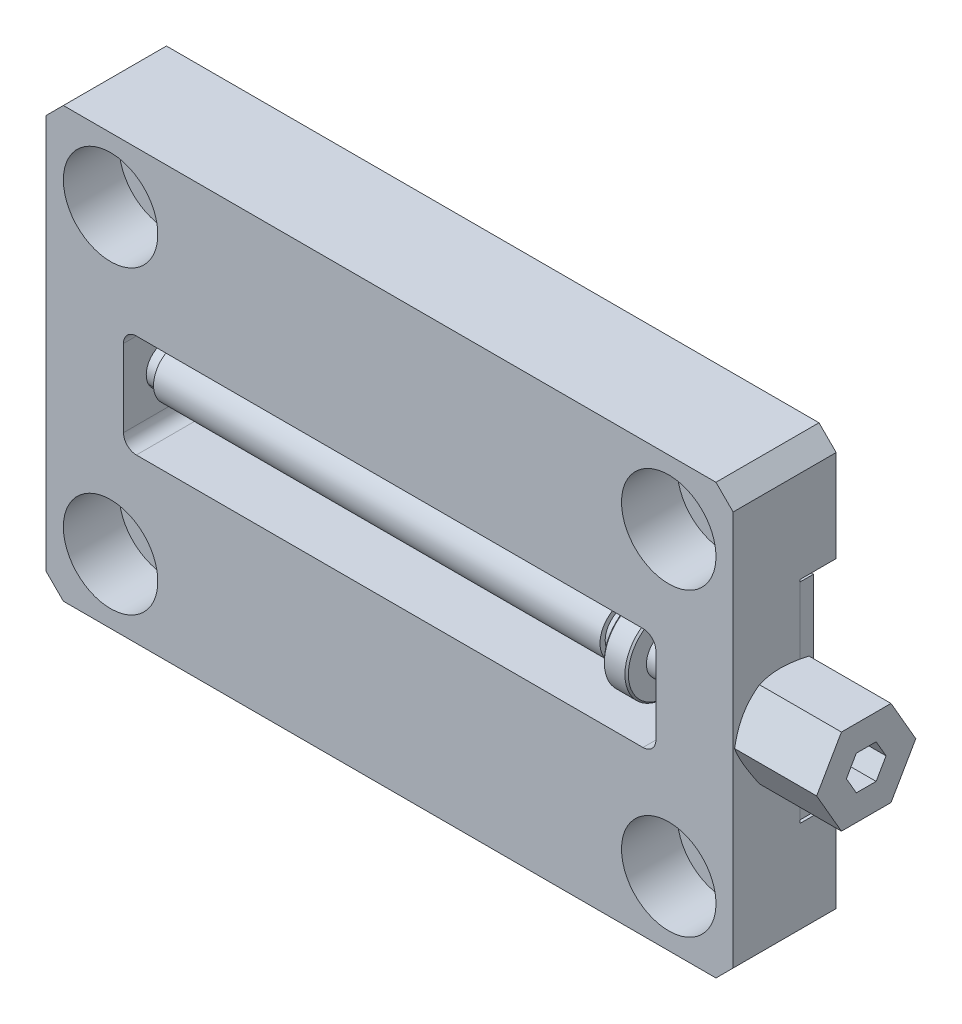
ISO-10303-21;
HEADER;
FILE_DESCRIPTION(('STEP AP214'),'2;1');
FILE_NAME('part.step','',(''),(''),'','','');
FILE_SCHEMA(('AUTOMOTIVE_DESIGN { 1 0 10303 214 1 1 1 1 }'));
ENDSEC;
DATA;
#1=APPLICATION_CONTEXT('core data for automotive mechanical design processes');
#2=APPLICATION_PROTOCOL_DEFINITION('international standard','automotive_design',2000,#1);
#3=PRODUCT_CONTEXT('',#1,'mechanical');
#4=PRODUCT('Part','Part','',(#3));
#5=PRODUCT_RELATED_PRODUCT_CATEGORY('part','',(#4));
#6=PRODUCT_DEFINITION_FORMATION('','',#4);
#7=PRODUCT_DEFINITION_CONTEXT('part definition',#1,'design');
#8=PRODUCT_DEFINITION('design','',#6,#7);
#9=PRODUCT_DEFINITION_SHAPE('','',#8);
#10=(LENGTH_UNIT() NAMED_UNIT(*) SI_UNIT(.MILLI.,.METRE.));
#11=(NAMED_UNIT(*) PLANE_ANGLE_UNIT() SI_UNIT($,.RADIAN.));
#12=(NAMED_UNIT(*) SI_UNIT($,.STERADIAN.) SOLID_ANGLE_UNIT());
#13=UNCERTAINTY_MEASURE_WITH_UNIT(LENGTH_MEASURE(1.E-05),#10,'distance_accuracy_value','');
#14=(GEOMETRIC_REPRESENTATION_CONTEXT(3) GLOBAL_UNCERTAINTY_ASSIGNED_CONTEXT((#13)) GLOBAL_UNIT_ASSIGNED_CONTEXT((#10,
#11,#12)) REPRESENTATION_CONTEXT('',''));
#15=CARTESIAN_POINT('',(0.,0.,0.));
#16=DIRECTION('',(0.,0.,1.));
#17=DIRECTION('',(1.,0.,0.));
#18=AXIS2_PLACEMENT_3D('',#15,#16,#17);
#19=CARTESIAN_POINT('',(46.5,0.,0.));
#20=DIRECTION('',(1.,0.,0.));
#21=DIRECTION('',(0.,0.,-1.));
#22=AXIS2_PLACEMENT_3D('',#19,#20,#21);
#23=PLANE('',#22);
#24=CARTESIAN_POINT('',(46.5,0.,0.));
#25=DIRECTION('',(-1.,0.,0.));
#26=DIRECTION('',(0.,-1.,0.));
#27=AXIS2_PLACEMENT_3D('',#24,#25,#26);
#28=CIRCLE('',#27,2.);
#29=CARTESIAN_POINT('',(46.5,1.,-1.73205080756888));
#30=VERTEX_POINT('',#29);
#31=CARTESIAN_POINT('',(46.5,-1.,-1.73205080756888));
#32=VERTEX_POINT('',#31);
#33=EDGE_CURVE('E22',#30,#32,#28,.T.);
#34=ORIENTED_EDGE('',*,*,#33,.T.);
#35=DIRECTION('',(0.,0.866025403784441,-0.499999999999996));
#36=VECTOR('',#35,1.);
#37=CARTESIAN_POINT('',(46.5,-1.,-1.73205080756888));
#38=LINE('',#37,#36);
#39=CARTESIAN_POINT('',(46.5,0.,-2.3094010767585));
#40=VERTEX_POINT('',#39);
#41=EDGE_CURVE('E281',#32,#40,#38,.T.);
#42=ORIENTED_EDGE('',*,*,#41,.T.);
#43=DIRECTION('',(0.,0.866025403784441,0.499999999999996));
#44=VECTOR('',#43,1.);
#45=CARTESIAN_POINT('',(46.5,0.,-2.3094010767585));
#46=LINE('',#45,#44);
#47=EDGE_CURVE('E270',#40,#30,#46,.T.);
#48=ORIENTED_EDGE('',*,*,#47,.T.);
#49=EDGE_LOOP('',(#34,#42,#48));
#50=FACE_BOUND('',#49,.T.);
#51=ADVANCED_FACE('F19',(#50),#23,.T.);
#52=CARTESIAN_POINT('',(46.5,0.,0.));
#53=DIRECTION('',(1.,0.,0.));
#54=DIRECTION('',(0.,0.,-1.));
#55=AXIS2_PLACEMENT_3D('',#52,#53,#54);
#56=PLANE('',#55);
#57=CARTESIAN_POINT('',(46.5,0.,0.));
#58=DIRECTION('',(-1.,0.,0.));
#59=DIRECTION('',(0.,-1.,0.));
#60=AXIS2_PLACEMENT_3D('',#57,#58,#59);
#61=CIRCLE('',#60,2.);
#62=CARTESIAN_POINT('',(46.5,-2.,0.));
#63=VERTEX_POINT('',#62);
#64=EDGE_CURVE('E360',#32,#63,#61,.T.);
#65=ORIENTED_EDGE('',*,*,#64,.T.);
#66=DIRECTION('',(0.,0.,-1.));
#67=VECTOR('',#66,1.);
#68=CARTESIAN_POINT('',(46.5,-2.,0.));
#69=LINE('',#68,#67);
#70=CARTESIAN_POINT('',(46.5,-2.,-1.15470053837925));
#71=VERTEX_POINT('',#70);
#72=EDGE_CURVE('E292',#63,#71,#69,.T.);
#73=ORIENTED_EDGE('',*,*,#72,.T.);
#74=DIRECTION('',(0.,0.866025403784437,-0.500000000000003));
#75=VECTOR('',#74,1.);
#76=CARTESIAN_POINT('',(46.5,-2.,-1.15470053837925));
#77=LINE('',#76,#75);
#78=EDGE_CURVE('E267',#71,#32,#77,.T.);
#79=ORIENTED_EDGE('',*,*,#78,.T.);
#80=EDGE_LOOP('',(#65,#73,#79));
#81=FACE_BOUND('',#80,.T.);
#82=ADVANCED_FACE('F358',(#81),#56,.T.);
#83=CARTESIAN_POINT('',(46.5,0.,0.));
#84=DIRECTION('',(1.,0.,0.));
#85=DIRECTION('',(0.,0.,-1.));
#86=AXIS2_PLACEMENT_3D('',#83,#84,#85);
#87=PLANE('',#86);
#88=CARTESIAN_POINT('',(46.5,0.,0.));
#89=DIRECTION('',(-1.,0.,0.));
#90=DIRECTION('',(0.,-1.,0.));
#91=AXIS2_PLACEMENT_3D('',#88,#89,#90);
#92=CIRCLE('',#91,2.);
#93=CARTESIAN_POINT('',(46.5,-1.,1.73205080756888));
#94=VERTEX_POINT('',#93);
#95=EDGE_CURVE('E1298',#63,#94,#92,.T.);
#96=ORIENTED_EDGE('',*,*,#95,.T.);
#97=DIRECTION('',(0.,-0.866025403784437,-0.500000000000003));
#98=VECTOR('',#97,1.);
#99=CARTESIAN_POINT('',(46.5,-1.,1.73205080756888));
#100=LINE('',#99,#98);
#101=CARTESIAN_POINT('',(46.5,-2.,1.15470053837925));
#102=VERTEX_POINT('',#101);
#103=EDGE_CURVE('E341',#94,#102,#100,.T.);
#104=ORIENTED_EDGE('',*,*,#103,.T.);
#105=DIRECTION('',(0.,0.,-1.));
#106=VECTOR('',#105,1.);
#107=CARTESIAN_POINT('',(46.5,-2.,0.));
#108=LINE('',#107,#106);
#109=EDGE_CURVE('E345',#102,#63,#108,.T.);
#110=ORIENTED_EDGE('',*,*,#109,.T.);
#111=EDGE_LOOP('',(#96,#104,#110));
#112=FACE_BOUND('',#111,.T.);
#113=ADVANCED_FACE('F1852',(#112),#87,.T.);
#114=CARTESIAN_POINT('',(46.5,0.,0.));
#115=DIRECTION('',(1.,0.,0.));
#116=DIRECTION('',(0.,0.,-1.));
#117=AXIS2_PLACEMENT_3D('',#114,#115,#116);
#118=PLANE('',#117);
#119=CARTESIAN_POINT('',(46.5,0.,0.));
#120=DIRECTION('',(-1.,0.,0.));
#121=DIRECTION('',(0.,-1.,0.));
#122=AXIS2_PLACEMENT_3D('',#119,#120,#121);
#123=CIRCLE('',#122,2.);
#124=CARTESIAN_POINT('',(46.5,1.,1.73205080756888));
#125=VERTEX_POINT('',#124);
#126=CARTESIAN_POINT('',(46.5,2.,0.));
#127=VERTEX_POINT('',#126);
#128=EDGE_CURVE('E1288',#125,#127,#123,.T.);
#129=ORIENTED_EDGE('',*,*,#128,.T.);
#130=DIRECTION('',(0.,0.,-1.));
#131=VECTOR('',#130,1.);
#132=CARTESIAN_POINT('',(46.5,2.,0.));
#133=LINE('',#132,#131);
#134=CARTESIAN_POINT('',(46.5,2.,1.15470053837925));
#135=VERTEX_POINT('',#134);
#136=EDGE_CURVE('E1279',#127,#135,#133,.F.);
#137=ORIENTED_EDGE('',*,*,#136,.T.);
#138=DIRECTION('',(0.,-0.866025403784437,0.500000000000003));
#139=VECTOR('',#138,1.);
#140=CARTESIAN_POINT('',(46.5,2.,1.15470053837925));
#141=LINE('',#140,#139);
#142=EDGE_CURVE('E339',#135,#125,#141,.T.);
#143=ORIENTED_EDGE('',*,*,#142,.T.);
#144=EDGE_LOOP('',(#129,#137,#143));
#145=FACE_BOUND('',#144,.T.);
#146=ADVANCED_FACE('F1287',(#145),#118,.T.);
#147=CARTESIAN_POINT('',(46.5,0.,0.));
#148=DIRECTION('',(1.,0.,0.));
#149=DIRECTION('',(0.,0.,-1.));
#150=AXIS2_PLACEMENT_3D('',#147,#148,#149);
#151=PLANE('',#150);
#152=CARTESIAN_POINT('',(46.5,0.,0.));
#153=DIRECTION('',(-1.,0.,0.));
#154=DIRECTION('',(0.,-1.,0.));
#155=AXIS2_PLACEMENT_3D('',#152,#153,#154);
#156=CIRCLE('',#155,2.);
#157=EDGE_CURVE('E1270',#127,#30,#156,.T.);
#158=ORIENTED_EDGE('',*,*,#157,.T.);
#159=DIRECTION('',(0.,0.866025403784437,0.500000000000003));
#160=VECTOR('',#159,1.);
#161=CARTESIAN_POINT('',(46.5,1.,-1.73205080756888));
#162=LINE('',#161,#160);
#163=CARTESIAN_POINT('',(46.5,2.,-1.15470053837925));
#164=VERTEX_POINT('',#163);
#165=EDGE_CURVE('E245',#30,#164,#162,.T.);
#166=ORIENTED_EDGE('',*,*,#165,.T.);
#167=DIRECTION('',(0.,0.,-1.));
#168=VECTOR('',#167,1.);
#169=CARTESIAN_POINT('',(46.5,2.,0.));
#170=LINE('',#169,#168);
#171=EDGE_CURVE('E1274',#164,#127,#170,.F.);
#172=ORIENTED_EDGE('',*,*,#171,.T.);
#173=EDGE_LOOP('',(#158,#166,#172));
#174=FACE_BOUND('',#173,.T.);
#175=ADVANCED_FACE('F1843',(#174),#151,.T.);
#176=CARTESIAN_POINT('',(44.5000000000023,0.,0.));
#177=DIRECTION('',(1.,0.,0.));
#178=DIRECTION('',(0.,0.,-1.));
#179=AXIS2_PLACEMENT_3D('',#176,#177,#178);
#180=CONICAL_SURFACE('',#179,1.99999999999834,1.0471975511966);
#181=CARTESIAN_POINT('',(43.345299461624,0.,0.));
#182=VERTEX_POINT('',#181);
#183=VERTEX_LOOP('',#182);
#184=FACE_BOUND('',#183,.T.);
#185=CARTESIAN_POINT('',(44.5,0.,0.));
#186=DIRECTION('',(-1.,0.,0.));
#187=DIRECTION('',(0.,-1.,0.));
#188=AXIS2_PLACEMENT_3D('',#185,#186,#187);
#189=CIRCLE('',#188,2.);
#190=CARTESIAN_POINT('',(44.5,-2.,0.));
#191=VERTEX_POINT('',#190);
#192=EDGE_CURVE('E1267',#191,#191,#189,.F.);
#193=ORIENTED_EDGE('',*,*,#192,.T.);
#194=EDGE_LOOP('',(#193));
#195=FACE_BOUND('',#194,.T.);
#196=ADVANCED_FACE('F1863',(#184,#195),#180,.F.);
#197=CARTESIAN_POINT('',(-34.,0.,0.));
#198=DIRECTION('',(1.,0.,0.));
#199=DIRECTION('',(0.,0.,-1.));
#200=AXIS2_PLACEMENT_3D('',#197,#198,#199);
#201=PLANE('',#200);
#202=CARTESIAN_POINT('',(-34.0000000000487,0.,0.));
#203=DIRECTION('',(1.,0.,0.));
#204=DIRECTION('',(0.,0.,-1.));
#205=AXIS2_PLACEMENT_3D('',#202,#203,#204);
#206=CIRCLE('',#205,1.96132486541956);
#207=CARTESIAN_POINT('',(-34.0000000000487,0.,-1.96132486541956));
#208=VERTEX_POINT('',#207);
#209=EDGE_CURVE('E326',#208,#208,#206,.T.);
#210=ORIENTED_EDGE('',*,*,#209,.F.);
#211=EDGE_LOOP('',(#210));
#212=FACE_BOUND('',#211,.T.);
#213=ADVANCED_FACE('F1866',(#212),#201,.F.);
#214=CARTESIAN_POINT('',(50.,0.,0.));
#215=DIRECTION('',(-1.,0.,0.));
#216=DIRECTION('',(0.,-1.,0.));
#217=AXIS2_PLACEMENT_3D('',#214,#215,#216);
#218=CYLINDRICAL_SURFACE('',#217,2.);
#219=ORIENTED_EDGE('',*,*,#192,.F.);
#220=EDGE_LOOP('',(#219));
#221=FACE_BOUND('',#220,.T.);
#222=ORIENTED_EDGE('',*,*,#128,.F.);
#223=CARTESIAN_POINT('',(46.5,0.,0.));
#224=DIRECTION('',(-1.,0.,0.));
#225=DIRECTION('',(0.,-1.,0.));
#226=AXIS2_PLACEMENT_3D('',#223,#224,#225);
#227=CIRCLE('',#226,2.);
#228=EDGE_CURVE('E320',#94,#125,#227,.T.);
#229=ORIENTED_EDGE('',*,*,#228,.F.);
#230=ORIENTED_EDGE('',*,*,#95,.F.);
#231=ORIENTED_EDGE('',*,*,#64,.F.);
#232=ORIENTED_EDGE('',*,*,#33,.F.);
#233=ORIENTED_EDGE('',*,*,#157,.F.);
#234=EDGE_LOOP('',(#222,#229,#230,#231,#232,#233));
#235=FACE_BOUND('',#234,.T.);
#236=ADVANCED_FACE('F1296',(#221,#235),#218,.F.);
#237=CARTESIAN_POINT('',(-33.5000000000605,0.,0.));
#238=DIRECTION('',(1.,0.,0.));
#239=DIRECTION('',(0.,0.,-1.));
#240=AXIS2_PLACEMENT_3D('',#237,#238,#239);
#241=CONICAL_SURFACE('',#240,2.25000000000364,0.523598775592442);
#242=ORIENTED_EDGE('',*,*,#209,.T.);
#243=EDGE_LOOP('',(#242));
#244=FACE_BOUND('',#243,.T.);
#245=CARTESIAN_POINT('',(-33.5,0.,0.));
#246=DIRECTION('',(-1.,0.,0.));
#247=DIRECTION('',(0.,0.,1.));
#248=AXIS2_PLACEMENT_3D('',#245,#246,#247);
#249=CIRCLE('',#248,2.25);
#250=CARTESIAN_POINT('',(-33.5,0.,2.25));
#251=VERTEX_POINT('',#250);
#252=EDGE_CURVE('E324',#251,#251,#249,.F.);
#253=ORIENTED_EDGE('',*,*,#252,.F.);
#254=EDGE_LOOP('',(#253));
#255=FACE_BOUND('',#254,.T.);
#256=ADVANCED_FACE('F1872',(#244,#255),#241,.T.);
#257=CARTESIAN_POINT('',(46.5,0.,0.));
#258=DIRECTION('',(1.,0.,0.));
#259=DIRECTION('',(0.,0.,-1.));
#260=AXIS2_PLACEMENT_3D('',#257,#258,#259);
#261=PLANE('',#260);
#262=ORIENTED_EDGE('',*,*,#228,.T.);
#263=DIRECTION('',(0.,-0.866025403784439,0.5));
#264=VECTOR('',#263,1.);
#265=CARTESIAN_POINT('',(46.5,2.,1.15470053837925));
#266=LINE('',#265,#264);
#267=CARTESIAN_POINT('',(46.5,0.,2.3094010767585));
#268=VERTEX_POINT('',#267);
#269=EDGE_CURVE('E1252',#125,#268,#266,.T.);
#270=ORIENTED_EDGE('',*,*,#269,.T.);
#271=DIRECTION('',(0.,-0.866025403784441,-0.499999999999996));
#272=VECTOR('',#271,1.);
#273=CARTESIAN_POINT('',(46.5,0.,2.3094010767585));
#274=LINE('',#273,#272);
#275=EDGE_CURVE('E325',#268,#94,#274,.T.);
#276=ORIENTED_EDGE('',*,*,#275,.T.);
#277=EDGE_LOOP('',(#262,#270,#276));
#278=FACE_BOUND('',#277,.T.);
#279=ADVANCED_FACE('F1301',(#278),#261,.T.);
#280=CARTESIAN_POINT('',(50.5,0.,0.));
#281=DIRECTION('',(-1.,0.,0.));
#282=DIRECTION('',(0.,0.,1.));
#283=AXIS2_PLACEMENT_3D('',#280,#281,#282);
#284=CYLINDRICAL_SURFACE('',#283,2.25);
#285=ORIENTED_EDGE('',*,*,#252,.T.);
#286=EDGE_LOOP('',(#285));
#287=FACE_BOUND('',#286,.T.);
#288=CARTESIAN_POINT('',(-29.5,0.,0.));
#289=DIRECTION('',(-1.,0.,0.));
#290=DIRECTION('',(0.,0.,1.));
#291=AXIS2_PLACEMENT_3D('',#288,#289,#290);
#292=CIRCLE('',#291,2.25);
#293=CARTESIAN_POINT('',(-29.5,0.,2.25));
#294=VERTEX_POINT('',#293);
#295=EDGE_CURVE('E312',#294,#294,#292,.T.);
#296=ORIENTED_EDGE('',*,*,#295,.T.);
#297=EDGE_LOOP('',(#296));
#298=FACE_BOUND('',#297,.T.);
#299=ADVANCED_FACE('F1879',(#287,#298),#284,.T.);
#300=CARTESIAN_POINT('',(46.5,2.,1.15470053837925));
#301=DIRECTION('',(0.,0.5,0.866025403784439));
#302=DIRECTION('',(0.,-0.866025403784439,0.5));
#303=AXIS2_PLACEMENT_3D('',#300,#301,#302);
#304=PLANE('',#303);
#305=ORIENTED_EDGE('',*,*,#142,.F.);
#306=DIRECTION('',(1.,0.,0.));
#307=VECTOR('',#306,1.);
#308=CARTESIAN_POINT('',(46.5,2.,1.15470053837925));
#309=LINE('',#308,#307);
#310=CARTESIAN_POINT('',(50.5,2.,1.15470053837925));
#311=VERTEX_POINT('',#310);
#312=EDGE_CURVE('E287',#135,#311,#309,.T.);
#313=ORIENTED_EDGE('',*,*,#312,.T.);
#314=DIRECTION('',(0.,-0.866025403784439,0.499999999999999));
#315=VECTOR('',#314,1.);
#316=CARTESIAN_POINT('',(50.5,2.,1.15470053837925));
#317=LINE('',#316,#315);
#318=CARTESIAN_POINT('',(50.5,0.,2.3094010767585));
#319=VERTEX_POINT('',#318);
#320=EDGE_CURVE('E317',#311,#319,#317,.T.);
#321=ORIENTED_EDGE('',*,*,#320,.T.);
#322=DIRECTION('',(1.,0.,0.));
#323=VECTOR('',#322,1.);
#324=CARTESIAN_POINT('',(46.5,0.,2.3094010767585));
#325=LINE('',#324,#323);
#326=EDGE_CURVE('E371',#319,#268,#325,.F.);
#327=ORIENTED_EDGE('',*,*,#326,.T.);
#328=ORIENTED_EDGE('',*,*,#269,.F.);
#329=EDGE_LOOP('',(#305,#313,#321,#327,#328));
#330=FACE_BOUND('',#329,.T.);
#331=ADVANCED_FACE('F1303',(#330),#304,.F.);
#332=CARTESIAN_POINT('',(46.5,0.,2.3094010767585));
#333=DIRECTION('',(0.,-0.5,0.866025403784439));
#334=DIRECTION('',(0.,-0.866025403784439,-0.5));
#335=AXIS2_PLACEMENT_3D('',#332,#333,#334);
#336=PLANE('',#335);
#337=ORIENTED_EDGE('',*,*,#275,.F.);
#338=ORIENTED_EDGE('',*,*,#326,.F.);
#339=DIRECTION('',(0.,-0.866025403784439,-0.5));
#340=VECTOR('',#339,1.);
#341=CARTESIAN_POINT('',(50.5,0.,2.3094010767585));
#342=LINE('',#341,#340);
#343=CARTESIAN_POINT('',(50.5,-2.,1.15470053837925));
#344=VERTEX_POINT('',#343);
#345=EDGE_CURVE('E1228',#319,#344,#342,.T.);
#346=ORIENTED_EDGE('',*,*,#345,.T.);
#347=DIRECTION('',(1.,0.,0.));
#348=VECTOR('',#347,1.);
#349=CARTESIAN_POINT('',(46.5,-2.,1.15470053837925));
#350=LINE('',#349,#348);
#351=EDGE_CURVE('E369',#344,#102,#350,.F.);
#352=ORIENTED_EDGE('',*,*,#351,.T.);
#353=ORIENTED_EDGE('',*,*,#103,.F.);
#354=EDGE_LOOP('',(#337,#338,#346,#352,#353));
#355=FACE_BOUND('',#354,.T.);
#356=ADVANCED_FACE('F1310',(#355),#336,.F.);
#357=CARTESIAN_POINT('',(46.5,-2.,1.15470053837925));
#358=DIRECTION('',(0.,-1.,0.));
#359=DIRECTION('',(0.,0.,-1.));
#360=AXIS2_PLACEMENT_3D('',#357,#358,#359);
#361=PLANE('',#360);
#362=ORIENTED_EDGE('',*,*,#109,.F.);
#363=ORIENTED_EDGE('',*,*,#351,.F.);
#364=DIRECTION('',(0.,0.,1.));
#365=VECTOR('',#364,1.);
#366=CARTESIAN_POINT('',(50.5,-2.,0.));
#367=LINE('',#366,#365);
#368=CARTESIAN_POINT('',(50.5,-2.,-1.15470053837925));
#369=VERTEX_POINT('',#368);
#370=EDGE_CURVE('E368',#344,#369,#367,.F.);
#371=ORIENTED_EDGE('',*,*,#370,.T.);
#372=DIRECTION('',(1.,0.,0.));
#373=VECTOR('',#372,1.);
#374=CARTESIAN_POINT('',(46.5,-2.,-1.15470053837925));
#375=LINE('',#374,#373);
#376=EDGE_CURVE('E288',#369,#71,#375,.F.);
#377=ORIENTED_EDGE('',*,*,#376,.T.);
#378=ORIENTED_EDGE('',*,*,#72,.F.);
#379=EDGE_LOOP('',(#362,#363,#371,#377,#378));
#380=FACE_BOUND('',#379,.T.);
#381=ADVANCED_FACE('F362',(#380),#361,.F.);
#382=CARTESIAN_POINT('',(46.5,-2.,-1.15470053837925));
#383=DIRECTION('',(0.,-0.5,-0.866025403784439));
#384=DIRECTION('',(0.,0.866025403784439,-0.5));
#385=AXIS2_PLACEMENT_3D('',#382,#383,#384);
#386=PLANE('',#385);
#387=ORIENTED_EDGE('',*,*,#78,.F.);
#388=ORIENTED_EDGE('',*,*,#376,.F.);
#389=DIRECTION('',(0.,0.866025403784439,-0.499999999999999));
#390=VECTOR('',#389,1.);
#391=CARTESIAN_POINT('',(50.5,-2.,-1.15470053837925));
#392=LINE('',#391,#390);
#393=CARTESIAN_POINT('',(50.5,0.,-2.3094010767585));
#394=VERTEX_POINT('',#393);
#395=EDGE_CURVE('E286',#369,#394,#392,.T.);
#396=ORIENTED_EDGE('',*,*,#395,.T.);
#397=DIRECTION('',(1.,0.,0.));
#398=VECTOR('',#397,1.);
#399=CARTESIAN_POINT('',(46.5,0.,-2.3094010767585));
#400=LINE('',#399,#398);
#401=EDGE_CURVE('E275',#394,#40,#400,.F.);
#402=ORIENTED_EDGE('',*,*,#401,.T.);
#403=ORIENTED_EDGE('',*,*,#41,.F.);
#404=EDGE_LOOP('',(#387,#388,#396,#402,#403));
#405=FACE_BOUND('',#404,.T.);
#406=ADVANCED_FACE('F284',(#405),#386,.F.);
#407=CARTESIAN_POINT('',(46.5,0.,-2.3094010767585));
#408=DIRECTION('',(0.,0.5,-0.866025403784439));
#409=DIRECTION('',(0.,0.866025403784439,0.5));
#410=AXIS2_PLACEMENT_3D('',#407,#408,#409);
#411=PLANE('',#410);
#412=ORIENTED_EDGE('',*,*,#47,.F.);
#413=ORIENTED_EDGE('',*,*,#401,.F.);
#414=DIRECTION('',(0.,0.866025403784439,0.499999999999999));
#415=VECTOR('',#414,1.);
#416=CARTESIAN_POINT('',(50.5,0.,-2.3094010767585));
#417=LINE('',#416,#415);
#418=CARTESIAN_POINT('',(50.5,2.,-1.15470053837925));
#419=VERTEX_POINT('',#418);
#420=EDGE_CURVE('E1223',#394,#419,#417,.T.);
#421=ORIENTED_EDGE('',*,*,#420,.T.);
#422=DIRECTION('',(1.,0.,0.));
#423=VECTOR('',#422,1.);
#424=CARTESIAN_POINT('',(46.5,2.,-1.15470053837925));
#425=LINE('',#424,#423);
#426=EDGE_CURVE('E301',#419,#164,#425,.F.);
#427=ORIENTED_EDGE('',*,*,#426,.T.);
#428=ORIENTED_EDGE('',*,*,#165,.F.);
#429=EDGE_LOOP('',(#412,#413,#421,#427,#428));
#430=FACE_BOUND('',#429,.T.);
#431=ADVANCED_FACE('F272',(#430),#411,.F.);
#432=CARTESIAN_POINT('',(46.5,2.,-1.15470053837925));
#433=DIRECTION('',(0.,1.,0.));
#434=DIRECTION('',(0.,0.,1.));
#435=AXIS2_PLACEMENT_3D('',#432,#433,#434);
#436=PLANE('',#435);
#437=ORIENTED_EDGE('',*,*,#171,.F.);
#438=ORIENTED_EDGE('',*,*,#426,.F.);
#439=DIRECTION('',(0.,0.,1.));
#440=VECTOR('',#439,1.);
#441=CARTESIAN_POINT('',(50.5,2.,0.));
#442=LINE('',#441,#440);
#443=EDGE_CURVE('E1221',#419,#311,#442,.T.);
#444=ORIENTED_EDGE('',*,*,#443,.T.);
#445=ORIENTED_EDGE('',*,*,#312,.F.);
#446=ORIENTED_EDGE('',*,*,#136,.F.);
#447=EDGE_LOOP('',(#437,#438,#444,#445,#446));
#448=FACE_BOUND('',#447,.T.);
#449=ADVANCED_FACE('F1837',(#448),#436,.F.);
#450=CARTESIAN_POINT('',(-29.5,2.25,0.));
#451=DIRECTION('',(1.,0.,0.));
#452=DIRECTION('',(0.,0.,-1.));
#453=AXIS2_PLACEMENT_3D('',#450,#451,#452);
#454=PLANE('',#453);
#455=ORIENTED_EDGE('',*,*,#295,.F.);
#456=EDGE_LOOP('',(#455));
#457=FACE_BOUND('',#456,.T.);
#458=CARTESIAN_POINT('',(-29.5,0.,0.));
#459=DIRECTION('',(-1.,0.,0.));
#460=DIRECTION('',(0.,0.,1.));
#461=AXIS2_PLACEMENT_3D('',#458,#459,#460);
#462=CIRCLE('',#461,3.);
#463=CARTESIAN_POINT('',(-29.5,0.,3.));
#464=VERTEX_POINT('',#463);
#465=EDGE_CURVE('E318',#464,#464,#462,.F.);
#466=ORIENTED_EDGE('',*,*,#465,.F.);
#467=EDGE_LOOP('',(#466));
#468=FACE_BOUND('',#467,.T.);
#469=ADVANCED_FACE('F1895',(#457,#468),#454,.F.);
#470=CARTESIAN_POINT('',(50.5,10.,0.));
#471=DIRECTION('',(-1.,0.,0.));
#472=DIRECTION('',(0.,0.,1.));
#473=AXIS2_PLACEMENT_3D('',#470,#471,#472);
#474=PLANE('',#473);
#475=DIRECTION('',(0.,0.,1.));
#476=VECTOR('',#475,1.);
#477=CARTESIAN_POINT('',(50.5,5.,-2.88675134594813));
#478=LINE('',#477,#476);
#479=CARTESIAN_POINT('',(50.5,5.,2.88675134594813));
#480=VERTEX_POINT('',#479);
#481=CARTESIAN_POINT('',(50.5,5.,-2.88675134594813));
#482=VERTEX_POINT('',#481);
#483=EDGE_CURVE('E1183',#480,#482,#478,.F.);
#484=ORIENTED_EDGE('',*,*,#483,.F.);
#485=DIRECTION('',(0.,-0.866025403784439,0.5));
#486=VECTOR('',#485,1.);
#487=CARTESIAN_POINT('',(50.5,5.,2.88675134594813));
#488=LINE('',#487,#486);
#489=CARTESIAN_POINT('',(50.5,0.,5.77350269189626));
#490=VERTEX_POINT('',#489);
#491=EDGE_CURVE('E1188',#490,#480,#488,.F.);
#492=ORIENTED_EDGE('',*,*,#491,.F.);
#493=DIRECTION('',(0.,-0.866025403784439,-0.5));
#494=VECTOR('',#493,1.);
#495=CARTESIAN_POINT('',(50.5,0.,5.77350269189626));
#496=LINE('',#495,#494);
#497=CARTESIAN_POINT('',(50.5,-5.,2.88675134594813));
#498=VERTEX_POINT('',#497);
#499=EDGE_CURVE('E1237',#498,#490,#496,.F.);
#500=ORIENTED_EDGE('',*,*,#499,.F.);
#501=DIRECTION('',(0.,0.,-1.));
#502=VECTOR('',#501,1.);
#503=CARTESIAN_POINT('',(50.5,-5.,2.88675134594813));
#504=LINE('',#503,#502);
#505=CARTESIAN_POINT('',(50.5,-5.,-2.88675134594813));
#506=VERTEX_POINT('',#505);
#507=EDGE_CURVE('E1210',#506,#498,#504,.F.);
#508=ORIENTED_EDGE('',*,*,#507,.F.);
#509=DIRECTION('',(0.,0.866025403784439,-0.5));
#510=VECTOR('',#509,1.);
#511=CARTESIAN_POINT('',(50.5,-5.,-2.88675134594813));
#512=LINE('',#511,#510);
#513=CARTESIAN_POINT('',(50.5,0.,-5.77350269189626));
#514=VERTEX_POINT('',#513);
#515=EDGE_CURVE('E1204',#514,#506,#512,.F.);
#516=ORIENTED_EDGE('',*,*,#515,.F.);
#517=DIRECTION('',(0.,0.866025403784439,0.5));
#518=VECTOR('',#517,1.);
#519=CARTESIAN_POINT('',(50.5,0.,-5.77350269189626));
#520=LINE('',#519,#518);
#521=EDGE_CURVE('E1198',#482,#514,#520,.F.);
#522=ORIENTED_EDGE('',*,*,#521,.F.);
#523=EDGE_LOOP('',(#484,#492,#500,#508,#516,#522));
#524=FACE_BOUND('',#523,.T.);
#525=ORIENTED_EDGE('',*,*,#420,.F.);
#526=ORIENTED_EDGE('',*,*,#395,.F.);
#527=ORIENTED_EDGE('',*,*,#370,.F.);
#528=ORIENTED_EDGE('',*,*,#345,.F.);
#529=ORIENTED_EDGE('',*,*,#320,.F.);
#530=ORIENTED_EDGE('',*,*,#443,.F.);
#531=EDGE_LOOP('',(#525,#526,#527,#528,#529,#530));
#532=FACE_BOUND('',#531,.T.);
#533=ADVANCED_FACE('F1314',(#524,#532),#474,.F.);
#534=CARTESIAN_POINT('',(50.5,0.,0.));
#535=DIRECTION('',(-1.,0.,0.));
#536=DIRECTION('',(0.,0.,1.));
#537=AXIS2_PLACEMENT_3D('',#534,#535,#536);
#538=CYLINDRICAL_SURFACE('',#537,3.);
#539=ORIENTED_EDGE('',*,*,#465,.T.);
#540=EDGE_LOOP('',(#539));
#541=FACE_BOUND('',#540,.T.);
#542=CARTESIAN_POINT('',(22.5,0.,0.));
#543=DIRECTION('',(-1.,0.,0.));
#544=DIRECTION('',(0.,0.,1.));
#545=AXIS2_PLACEMENT_3D('',#542,#543,#544);
#546=CIRCLE('',#545,3.);
#547=CARTESIAN_POINT('',(22.5,0.,3.));
#548=VERTEX_POINT('',#547);
#549=EDGE_CURVE('E782',#548,#548,#546,.T.);
#550=ORIENTED_EDGE('',*,*,#549,.T.);
#551=EDGE_LOOP('',(#550));
#552=FACE_BOUND('',#551,.T.);
#553=ADVANCED_FACE('F1900',(#541,#552),#538,.T.);
#554=CARTESIAN_POINT('',(40.5,0.,5.77350269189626));
#555=DIRECTION('',(0.,-0.5,0.866025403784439));
#556=DIRECTION('',(0.,-0.866025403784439,-0.5));
#557=AXIS2_PLACEMENT_3D('',#554,#555,#556);
#558=PLANE('',#557);
#559=ORIENTED_EDGE('',*,*,#499,.T.);
#560=DIRECTION('',(1.,0.,0.));
#561=VECTOR('',#560,1.);
#562=CARTESIAN_POINT('',(40.5,0.,5.77350269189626));
#563=LINE('',#562,#561);
#564=CARTESIAN_POINT('',(40.9465819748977,3.75180080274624E-08,5.77350267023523));
#565=VERTEX_POINT('',#564);
#566=EDGE_CURVE('E1191',#565,#490,#563,.T.);
#567=ORIENTED_EDGE('',*,*,#566,.F.);
#568=CARTESIAN_POINT('',(40.5000000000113,-2.5,4.3301270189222));
#569=CARTESIAN_POINT('',(40.4999795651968,-2.39388902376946,4.39139021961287));
#570=CARTESIAN_POINT('',(40.5025997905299,-2.2877831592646,4.45265046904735));
#571=CARTESIAN_POINT('',(40.5129696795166,-2.07577977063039,4.57505068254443));
#572=CARTESIAN_POINT('',(40.5207183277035,-1.969882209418,4.63619066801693));
#573=CARTESIAN_POINT('',(40.5411421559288,-1.75897944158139,4.75795543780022));
#574=CARTESIAN_POINT('',(40.5537925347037,-1.65397241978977,4.81858127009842));
#575=CARTESIAN_POINT('',(40.5837477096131,-1.44445866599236,4.93954409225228));
#576=CARTESIAN_POINT('',(40.6010526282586,-1.33995194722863,4.99988107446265));
#577=CARTESIAN_POINT('',(40.659414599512,-1.02761543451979,5.18020864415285));
#578=CARTESIAN_POINT('',(40.7069472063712,-0.820692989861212,5.29967537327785));
#579=CARTESIAN_POINT('',(40.8165695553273,-0.408627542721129,5.53758147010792));
#580=CARTESIAN_POINT('',(40.8787319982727,-0.203498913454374,5.65601253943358));
#581=CARTESIAN_POINT('',(40.9465819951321,2.31850180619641E-08,5.77350270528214));
#582=B_SPLINE_CURVE_WITH_KNOTS('',3,(#568,#569,#570,#571,#572,#573,#574,#575,#576,#577,#578,
#579,#580,#581),.UNSPECIFIED.,.F.,.F.,(4,2,2,2,2,2,4),(0.,0.367541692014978,0.735010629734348,
1.10064406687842,1.46628712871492,2.19661490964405,2.93065157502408),.UNSPECIFIED.);
#583=CARTESIAN_POINT('',(40.50000000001,-2.49999999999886,4.33012701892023));
#584=VERTEX_POINT('',#583);
#585=EDGE_CURVE('E770',#584,#565,#582,.T.);
#586=ORIENTED_EDGE('',*,*,#585,.F.);
#587=CARTESIAN_POINT('',(40.9465819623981,-4.99999992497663,2.88675138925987));
#588=CARTESIAN_POINT('',(40.8787319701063,-4.79650099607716,3.00424155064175));
#589=CARTESIAN_POINT('',(40.8165695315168,-4.5913723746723,3.12267261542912));
#590=CARTESIAN_POINT('',(40.7069471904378,-4.17930694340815,3.36057870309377));
#591=CARTESIAN_POINT('',(40.6594145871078,-3.97238450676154,3.48004542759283));
#592=CARTESIAN_POINT('',(40.60105262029,-3.66004800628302,3.66037299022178));
#593=CARTESIAN_POINT('',(40.5837477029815,-3.55554129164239,3.72070997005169));
#594=CARTESIAN_POINT('',(40.5537925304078,-3.34602754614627,3.84167278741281));
#595=CARTESIAN_POINT('',(40.5411421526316,-3.24102052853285,3.90229861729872));
#596=CARTESIAN_POINT('',(40.5207183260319,-3.0301177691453,4.02406338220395));
#597=CARTESIAN_POINT('',(40.5129696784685,-2.92422021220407,4.0852033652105));
#598=CARTESIAN_POINT('',(40.5025997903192,-2.71221683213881,4.20760357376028));
#599=CARTESIAN_POINT('',(40.4999795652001,-2.60611097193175,4.26886382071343));
#600=CARTESIAN_POINT('',(40.5000000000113,-2.5,4.33012701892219));
#601=B_SPLINE_CURVE_WITH_KNOTS('',3,(#587,#588,#589,#590,#591,#592,#593,#594,#595,#596,#597,
#598,#599,#600),.UNSPECIFIED.,.F.,.F.,(4,2,2,2,2,2,4),(0.,0.734036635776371,1.46436438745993,
1.83000743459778,2.19564085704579,2.56310977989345,2.93065145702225),.UNSPECIFIED.);
#602=CARTESIAN_POINT('',(40.9465819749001,-4.99999996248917,2.88675136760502));
#603=VERTEX_POINT('',#602);
#604=EDGE_CURVE('E754',#603,#584,#601,.T.);
#605=ORIENTED_EDGE('',*,*,#604,.F.);
#606=DIRECTION('',(1.,0.,0.));
#607=VECTOR('',#606,1.);
#608=CARTESIAN_POINT('',(40.5,-5.,2.88675134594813));
#609=LINE('',#608,#607);
#610=EDGE_CURVE('E1207',#498,#603,#609,.F.);
#611=ORIENTED_EDGE('',*,*,#610,.F.);
#612=EDGE_LOOP('',(#559,#567,#586,#605,#611));
#613=FACE_BOUND('',#612,.T.);
#614=ADVANCED_FACE('F736',(#613),#558,.T.);
#615=CARTESIAN_POINT('',(40.5,-5.,2.88675134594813));
#616=DIRECTION('',(0.,-1.,0.));
#617=DIRECTION('',(0.,0.,-1.));
#618=AXIS2_PLACEMENT_3D('',#615,#616,#617);
#619=PLANE('',#618);
#620=ORIENTED_EDGE('',*,*,#507,.T.);
#621=ORIENTED_EDGE('',*,*,#610,.T.);
#622=CARTESIAN_POINT('',(40.5000000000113,-5.,0.));
#623=CARTESIAN_POINT('',(40.4999795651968,-5.,0.122526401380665));
#624=CARTESIAN_POINT('',(40.5025997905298,-5.,0.245046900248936));
#625=CARTESIAN_POINT('',(40.5129696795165,-5.,0.48984732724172));
#626=CARTESIAN_POINT('',(40.5207183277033,-5.,0.61212729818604));
#627=CARTESIAN_POINT('',(40.5411421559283,-5.,0.85565683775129));
#628=CARTESIAN_POINT('',(40.5537925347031,-5.,0.976908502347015));
#629=CARTESIAN_POINT('',(40.5837477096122,-5.,1.21883414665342));
#630=CARTESIAN_POINT('',(40.6010526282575,-5.,1.33950811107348));
#631=CARTESIAN_POINT('',(40.6594145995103,-5.,1.70016325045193));
#632=CARTESIAN_POINT('',(40.706947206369,-5.,1.93909670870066));
#633=CARTESIAN_POINT('',(40.816569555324,-5.,2.41490890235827));
#634=CARTESIAN_POINT('',(40.8787319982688,-5.,2.65177104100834));
#635=CARTESIAN_POINT('',(40.9465819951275,-5.,2.88675137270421));
#636=B_SPLINE_CURVE_WITH_KNOTS('',3,(#622,#623,#624,#625,#626,#627,#628,#629,#630,#631,#632,
#633,#634,#635),.UNSPECIFIED.,.F.,.F.,(4,2,2,2,2,2,4),(0.,0.367541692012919,0.735010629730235,
1.10064406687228,1.46628712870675,2.19661490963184,2.93065157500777),.UNSPECIFIED.);
#637=CARTESIAN_POINT('',(40.50000000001,-4.99999999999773,0.));
#638=VERTEX_POINT('',#637);
#639=EDGE_CURVE('E747',#638,#603,#636,.T.);
#640=ORIENTED_EDGE('',*,*,#639,.F.);
#641=CARTESIAN_POINT('',(40.9465819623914,-4.99999999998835,-2.88675125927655));
#642=CARTESIAN_POINT('',(40.8787319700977,-4.99999999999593,-2.65177093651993));
#643=CARTESIAN_POINT('',(40.8165695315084,-4.99999999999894,-2.41490880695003));
#644=CARTESIAN_POINT('',(40.7069471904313,-5.00000000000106,-1.93909663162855));
#645=CARTESIAN_POINT('',(40.659414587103,-5.00000000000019,-1.70016318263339));
#646=CARTESIAN_POINT('',(40.6010526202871,-4.9999999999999,-1.33950805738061));
#647=CARTESIAN_POINT('',(40.583747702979,-4.99999999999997,-1.21883409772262));
#648=CARTESIAN_POINT('',(40.5537925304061,-5.00000000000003,-0.976908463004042));
#649=CARTESIAN_POINT('',(40.5411421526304,-5.00000000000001,-0.855656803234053));
#650=CARTESIAN_POINT('',(40.5207183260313,-4.99999999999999,-0.612127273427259));
#651=CARTESIAN_POINT('',(40.5129696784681,-5.,-0.489847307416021));
#652=CARTESIAN_POINT('',(40.5025997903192,-5.,-0.245046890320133));
#653=CARTESIAN_POINT('',(40.4999795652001,-5.00000000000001,-0.122526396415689));
#654=CARTESIAN_POINT('',(40.5000000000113,-5.,0.));
#655=B_SPLINE_CURVE_WITH_KNOTS('',3,(#641,#642,#643,#644,#645,#646,#647,#648,#649,#650,#651,
#652,#653,#654),.UNSPECIFIED.,.F.,.F.,(4,2,2,2,2,2,4),(0.,0.734036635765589,1.46436438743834,
1.83000743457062,2.19564085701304,2.56310977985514,2.93065145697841),.UNSPECIFIED.);
#656=CARTESIAN_POINT('',(40.9465819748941,-5.,-2.88675130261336));
#657=VERTEX_POINT('',#656);
#658=EDGE_CURVE('E741',#657,#638,#655,.T.);
#659=ORIENTED_EDGE('',*,*,#658,.F.);
#660=DIRECTION('',(1.,0.,0.));
#661=VECTOR('',#660,1.);
#662=CARTESIAN_POINT('',(40.5,-5.,-2.88675134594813));
#663=LINE('',#662,#661);
#664=EDGE_CURVE('E1201',#506,#657,#663,.F.);
#665=ORIENTED_EDGE('',*,*,#664,.F.);
#666=EDGE_LOOP('',(#620,#621,#640,#659,#665));
#667=FACE_BOUND('',#666,.T.);
#668=ADVANCED_FACE('F730',(#667),#619,.T.);
#669=CARTESIAN_POINT('',(40.5,-5.,-2.88675134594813));
#670=DIRECTION('',(0.,-0.5,-0.866025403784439));
#671=DIRECTION('',(0.,0.866025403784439,-0.5));
#672=AXIS2_PLACEMENT_3D('',#669,#670,#671);
#673=PLANE('',#672);
#674=ORIENTED_EDGE('',*,*,#515,.T.);
#675=ORIENTED_EDGE('',*,*,#664,.T.);
#676=CARTESIAN_POINT('',(40.5000000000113,-2.5,-4.33012701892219));
#677=CARTESIAN_POINT('',(40.4999795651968,-2.60611097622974,-4.26886381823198));
#678=CARTESIAN_POINT('',(40.5025997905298,-2.7122168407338,-4.20760356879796));
#679=CARTESIAN_POINT('',(40.5129696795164,-2.92422022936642,-4.0852033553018));
#680=CARTESIAN_POINT('',(40.5207183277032,-3.03011779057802,-4.02406336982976));
#681=CARTESIAN_POINT('',(40.5411421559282,-3.24102055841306,-3.90229860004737));
#682=CARTESIAN_POINT('',(40.5537925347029,-3.34602758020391,-3.84167276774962));
#683=CARTESIAN_POINT('',(40.5837477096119,-3.55554133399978,-3.72070994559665));
#684=CARTESIAN_POINT('',(40.6010526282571,-3.66004805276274,-3.66037296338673));
#685=CARTESIAN_POINT('',(40.6594145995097,-3.97238456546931,-3.48004539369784));
#686=CARTESIAN_POINT('',(40.7069472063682,-4.1793070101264,-3.36057866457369));
#687=CARTESIAN_POINT('',(40.8165695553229,-4.59137245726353,-3.12267256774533));
#688=CARTESIAN_POINT('',(40.8787319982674,-4.79650108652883,-3.00424149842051));
#689=CARTESIAN_POINT('',(40.946581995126,-5.00000002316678,-2.88675133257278));
#690=B_SPLINE_CURVE_WITH_KNOTS('',3,(#676,#677,#678,#679,#680,#681,#682,#683,#684,#685,#686,
#687,#688,#689),.UNSPECIFIED.,.F.,.F.,(4,2,2,2,2,2,4),(0.,0.367541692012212,0.73501062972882,
1.10064406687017,1.46628712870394,2.19661490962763,2.93065157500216),.UNSPECIFIED.);
#691=CARTESIAN_POINT('',(40.50000000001,-2.49999999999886,-4.33012701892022));
#692=VERTEX_POINT('',#691);
#693=EDGE_CURVE('E715',#692,#657,#690,.T.);
#694=ORIENTED_EDGE('',*,*,#693,.F.);
#695=CARTESIAN_POINT('',(40.9465819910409,-1.65477486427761E-08,-5.77350266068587));
#696=CARTESIAN_POINT('',(40.8787319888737,-0.20349895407,-5.6560125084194));
#697=CARTESIAN_POINT('',(40.8165695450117,-0.40862758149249,-5.53758144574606));
#698=CARTESIAN_POINT('',(40.7069471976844,-0.820693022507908,-5.29967535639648));
#699=CARTESIAN_POINT('',(40.6594145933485,-1.02761546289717,-5.18020862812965));
#700=CARTESIAN_POINT('',(40.6010526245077,-1.3399519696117,-4.99988106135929));
#701=CARTESIAN_POINT('',(40.583747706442,-1.4444586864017,-4.93954408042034));
#702=CARTESIAN_POINT('',(40.5537925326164,-1.65397243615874,-4.81858126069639));
#703=CARTESIAN_POINT('',(40.5411421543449,-1.75897945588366,-4.75795542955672));
#704=CARTESIAN_POINT('',(40.520718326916,-1.96988221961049,-4.6361906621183));
#705=CARTESIAN_POINT('',(40.5129696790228,-2.07577977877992,-4.5750506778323));
#706=CARTESIAN_POINT('',(40.5025997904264,-2.28778316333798,-4.45265046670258));
#707=CARTESIAN_POINT('',(40.499979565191,-2.39388902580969,-4.39139021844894));
#708=CARTESIAN_POINT('',(40.5000000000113,-2.5,-4.33012701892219));
#709=B_SPLINE_CURVE_WITH_KNOTS('',3,(#695,#696,#697,#698,#699,#700,#701,#702,#703,#704,#705,
#706,#707,#708),.UNSPECIFIED.,.F.,.F.,(4,2,2,2,2,2,4),(0.,0.734036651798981,1.46436441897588,
1.83000747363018,2.19564090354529,2.56310983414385,2.93065151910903),.UNSPECIFIED.);
#710=CARTESIAN_POINT('',(40.9465819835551,-1.15458467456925E-08,-5.77350268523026));
#711=VERTEX_POINT('',#710);
#712=EDGE_CURVE('E680',#711,#692,#709,.T.);
#713=ORIENTED_EDGE('',*,*,#712,.F.);
#714=DIRECTION('',(1.,0.,0.));
#715=VECTOR('',#714,1.);
#716=CARTESIAN_POINT('',(40.5,0.,-5.77350269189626));
#717=LINE('',#716,#715);
#718=EDGE_CURVE('E1194',#514,#711,#717,.F.);
#719=ORIENTED_EDGE('',*,*,#718,.F.);
#720=EDGE_LOOP('',(#674,#675,#694,#713,#719));
#721=FACE_BOUND('',#720,.T.);
#722=ADVANCED_FACE('F724',(#721),#673,.T.);
#723=CARTESIAN_POINT('',(40.5,0.,-5.77350269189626));
#724=DIRECTION('',(0.,0.5,-0.866025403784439));
#725=DIRECTION('',(0.,0.866025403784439,0.5));
#726=AXIS2_PLACEMENT_3D('',#723,#724,#725);
#727=PLANE('',#726);
#728=ORIENTED_EDGE('',*,*,#521,.T.);
#729=ORIENTED_EDGE('',*,*,#718,.T.);
#730=CARTESIAN_POINT('',(40.5000000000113,2.5,-4.33012701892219));
#731=CARTESIAN_POINT('',(40.4999795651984,2.39388902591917,-4.39139021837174));
#732=CARTESIAN_POINT('',(40.5025997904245,2.28778316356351,-4.45265046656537));
#733=CARTESIAN_POINT('',(40.5129696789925,2.07577977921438,-4.57505067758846));
#734=CARTESIAN_POINT('',(40.5207183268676,1.96988222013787,-4.6361906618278));
#735=CARTESIAN_POINT('',(40.54114215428,1.75897945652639,-4.75795542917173));
#736=CARTESIAN_POINT('',(40.5537925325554,1.65397243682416,-4.81858126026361));
#737=CARTESIAN_POINT('',(40.5837477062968,1.44445868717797,-4.93954408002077));
#738=CARTESIAN_POINT('',(40.6010526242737,1.33995197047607,-4.99988106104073));
#739=CARTESIAN_POINT('',(40.659414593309,1.02761546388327,-5.18020862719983));
#740=CARTESIAN_POINT('',(40.7069471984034,0.82069302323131,-5.29967535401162));
#741=CARTESIAN_POINT('',(40.8165695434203,0.40862758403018,-5.53758144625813));
#742=CARTESIAN_POINT('',(40.8787319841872,0.203498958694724,-5.65601251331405));
#743=CARTESIAN_POINT('',(40.9465819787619,2.59253061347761E-08,-5.77350267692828));
#744=B_SPLINE_CURVE_WITH_KNOTS('',3,(#730,#731,#732,#733,#734,#735,#736,#737,#738,#739,#740,
#741,#742,#743),.UNSPECIFIED.,.F.,.F.,(4,2,2,2,2,2,4),(0.,0.36754168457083,0.735010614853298,
1.10064404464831,1.46628709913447,2.19661486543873,2.9306515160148),.UNSPECIFIED.);
#745=CARTESIAN_POINT('',(40.50000000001,2.49999999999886,-4.33012701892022));
#746=VERTEX_POINT('',#745);
#747=EDGE_CURVE('E708',#746,#711,#744,.T.);
#748=ORIENTED_EDGE('',*,*,#747,.F.);
#749=CARTESIAN_POINT('',(40.946582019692,5.00000000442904,-2.88675130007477));
#750=CARTESIAN_POINT('',(40.8787320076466,4.79650108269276,-3.00424148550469));
#751=CARTESIAN_POINT('',(40.8165695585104,4.59137245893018,-3.12267256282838));
#752=CARTESIAN_POINT('',(40.706947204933,4.17930701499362,-3.36057866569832));
#753=CARTESIAN_POINT('',(40.659414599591,3.97238456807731,-3.48004539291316));
#754=CARTESIAN_POINT('',(40.6010526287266,3.66004805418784,-3.66037296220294));
#755=CARTESIAN_POINT('',(40.5837477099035,3.55554133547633,-3.72070994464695));
#756=CARTESIAN_POINT('',(40.5537925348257,3.34602758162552,-3.84167276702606));
#757=CARTESIAN_POINT('',(40.5411421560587,3.24102055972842,-3.90229859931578));
#758=CARTESIAN_POINT('',(40.5207183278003,3.03011779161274,-4.0240633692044));
#759=CARTESIAN_POINT('',(40.5129696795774,2.92422023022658,-4.08520335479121));
#760=CARTESIAN_POINT('',(40.5025997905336,2.71221684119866,-4.20760356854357));
#761=CARTESIAN_POINT('',(40.4999795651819,2.60611097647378,-4.26886381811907));
#762=CARTESIAN_POINT('',(40.5000000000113,2.5,-4.33012701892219));
#763=B_SPLINE_CURVE_WITH_KNOTS('',3,(#749,#750,#751,#752,#753,#754,#755,#756,#757,#758,#759,
#760,#761,#762),.UNSPECIFIED.,.F.,.F.,(4,2,2,2,2,2,4),(0.,0.734036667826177,1.46436445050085,
1.83000751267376,2.19564095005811,2.56310988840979,2.93065158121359),.UNSPECIFIED.);
#764=CARTESIAN_POINT('',(40.9465819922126,5.00000001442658,-2.88675133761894));
#765=VERTEX_POINT('',#764);
#766=EDGE_CURVE('E679',#765,#746,#763,.T.);
#767=ORIENTED_EDGE('',*,*,#766,.F.);
#768=DIRECTION('',(1.,0.,0.));
#769=VECTOR('',#768,1.);
#770=CARTESIAN_POINT('',(40.5,5.,-2.88675134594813));
#771=LINE('',#770,#769);
#772=EDGE_CURVE('E785',#482,#765,#771,.F.);
#773=ORIENTED_EDGE('',*,*,#772,.F.);
#774=EDGE_LOOP('',(#728,#729,#748,#767,#773));
#775=FACE_BOUND('',#774,.T.);
#776=ADVANCED_FACE('F721',(#775),#727,.T.);
#777=CARTESIAN_POINT('',(40.5,5.,2.88675134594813));
#778=DIRECTION('',(0.,0.5,0.866025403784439));
#779=DIRECTION('',(0.,-0.866025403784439,0.5));
#780=AXIS2_PLACEMENT_3D('',#777,#778,#779);
#781=PLANE('',#780);
#782=ORIENTED_EDGE('',*,*,#491,.T.);
#783=DIRECTION('',(1.,0.,0.));
#784=VECTOR('',#783,1.);
#785=CARTESIAN_POINT('',(40.5,5.,2.88675134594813));
#786=LINE('',#785,#784);
#787=CARTESIAN_POINT('',(40.9465819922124,5.,2.886751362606));
#788=VERTEX_POINT('',#787);
#789=EDGE_CURVE('E1186',#788,#480,#786,.T.);
#790=ORIENTED_EDGE('',*,*,#789,.F.);
#791=CARTESIAN_POINT('',(40.5000000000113,2.5,4.33012701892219));
#792=CARTESIAN_POINT('',(40.4999795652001,2.60611097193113,4.26886382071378));
#793=CARTESIAN_POINT('',(40.5025997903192,2.71221683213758,4.20760357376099));
#794=CARTESIAN_POINT('',(40.5129696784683,2.92422021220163,4.0852033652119));
#795=CARTESIAN_POINT('',(40.5207183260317,3.03011776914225,4.02406338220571));
#796=CARTESIAN_POINT('',(40.5411421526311,3.24102052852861,3.90229861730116));
#797=CARTESIAN_POINT('',(40.5537925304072,3.34602754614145,3.84167278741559));
#798=CARTESIAN_POINT('',(40.5837477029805,3.55554129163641,3.72070997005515));
#799=CARTESIAN_POINT('',(40.6010526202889,3.66004800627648,3.66037299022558));
#800=CARTESIAN_POINT('',(40.659414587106,3.97238450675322,3.48004542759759));
#801=CARTESIAN_POINT('',(40.7069471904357,4.17930694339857,3.36057870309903));
#802=CARTESIAN_POINT('',(40.8165695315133,4.59137237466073,3.12267261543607));
#803=CARTESIAN_POINT('',(40.8787319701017,4.79650099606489,3.00424155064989));
#804=CARTESIAN_POINT('',(40.9465819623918,4.99999992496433,2.88675138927));
#805=B_SPLINE_CURVE_WITH_KNOTS('',3,(#791,#792,#793,#794,#795,#796,#797,#798,#799,#800,#801,
#802,#803,#804),.UNSPECIFIED.,.F.,.F.,(4,2,2,2,2,2,4),(0.,0.367541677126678,0.735010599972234,
1.10064402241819,1.46628706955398,2.19661482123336,2.93065145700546),.UNSPECIFIED.);
#806=CARTESIAN_POINT('',(40.50000000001,2.49999999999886,4.33012701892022));
#807=VERTEX_POINT('',#806);
#808=EDGE_CURVE('E649',#807,#788,#805,.T.);
#809=ORIENTED_EDGE('',*,*,#808,.F.);
#810=CARTESIAN_POINT('',(40.9465819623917,7.50360175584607E-08,5.77350264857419));
#811=CARTESIAN_POINT('',(40.8787319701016,0.203499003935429,5.65601248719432));
#812=CARTESIAN_POINT('',(40.8165695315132,0.408627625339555,5.53758142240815));
#813=CARTESIAN_POINT('',(40.7069471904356,0.82069305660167,5.29967533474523));
#814=CARTESIAN_POINT('',(40.659414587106,1.02761549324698,5.18020861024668));
#815=CARTESIAN_POINT('',(40.6010526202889,1.33995199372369,4.99988104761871));
#816=CARTESIAN_POINT('',(40.5837477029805,1.44445870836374,4.93954406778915));
#817=CARTESIAN_POINT('',(40.5537925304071,1.65397245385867,4.81858125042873));
#818=CARTESIAN_POINT('',(40.5411421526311,1.7589794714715,4.75795542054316));
#819=CARTESIAN_POINT('',(40.5207183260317,1.96988223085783,4.63619065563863));
#820=CARTESIAN_POINT('',(40.5129696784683,2.07577978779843,4.57505067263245));
#821=CARTESIAN_POINT('',(40.5025997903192,2.28778316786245,4.45265046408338));
#822=CARTESIAN_POINT('',(40.4999795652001,2.39388902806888,4.3913902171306));
#823=CARTESIAN_POINT('',(40.5000000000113,2.5,4.33012701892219));
#824=B_SPLINE_CURVE_WITH_KNOTS('',3,(#810,#811,#812,#813,#814,#815,#816,#817,#818,#819,#820,
#821,#822,#823),.UNSPECIFIED.,.F.,.F.,(4,2,2,2,2,2,4),(0.,0.734036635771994,1.46436438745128,
1.83000743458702,2.19564085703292,2.56310977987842,2.93065145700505),.UNSPECIFIED.);
#825=EDGE_CURVE('E776',#565,#807,#824,.T.);
#826=ORIENTED_EDGE('',*,*,#825,.F.);
#827=ORIENTED_EDGE('',*,*,#566,.T.);
#828=EDGE_LOOP('',(#782,#790,#809,#826,#827));
#829=FACE_BOUND('',#828,.T.);
#830=ADVANCED_FACE('F665',(#829),#781,.T.);
#831=CARTESIAN_POINT('',(40.5,5.,-2.88675134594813));
#832=DIRECTION('',(0.,1.,0.));
#833=DIRECTION('',(0.,0.,1.));
#834=AXIS2_PLACEMENT_3D('',#831,#832,#833);
#835=PLANE('',#834);
#836=ORIENTED_EDGE('',*,*,#483,.T.);
#837=ORIENTED_EDGE('',*,*,#772,.T.);
#838=CARTESIAN_POINT('',(40.5000000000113,5.,0.));
#839=CARTESIAN_POINT('',(40.4999795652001,5.,-0.122526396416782));
#840=CARTESIAN_POINT('',(40.5025997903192,5.,-0.245046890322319));
#841=CARTESIAN_POINT('',(40.5129696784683,5.,-0.489847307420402));
#842=CARTESIAN_POINT('',(40.5207183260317,5.,-0.612127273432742));
#843=CARTESIAN_POINT('',(40.5411421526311,5.,-0.855656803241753));
#844=CARTESIAN_POINT('',(40.5537925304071,5.,-0.976908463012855));
#845=CARTESIAN_POINT('',(40.5837477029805,5.,-1.21883409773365));
#846=CARTESIAN_POINT('',(40.6010526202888,5.,-1.33950805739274));
#847=CARTESIAN_POINT('',(40.6594145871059,5.,-1.7001631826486));
#848=CARTESIAN_POINT('',(40.7069471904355,5.,-1.93909663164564));
#849=CARTESIAN_POINT('',(40.8165695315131,5.,-2.41490880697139));
#850=CARTESIAN_POINT('',(40.8787319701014,5.,-2.65177093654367));
#851=CARTESIAN_POINT('',(40.9465819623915,5.,-2.88675125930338));
#852=B_SPLINE_CURVE_WITH_KNOTS('',3,(#838,#839,#840,#841,#842,#843,#844,#845,#846,#847,#848,
#849,#850,#851),.UNSPECIFIED.,.F.,.F.,(4,2,2,2,2,2,4),(0.,0.367541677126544,0.735010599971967,
1.10064402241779,1.46628706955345,2.19661482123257,2.9306514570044),.UNSPECIFIED.);
#853=CARTESIAN_POINT('',(40.50000000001,4.99999999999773,0.));
#854=VERTEX_POINT('',#853);
#855=EDGE_CURVE('E672',#854,#765,#852,.T.);
#856=ORIENTED_EDGE('',*,*,#855,.F.);
#857=CARTESIAN_POINT('',(40.9465820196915,4.99999996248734,2.88675137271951));
#858=CARTESIAN_POINT('',(40.8787320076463,4.99999998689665,2.65177104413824));
#859=CARTESIAN_POINT('',(40.8165695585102,4.99999999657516,2.41490890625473));
#860=CARTESIAN_POINT('',(40.7069472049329,5.00000000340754,1.93909671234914));
#861=CARTESIAN_POINT('',(40.6594145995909,5.00000000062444,1.70016325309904));
#862=CARTESIAN_POINT('',(40.6010526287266,4.99999999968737,1.33950811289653));
#863=CARTESIAN_POINT('',(40.5837477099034,4.99999999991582,1.21883414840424));
#864=CARTESIAN_POINT('',(40.5537925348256,5.00000000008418,0.976908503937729));
#865=CARTESIAN_POINT('',(40.5411421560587,5.0000000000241,0.855656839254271));
#866=CARTESIAN_POINT('',(40.5207183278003,4.99999999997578,0.612127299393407));
#867=CARTESIAN_POINT('',(40.5129696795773,4.99999999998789,0.489847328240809));
#868=CARTESIAN_POINT('',(40.5025997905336,5.00000000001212,0.245046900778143));
#869=CARTESIAN_POINT('',(40.4999795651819,5.00000000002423,0.122526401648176));
#870=CARTESIAN_POINT('',(40.5000000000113,5.,0.));
#871=B_SPLINE_CURVE_WITH_KNOTS('',3,(#857,#858,#859,#860,#861,#862,#863,#864,#865,#866,#867,
#868,#869,#870),.UNSPECIFIED.,.F.,.F.,(4,2,2,2,2,2,4),(0.,0.734036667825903,1.46436445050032,
1.8300075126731,2.19564095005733,2.56310988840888,2.93065158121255),.UNSPECIFIED.);
#872=EDGE_CURVE('E637',#788,#854,#871,.T.);
#873=ORIENTED_EDGE('',*,*,#872,.F.);
#874=ORIENTED_EDGE('',*,*,#789,.T.);
#875=EDGE_LOOP('',(#836,#837,#856,#873,#874));
#876=FACE_BOUND('',#875,.T.);
#877=ADVANCED_FACE('F660',(#876),#835,.T.);
#878=CARTESIAN_POINT('',(22.5,3.,0.));
#879=DIRECTION('',(-1.,0.,0.));
#880=DIRECTION('',(0.,0.,1.));
#881=AXIS2_PLACEMENT_3D('',#878,#879,#880);
#882=PLANE('',#881);
#883=ORIENTED_EDGE('',*,*,#549,.F.);
#884=EDGE_LOOP('',(#883));
#885=FACE_BOUND('',#884,.T.);
#886=CARTESIAN_POINT('',(22.5,0.,0.));
#887=DIRECTION('',(-1.,0.,0.));
#888=DIRECTION('',(0.,0.,1.));
#889=AXIS2_PLACEMENT_3D('',#886,#887,#888);
#890=CIRCLE('',#889,2.4);
#891=CARTESIAN_POINT('',(22.5,0.,2.4));
#892=VERTEX_POINT('',#891);
#893=EDGE_CURVE('E648',#892,#892,#890,.F.);
#894=ORIENTED_EDGE('',*,*,#893,.F.);
#895=EDGE_LOOP('',(#894));
#896=FACE_BOUND('',#895,.T.);
#897=ADVANCED_FACE('F664',(#885,#896),#882,.F.);
#898=CARTESIAN_POINT('',(40.9492614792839,0.,0.));
#899=DIRECTION('',(1.,0.,0.));
#900=DIRECTION('',(0.,0.,-1.));
#901=AXIS2_PLACEMENT_3D('',#898,#899,#900);
#902=CONICAL_SURFACE('',#901,5.77814370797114,1.04719755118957);
#903=CARTESIAN_POINT('',(40.5000000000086,0.,0.));
#904=DIRECTION('',(1.,0.,0.));
#905=DIRECTION('',(0.,0.,-1.));
#906=AXIS2_PLACEMENT_3D('',#903,#904,#905);
#907=CIRCLE('',#906,4.99999999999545);
#908=EDGE_CURVE('E809',#807,#584,#907,.T.);
#909=ORIENTED_EDGE('',*,*,#908,.T.);
#910=ORIENTED_EDGE('',*,*,#585,.T.);
#911=ORIENTED_EDGE('',*,*,#825,.T.);
#912=EDGE_LOOP('',(#909,#910,#911));
#913=FACE_BOUND('',#912,.T.);
#914=ADVANCED_FACE('F763',(#913),#902,.T.);
#915=CARTESIAN_POINT('',(40.9492614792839,0.,0.));
#916=DIRECTION('',(1.,0.,0.));
#917=DIRECTION('',(0.,0.,-1.));
#918=AXIS2_PLACEMENT_3D('',#915,#916,#917);
#919=CONICAL_SURFACE('',#918,5.77814370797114,1.04719755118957);
#920=CARTESIAN_POINT('',(40.5000000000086,0.,0.));
#921=DIRECTION('',(1.,0.,0.));
#922=DIRECTION('',(0.,0.,-1.));
#923=AXIS2_PLACEMENT_3D('',#920,#921,#922);
#924=CIRCLE('',#923,4.99999999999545);
#925=EDGE_CURVE('E805',#584,#638,#924,.T.);
#926=ORIENTED_EDGE('',*,*,#925,.T.);
#927=ORIENTED_EDGE('',*,*,#639,.T.);
#928=ORIENTED_EDGE('',*,*,#604,.T.);
#929=EDGE_LOOP('',(#926,#927,#928));
#930=FACE_BOUND('',#929,.T.);
#931=ADVANCED_FACE('F760',(#930),#919,.T.);
#932=CARTESIAN_POINT('',(40.9492614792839,0.,0.));
#933=DIRECTION('',(1.,0.,0.));
#934=DIRECTION('',(0.,0.,-1.));
#935=AXIS2_PLACEMENT_3D('',#932,#933,#934);
#936=CONICAL_SURFACE('',#935,5.77814370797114,1.04719755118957);
#937=CARTESIAN_POINT('',(40.5000000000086,0.,0.));
#938=DIRECTION('',(1.,0.,0.));
#939=DIRECTION('',(0.,0.,-1.));
#940=AXIS2_PLACEMENT_3D('',#937,#938,#939);
#941=CIRCLE('',#940,4.99999999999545);
#942=EDGE_CURVE('E801',#638,#692,#941,.T.);
#943=ORIENTED_EDGE('',*,*,#942,.T.);
#944=ORIENTED_EDGE('',*,*,#693,.T.);
#945=ORIENTED_EDGE('',*,*,#658,.T.);
#946=EDGE_LOOP('',(#943,#944,#945));
#947=FACE_BOUND('',#946,.T.);
#948=ADVANCED_FACE('F703',(#947),#936,.T.);
#949=CARTESIAN_POINT('',(40.9492614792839,0.,0.));
#950=DIRECTION('',(1.,0.,0.));
#951=DIRECTION('',(0.,0.,-1.));
#952=AXIS2_PLACEMENT_3D('',#949,#950,#951);
#953=CONICAL_SURFACE('',#952,5.77814370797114,1.04719755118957);
#954=ORIENTED_EDGE('',*,*,#712,.T.);
#955=CARTESIAN_POINT('',(40.5000000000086,0.,0.));
#956=DIRECTION('',(1.,0.,0.));
#957=DIRECTION('',(0.,0.,-1.));
#958=AXIS2_PLACEMENT_3D('',#955,#956,#957);
#959=CIRCLE('',#958,4.99999999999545);
#960=EDGE_CURVE('E797',#692,#746,#959,.T.);
#961=ORIENTED_EDGE('',*,*,#960,.T.);
#962=ORIENTED_EDGE('',*,*,#747,.T.);
#963=EDGE_LOOP('',(#954,#961,#962));
#964=FACE_BOUND('',#963,.T.);
#965=ADVANCED_FACE('F697',(#964),#953,.T.);
#966=CARTESIAN_POINT('',(40.9492614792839,0.,0.));
#967=DIRECTION('',(1.,0.,0.));
#968=DIRECTION('',(0.,0.,-1.));
#969=AXIS2_PLACEMENT_3D('',#966,#967,#968);
#970=CONICAL_SURFACE('',#969,5.77814370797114,1.04719755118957);
#971=ORIENTED_EDGE('',*,*,#766,.T.);
#972=CARTESIAN_POINT('',(40.5000000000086,0.,0.));
#973=DIRECTION('',(1.,0.,0.));
#974=DIRECTION('',(0.,0.,-1.));
#975=AXIS2_PLACEMENT_3D('',#972,#973,#974);
#976=CIRCLE('',#975,4.99999999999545);
#977=EDGE_CURVE('E791',#746,#854,#976,.T.);
#978=ORIENTED_EDGE('',*,*,#977,.T.);
#979=ORIENTED_EDGE('',*,*,#855,.T.);
#980=EDGE_LOOP('',(#971,#978,#979));
#981=FACE_BOUND('',#980,.T.);
#982=ADVANCED_FACE('F694',(#981),#970,.T.);
#983=CARTESIAN_POINT('',(40.9492614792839,0.,0.));
#984=DIRECTION('',(1.,0.,0.));
#985=DIRECTION('',(0.,0.,-1.));
#986=AXIS2_PLACEMENT_3D('',#983,#984,#985);
#987=CONICAL_SURFACE('',#986,5.77814370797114,1.04719755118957);
#988=ORIENTED_EDGE('',*,*,#872,.T.);
#989=CARTESIAN_POINT('',(40.5000000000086,0.,0.));
#990=DIRECTION('',(1.,0.,0.));
#991=DIRECTION('',(0.,0.,-1.));
#992=AXIS2_PLACEMENT_3D('',#989,#990,#991);
#993=CIRCLE('',#992,4.99999999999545);
#994=EDGE_CURVE('E796',#854,#807,#993,.T.);
#995=ORIENTED_EDGE('',*,*,#994,.T.);
#996=ORIENTED_EDGE('',*,*,#808,.T.);
#997=EDGE_LOOP('',(#988,#995,#996));
#998=FACE_BOUND('',#997,.T.);
#999=ADVANCED_FACE('F656',(#998),#987,.T.);
#1000=CARTESIAN_POINT('',(50.5,0.,0.));
#1001=DIRECTION('',(-1.,0.,0.));
#1002=DIRECTION('',(0.,0.,1.));
#1003=AXIS2_PLACEMENT_3D('',#1000,#1001,#1002);
#1004=CYLINDRICAL_SURFACE('',#1003,2.4);
#1005=ORIENTED_EDGE('',*,*,#893,.T.);
#1006=EDGE_LOOP('',(#1005));
#1007=FACE_BOUND('',#1006,.T.);
#1008=CARTESIAN_POINT('',(24.5,0.,0.));
#1009=DIRECTION('',(-1.,0.,0.));
#1010=DIRECTION('',(0.,0.,1.));
#1011=AXIS2_PLACEMENT_3D('',#1008,#1009,#1010);
#1012=CIRCLE('',#1011,2.4);
#1013=CARTESIAN_POINT('',(24.5,0.,2.4));
#1014=VERTEX_POINT('',#1013);
#1015=EDGE_CURVE('E1115',#1014,#1014,#1012,.T.);
#1016=ORIENTED_EDGE('',*,*,#1015,.T.);
#1017=EDGE_LOOP('',(#1016));
#1018=FACE_BOUND('',#1017,.T.);
#1019=ADVANCED_FACE('F819',(#1007,#1018),#1004,.T.);
#1020=CARTESIAN_POINT('',(40.5,2.75,0.));
#1021=DIRECTION('',(1.,0.,0.));
#1022=DIRECTION('',(0.,0.,-1.));
#1023=AXIS2_PLACEMENT_3D('',#1020,#1021,#1022);
#1024=PLANE('',#1023);
#1025=CARTESIAN_POINT('',(40.5,0.,0.));
#1026=DIRECTION('',(-1.,0.,0.));
#1027=DIRECTION('',(0.,0.,1.));
#1028=AXIS2_PLACEMENT_3D('',#1025,#1026,#1027);
#1029=CIRCLE('',#1028,2.75);
#1030=CARTESIAN_POINT('',(40.5,0.,2.75));
#1031=VERTEX_POINT('',#1030);
#1032=EDGE_CURVE('E1117',#1031,#1031,#1029,.T.);
#1033=ORIENTED_EDGE('',*,*,#1032,.F.);
#1034=EDGE_LOOP('',(#1033));
#1035=FACE_BOUND('',#1034,.T.);
#1036=ORIENTED_EDGE('',*,*,#977,.F.);
#1037=ORIENTED_EDGE('',*,*,#960,.F.);
#1038=ORIENTED_EDGE('',*,*,#942,.F.);
#1039=ORIENTED_EDGE('',*,*,#925,.F.);
#1040=ORIENTED_EDGE('',*,*,#908,.F.);
#1041=ORIENTED_EDGE('',*,*,#994,.F.);
#1042=EDGE_LOOP('',(#1036,#1037,#1038,#1039,#1040,#1041));
#1043=FACE_BOUND('',#1042,.T.);
#1044=ADVANCED_FACE('F1095',(#1035,#1043),#1024,.F.);
#1045=CARTESIAN_POINT('',(24.5,2.4,0.));
#1046=DIRECTION('',(1.,0.,0.));
#1047=DIRECTION('',(0.,0.,-1.));
#1048=AXIS2_PLACEMENT_3D('',#1045,#1046,#1047);
#1049=PLANE('',#1048);
#1050=ORIENTED_EDGE('',*,*,#1015,.F.);
#1051=EDGE_LOOP('',(#1050));
#1052=FACE_BOUND('',#1051,.T.);
#1053=CARTESIAN_POINT('',(24.5000000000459,0.,0.));
#1054=DIRECTION('',(1.,0.,0.));
#1055=DIRECTION('',(0.,0.,-1.));
#1056=AXIS2_PLACEMENT_3D('',#1053,#1054,#1055);
#1057=CIRCLE('',#1056,4.50000000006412);
#1058=CARTESIAN_POINT('',(24.5000000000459,0.,-4.50000000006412));
#1059=VERTEX_POINT('',#1058);
#1060=EDGE_CURVE('E1120',#1059,#1059,#1057,.T.);
#1061=ORIENTED_EDGE('',*,*,#1060,.F.);
#1062=EDGE_LOOP('',(#1061));
#1063=FACE_BOUND('',#1062,.T.);
#1064=ADVANCED_FACE('F1091',(#1052,#1063),#1049,.F.);
#1065=CARTESIAN_POINT('',(50.5,0.,0.));
#1066=DIRECTION('',(-1.,0.,0.));
#1067=DIRECTION('',(0.,0.,1.));
#1068=AXIS2_PLACEMENT_3D('',#1065,#1066,#1067);
#1069=CYLINDRICAL_SURFACE('',#1068,2.75);
#1070=CARTESIAN_POINT('',(29.3,0.,0.));
#1071=DIRECTION('',(-1.,0.,0.));
#1072=DIRECTION('',(0.,0.,1.));
#1073=AXIS2_PLACEMENT_3D('',#1070,#1071,#1072);
#1074=CIRCLE('',#1073,2.75);
#1075=CARTESIAN_POINT('',(29.3,0.,2.75));
#1076=VERTEX_POINT('',#1075);
#1077=EDGE_CURVE('E1134',#1076,#1076,#1074,.F.);
#1078=ORIENTED_EDGE('',*,*,#1077,.T.);
#1079=EDGE_LOOP('',(#1078));
#1080=FACE_BOUND('',#1079,.T.);
#1081=ORIENTED_EDGE('',*,*,#1032,.T.);
#1082=EDGE_LOOP('',(#1081));
#1083=FACE_BOUND('',#1082,.T.);
#1084=ADVANCED_FACE('F1087',(#1080,#1083),#1069,.T.);
#1085=CARTESIAN_POINT('',(35.,-4.25,-6.4));
#1086=DIRECTION('',(0.,0.,1.));
#1087=DIRECTION('',(1.,0.,0.));
#1088=AXIS2_PLACEMENT_3D('',#1085,#1086,#1087);
#1089=PLANE('',#1088);
#1090=CARTESIAN_POINT('',(35.,-7.,-6.4));
#1091=DIRECTION('',(0.,0.,1.));
#1092=DIRECTION('',(1.,0.,0.));
#1093=AXIS2_PLACEMENT_3D('',#1090,#1091,#1092);
#1094=CIRCLE('',#1093,2.75);
#1095=CARTESIAN_POINT('',(37.75,-7.,-6.4));
#1096=VERTEX_POINT('',#1095);
#1097=EDGE_CURVE('E1129',#1096,#1096,#1094,.T.);
#1098=ORIENTED_EDGE('',*,*,#1097,.F.);
#1099=EDGE_LOOP('',(#1098));
#1100=FACE_BOUND('',#1099,.T.);
#1101=ADVANCED_FACE('F1083',(#1100),#1089,.F.);
#1102=CARTESIAN_POINT('',(35.,9.75,-6.4));
#1103=DIRECTION('',(0.,0.,1.));
#1104=DIRECTION('',(1.,0.,0.));
#1105=AXIS2_PLACEMENT_3D('',#1102,#1103,#1104);
#1106=PLANE('',#1105);
#1107=CARTESIAN_POINT('',(35.,7.,-6.4));
#1108=DIRECTION('',(0.,0.,1.));
#1109=DIRECTION('',(1.,0.,0.));
#1110=AXIS2_PLACEMENT_3D('',#1107,#1108,#1109);
#1111=CIRCLE('',#1110,2.75);
#1112=CARTESIAN_POINT('',(37.75,7.,-6.4));
#1113=VERTEX_POINT('',#1112);
#1114=EDGE_CURVE('E1133',#1113,#1113,#1111,.T.);
#1115=ORIENTED_EDGE('',*,*,#1114,.F.);
#1116=EDGE_LOOP('',(#1115));
#1117=FACE_BOUND('',#1116,.T.);
#1118=ADVANCED_FACE('F1079',(#1117),#1106,.F.);
#1119=CARTESIAN_POINT('',(24.6999999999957,0.,0.));
#1120=DIRECTION('',(1.,0.,0.));
#1121=DIRECTION('',(0.,0.,-1.));
#1122=AXIS2_PLACEMENT_3D('',#1119,#1120,#1121);
#1123=CONICAL_SURFACE('',#1122,4.70000000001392,0.785398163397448);
#1124=ORIENTED_EDGE('',*,*,#1060,.T.);
#1125=EDGE_LOOP('',(#1124));
#1126=FACE_BOUND('',#1125,.T.);
#1127=CARTESIAN_POINT('',(24.7,0.,0.));
#1128=DIRECTION('',(-1.,0.,0.));
#1129=DIRECTION('',(0.,0.,1.));
#1130=AXIS2_PLACEMENT_3D('',#1127,#1128,#1129);
#1131=CIRCLE('',#1130,4.7);
#1132=CARTESIAN_POINT('',(24.7,0.,4.7));
#1133=VERTEX_POINT('',#1132);
#1134=EDGE_CURVE('E1167',#1133,#1133,#1131,.F.);
#1135=ORIENTED_EDGE('',*,*,#1134,.F.);
#1136=EDGE_LOOP('',(#1135));
#1137=FACE_BOUND('',#1136,.T.);
#1138=ADVANCED_FACE('F1075',(#1126,#1137),#1123,.T.);
#1139=CARTESIAN_POINT('',(29.3,2.4,0.));
#1140=DIRECTION('',(1.,0.,0.));
#1141=DIRECTION('',(0.,0.,-1.));
#1142=AXIS2_PLACEMENT_3D('',#1139,#1140,#1141);
#1143=PLANE('',#1142);
#1144=CARTESIAN_POINT('',(29.3,0.,0.));
#1145=DIRECTION('',(-1.,0.,0.));
#1146=DIRECTION('',(0.,0.,1.));
#1147=AXIS2_PLACEMENT_3D('',#1144,#1145,#1146);
#1148=CIRCLE('',#1147,2.4);
#1149=CARTESIAN_POINT('',(29.3,0.,2.4));
#1150=VERTEX_POINT('',#1149);
#1151=EDGE_CURVE('E1164',#1150,#1150,#1148,.T.);
#1152=ORIENTED_EDGE('',*,*,#1151,.F.);
#1153=EDGE_LOOP('',(#1152));
#1154=FACE_BOUND('',#1153,.T.);
#1155=ORIENTED_EDGE('',*,*,#1077,.F.);
#1156=EDGE_LOOP('',(#1155));
#1157=FACE_BOUND('',#1156,.T.);
#1158=ADVANCED_FACE('F1071',(#1154,#1157),#1143,.F.);
#1159=CARTESIAN_POINT('',(35.,-7.,-6.4));
#1160=DIRECTION('',(0.,0.,1.));
#1161=DIRECTION('',(1.,0.,0.));
#1162=AXIS2_PLACEMENT_3D('',#1159,#1160,#1161);
#1163=CYLINDRICAL_SURFACE('',#1162,2.75);
#1164=CARTESIAN_POINT('',(35.,-7.,-4.4));
#1165=DIRECTION('',(0.,0.,1.));
#1166=DIRECTION('',(1.,0.,0.));
#1167=AXIS2_PLACEMENT_3D('',#1164,#1165,#1166);
#1168=CIRCLE('',#1167,2.75);
#1169=CARTESIAN_POINT('',(37.75,-7.,-4.4));
#1170=VERTEX_POINT('',#1169);
#1171=EDGE_CURVE('E1162',#1170,#1170,#1168,.F.);
#1172=ORIENTED_EDGE('',*,*,#1171,.T.);
#1173=EDGE_LOOP('',(#1172));
#1174=FACE_BOUND('',#1173,.T.);
#1175=ORIENTED_EDGE('',*,*,#1097,.T.);
#1176=EDGE_LOOP('',(#1175));
#1177=FACE_BOUND('',#1176,.T.);
#1178=ADVANCED_FACE('F1067',(#1174,#1177),#1163,.T.);
#1179=CARTESIAN_POINT('',(35.,7.,-6.4));
#1180=DIRECTION('',(0.,0.,1.));
#1181=DIRECTION('',(1.,0.,0.));
#1182=AXIS2_PLACEMENT_3D('',#1179,#1180,#1181);
#1183=CYLINDRICAL_SURFACE('',#1182,2.75);
#1184=CARTESIAN_POINT('',(35.,7.,-4.4));
#1185=DIRECTION('',(0.,0.,1.));
#1186=DIRECTION('',(1.,0.,0.));
#1187=AXIS2_PLACEMENT_3D('',#1184,#1185,#1186);
#1188=CIRCLE('',#1187,2.75);
#1189=CARTESIAN_POINT('',(37.75,7.,-4.4));
#1190=VERTEX_POINT('',#1189);
#1191=EDGE_CURVE('E1159',#1190,#1190,#1188,.F.);
#1192=ORIENTED_EDGE('',*,*,#1191,.T.);
#1193=EDGE_LOOP('',(#1192));
#1194=FACE_BOUND('',#1193,.T.);
#1195=ORIENTED_EDGE('',*,*,#1114,.T.);
#1196=EDGE_LOOP('',(#1195));
#1197=FACE_BOUND('',#1196,.T.);
#1198=ADVANCED_FACE('F1063',(#1194,#1197),#1183,.T.);
#1199=CARTESIAN_POINT('',(27.3,4.5,0.));
#1200=DIRECTION('',(-1.,0.,0.));
#1201=DIRECTION('',(0.,0.,1.));
#1202=AXIS2_PLACEMENT_3D('',#1199,#1200,#1201);
#1203=PLANE('',#1202);
#1204=DIRECTION('',(0.,1.,0.));
#1205=VECTOR('',#1204,1.);
#1206=CARTESIAN_POINT('',(27.3,0.,-4.4));
#1207=LINE('',#1206,#1205);
#1208=CARTESIAN_POINT('',(27.2999999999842,0.943398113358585,-4.4));
#1209=VERTEX_POINT('',#1208);
#1210=CARTESIAN_POINT('',(27.2999999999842,-0.943398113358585,-4.4));
#1211=VERTEX_POINT('',#1210);
#1212=EDGE_CURVE('E1158',#1209,#1211,#1207,.F.);
#1213=ORIENTED_EDGE('',*,*,#1212,.T.);
#1214=CARTESIAN_POINT('',(27.2999999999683,0.,0.));
#1215=DIRECTION('',(-1.,0.,0.));
#1216=DIRECTION('',(0.,0.,1.));
#1217=AXIS2_PLACEMENT_3D('',#1214,#1215,#1216);
#1218=CIRCLE('',#1217,4.50000000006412);
#1219=EDGE_CURVE('E1154',#1209,#1211,#1218,.T.);
#1220=ORIENTED_EDGE('',*,*,#1219,.F.);
#1221=EDGE_LOOP('',(#1213,#1220));
#1222=FACE_BOUND('',#1221,.T.);
#1223=ADVANCED_FACE('F1059',(#1222),#1203,.F.);
#1224=CARTESIAN_POINT('',(50.5,0.,0.));
#1225=DIRECTION('',(-1.,0.,0.));
#1226=DIRECTION('',(0.,0.,1.));
#1227=AXIS2_PLACEMENT_3D('',#1224,#1225,#1226);
#1228=CYLINDRICAL_SURFACE('',#1227,4.7);
#1229=ORIENTED_EDGE('',*,*,#1134,.T.);
#1230=EDGE_LOOP('',(#1229));
#1231=FACE_BOUND('',#1230,.T.);
#1232=CARTESIAN_POINT('',(27.0999999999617,0.,0.));
#1233=DIRECTION('',(-1.,0.,0.));
#1234=DIRECTION('',(0.,0.,1.));
#1235=AXIS2_PLACEMENT_3D('',#1232,#1233,#1234);
#1236=CIRCLE('',#1235,4.70000000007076);
#1237=CARTESIAN_POINT('',(27.0999999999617,0.,4.70000000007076));
#1238=VERTEX_POINT('',#1237);
#1239=EDGE_CURVE('E1157',#1238,#1238,#1236,.F.);
#1240=ORIENTED_EDGE('',*,*,#1239,.F.);
#1241=EDGE_LOOP('',(#1240));
#1242=FACE_BOUND('',#1241,.T.);
#1243=ADVANCED_FACE('F1055',(#1231,#1242),#1228,.T.);
#1244=CARTESIAN_POINT('',(50.5,0.,0.));
#1245=DIRECTION('',(-1.,0.,0.));
#1246=DIRECTION('',(0.,0.,1.));
#1247=AXIS2_PLACEMENT_3D('',#1244,#1245,#1246);
#1248=CYLINDRICAL_SURFACE('',#1247,2.4);
#1249=CARTESIAN_POINT('',(27.3,0.,0.));
#1250=DIRECTION('',(-1.,0.,0.));
#1251=DIRECTION('',(0.,0.,1.));
#1252=AXIS2_PLACEMENT_3D('',#1249,#1250,#1251);
#1253=CIRCLE('',#1252,2.4);
#1254=CARTESIAN_POINT('',(27.3,0.,2.4));
#1255=VERTEX_POINT('',#1254);
#1256=EDGE_CURVE('E1151',#1255,#1255,#1253,.F.);
#1257=ORIENTED_EDGE('',*,*,#1256,.T.);
#1258=EDGE_LOOP('',(#1257));
#1259=FACE_BOUND('',#1258,.T.);
#1260=ORIENTED_EDGE('',*,*,#1151,.T.);
#1261=EDGE_LOOP('',(#1260));
#1262=FACE_BOUND('',#1261,.T.);
#1263=ADVANCED_FACE('F1051',(#1259,#1262),#1248,.T.);
#1264=CARTESIAN_POINT('',(0.,0.,-4.4));
#1265=DIRECTION('',(0.,0.,1.));
#1266=DIRECTION('',(1.,0.,0.));
#1267=AXIS2_PLACEMENT_3D('',#1264,#1265,#1266);
#1268=PLANE('',#1267);
#1269=DIRECTION('',(1.,0.,0.));
#1270=VECTOR('',#1269,1.);
#1271=CARTESIAN_POINT('',(39.95,12.,-4.4));
#1272=LINE('',#1271,#1270);
#1273=CARTESIAN_POINT('',(27.3,12.,-4.4));
#1274=VERTEX_POINT('',#1273);
#1275=CARTESIAN_POINT('',(39.95,12.,-4.4));
#1276=VERTEX_POINT('',#1275);
#1277=EDGE_CURVE('E1175',#1274,#1276,#1272,.T.);
#1278=ORIENTED_EDGE('',*,*,#1277,.T.);
#1279=DIRECTION('',(0.,1.,0.));
#1280=VECTOR('',#1279,1.);
#1281=CARTESIAN_POINT('',(39.95,-12.,-4.4));
#1282=LINE('',#1281,#1280);
#1283=CARTESIAN_POINT('',(39.95,-12.,-4.4));
#1284=VERTEX_POINT('',#1283);
#1285=EDGE_CURVE('E1548',#1276,#1284,#1282,.F.);
#1286=ORIENTED_EDGE('',*,*,#1285,.T.);
#1287=DIRECTION('',(1.,0.,0.));
#1288=VECTOR('',#1287,1.);
#1289=CARTESIAN_POINT('',(27.3,-12.,-4.4));
#1290=LINE('',#1289,#1288);
#1291=CARTESIAN_POINT('',(27.3,-12.,-4.4));
#1292=VERTEX_POINT('',#1291);
#1293=EDGE_CURVE('E1559',#1284,#1292,#1290,.F.);
#1294=ORIENTED_EDGE('',*,*,#1293,.T.);
#1295=DIRECTION('',(0.,1.,0.));
#1296=VECTOR('',#1295,1.);
#1297=CARTESIAN_POINT('',(27.3,12.,-4.4));
#1298=LINE('',#1297,#1296);
#1299=EDGE_CURVE('E1461',#1292,#1211,#1298,.T.);
#1300=ORIENTED_EDGE('',*,*,#1299,.T.);
#1301=ORIENTED_EDGE('',*,*,#1212,.F.);
#1302=DIRECTION('',(0.,1.,0.));
#1303=VECTOR('',#1302,1.);
#1304=CARTESIAN_POINT('',(27.3,12.,-4.4));
#1305=LINE('',#1304,#1303);
#1306=EDGE_CURVE('E1522',#1209,#1274,#1305,.T.);
#1307=ORIENTED_EDGE('',*,*,#1306,.T.);
#1308=EDGE_LOOP('',(#1278,#1286,#1294,#1300,#1301,#1307));
#1309=FACE_BOUND('',#1308,.T.);
#1310=ORIENTED_EDGE('',*,*,#1191,.F.);
#1311=EDGE_LOOP('',(#1310));
#1312=FACE_BOUND('',#1311,.T.);
#1313=ORIENTED_EDGE('',*,*,#1171,.F.);
#1314=EDGE_LOOP('',(#1313));
#1315=FACE_BOUND('',#1314,.T.);
#1316=ADVANCED_FACE('F1047',(#1309,#1312,#1315),#1268,.F.);
#1317=CARTESIAN_POINT('',(27.1000000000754,0.,0.));
#1318=DIRECTION('',(-1.,0.,0.));
#1319=DIRECTION('',(0.,0.,1.));
#1320=AXIS2_PLACEMENT_3D('',#1317,#1318,#1319);
#1321=CONICAL_SURFACE('',#1320,4.70000000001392,0.785398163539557);
#1322=ORIENTED_EDGE('',*,*,#1239,.T.);
#1323=EDGE_LOOP('',(#1322));
#1324=FACE_BOUND('',#1323,.T.);
#1325=CARTESIAN_POINT('',(27.2999999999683,0.,0.));
#1326=DIRECTION('',(-1.,0.,0.));
#1327=DIRECTION('',(0.,0.,1.));
#1328=AXIS2_PLACEMENT_3D('',#1325,#1326,#1327);
#1329=CIRCLE('',#1328,4.50000000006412);
#1330=CARTESIAN_POINT('',(27.2999999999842,3.52278299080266,-2.8));
#1331=VERTEX_POINT('',#1330);
#1332=EDGE_CURVE('E1146',#1331,#1209,#1329,.T.);
#1333=ORIENTED_EDGE('',*,*,#1332,.T.);
#1334=ORIENTED_EDGE('',*,*,#1219,.T.);
#1335=CARTESIAN_POINT('',(27.2999999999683,0.,0.));
#1336=DIRECTION('',(-1.,0.,0.));
#1337=DIRECTION('',(0.,0.,1.));
#1338=AXIS2_PLACEMENT_3D('',#1335,#1336,#1337);
#1339=CIRCLE('',#1338,4.50000000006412);
#1340=CARTESIAN_POINT('',(27.2999999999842,-3.52278299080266,-2.8));
#1341=VERTEX_POINT('',#1340);
#1342=EDGE_CURVE('E1464',#1211,#1341,#1339,.T.);
#1343=ORIENTED_EDGE('',*,*,#1342,.T.);
#1344=CARTESIAN_POINT('',(27.2999999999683,0.,0.));
#1345=DIRECTION('',(-1.,0.,0.));
#1346=DIRECTION('',(0.,0.,1.));
#1347=AXIS2_PLACEMENT_3D('',#1344,#1345,#1346);
#1348=CIRCLE('',#1347,4.50000000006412);
#1349=EDGE_CURVE('E1484',#1341,#1331,#1348,.T.);
#1350=ORIENTED_EDGE('',*,*,#1349,.T.);
#1351=EDGE_LOOP('',(#1333,#1334,#1343,#1350));
#1352=FACE_BOUND('',#1351,.T.);
#1353=ADVANCED_FACE('F1043',(#1324,#1352),#1321,.T.);
#1354=CARTESIAN_POINT('',(32.5,17.5,5.));
#1355=DIRECTION('',(0.,0.,-1.));
#1356=DIRECTION('',(-1.,0.,0.));
#1357=AXIS2_PLACEMENT_3D('',#1354,#1355,#1356);
#1358=CYLINDRICAL_SURFACE('',#1357,3.25);
#1359=CARTESIAN_POINT('',(32.5,17.5,-7.));
#1360=DIRECTION('',(0.,0.,-1.));
#1361=DIRECTION('',(-1.,0.,0.));
#1362=AXIS2_PLACEMENT_3D('',#1359,#1360,#1361);
#1363=CIRCLE('',#1362,3.25);
#1364=CARTESIAN_POINT('',(29.25,17.5,-7.));
#1365=VERTEX_POINT('',#1364);
#1366=EDGE_CURVE('E1510',#1365,#1365,#1363,.T.);
#1367=ORIENTED_EDGE('',*,*,#1366,.T.);
#1368=EDGE_LOOP('',(#1367));
#1369=FACE_BOUND('',#1368,.T.);
#1370=CARTESIAN_POINT('',(32.5,17.5,-1.5));
#1371=DIRECTION('',(0.,0.,-1.));
#1372=DIRECTION('',(-1.,0.,0.));
#1373=AXIS2_PLACEMENT_3D('',#1370,#1371,#1372);
#1374=CIRCLE('',#1373,3.25);
#1375=CARTESIAN_POINT('',(29.25,17.5,-1.5));
#1376=VERTEX_POINT('',#1375);
#1377=EDGE_CURVE('E1477',#1376,#1376,#1374,.T.);
#1378=ORIENTED_EDGE('',*,*,#1377,.F.);
#1379=EDGE_LOOP('',(#1378));
#1380=FACE_BOUND('',#1379,.T.);
#1381=ADVANCED_FACE('F1039',(#1369,#1380),#1358,.F.);
#1382=CARTESIAN_POINT('',(-32.5,17.5,5.));
#1383=DIRECTION('',(0.,0.,-1.));
#1384=DIRECTION('',(-1.,0.,0.));
#1385=AXIS2_PLACEMENT_3D('',#1382,#1383,#1384);
#1386=CYLINDRICAL_SURFACE('',#1385,3.25);
#1387=CARTESIAN_POINT('',(-32.5,17.5,-7.));
#1388=DIRECTION('',(0.,0.,-1.));
#1389=DIRECTION('',(-1.,0.,0.));
#1390=AXIS2_PLACEMENT_3D('',#1387,#1388,#1389);
#1391=CIRCLE('',#1390,3.25);
#1392=CARTESIAN_POINT('',(-35.75,17.5,-7.));
#1393=VERTEX_POINT('',#1392);
#1394=EDGE_CURVE('E1613',#1393,#1393,#1391,.T.);
#1395=ORIENTED_EDGE('',*,*,#1394,.T.);
#1396=EDGE_LOOP('',(#1395));
#1397=FACE_BOUND('',#1396,.T.);
#1398=CARTESIAN_POINT('',(-32.5,17.5,-1.5));
#1399=DIRECTION('',(0.,0.,-1.));
#1400=DIRECTION('',(-1.,0.,0.));
#1401=AXIS2_PLACEMENT_3D('',#1398,#1399,#1400);
#1402=CIRCLE('',#1401,3.25);
#1403=CARTESIAN_POINT('',(-35.75,17.5,-1.5));
#1404=VERTEX_POINT('',#1403);
#1405=EDGE_CURVE('E1481',#1404,#1404,#1402,.T.);
#1406=ORIENTED_EDGE('',*,*,#1405,.F.);
#1407=EDGE_LOOP('',(#1406));
#1408=FACE_BOUND('',#1407,.T.);
#1409=ADVANCED_FACE('F1035',(#1397,#1408),#1386,.F.);
#1410=CARTESIAN_POINT('',(32.5,-17.5,5.));
#1411=DIRECTION('',(0.,0.,-1.));
#1412=DIRECTION('',(-1.,0.,0.));
#1413=AXIS2_PLACEMENT_3D('',#1410,#1411,#1412);
#1414=CYLINDRICAL_SURFACE('',#1413,3.25);
#1415=CARTESIAN_POINT('',(32.5,-17.5,-7.));
#1416=DIRECTION('',(0.,0.,-1.));
#1417=DIRECTION('',(-1.,0.,0.));
#1418=AXIS2_PLACEMENT_3D('',#1415,#1416,#1417);
#1419=CIRCLE('',#1418,3.25);
#1420=CARTESIAN_POINT('',(29.25,-17.5,-7.));
#1421=VERTEX_POINT('',#1420);
#1422=EDGE_CURVE('E1599',#1421,#1421,#1419,.T.);
#1423=ORIENTED_EDGE('',*,*,#1422,.T.);
#1424=EDGE_LOOP('',(#1423));
#1425=FACE_BOUND('',#1424,.T.);
#1426=CARTESIAN_POINT('',(32.5,-17.5,-1.5));
#1427=DIRECTION('',(0.,0.,-1.));
#1428=DIRECTION('',(-1.,0.,0.));
#1429=AXIS2_PLACEMENT_3D('',#1426,#1427,#1428);
#1430=CIRCLE('',#1429,3.25);
#1431=CARTESIAN_POINT('',(29.25,-17.5,-1.5));
#1432=VERTEX_POINT('',#1431);
#1433=EDGE_CURVE('E1621',#1432,#1432,#1430,.T.);
#1434=ORIENTED_EDGE('',*,*,#1433,.F.);
#1435=EDGE_LOOP('',(#1434));
#1436=FACE_BOUND('',#1435,.T.);
#1437=ADVANCED_FACE('F1031',(#1425,#1436),#1414,.F.);
#1438=CARTESIAN_POINT('',(-32.5,-17.5,5.));
#1439=DIRECTION('',(0.,0.,-1.));
#1440=DIRECTION('',(-1.,0.,0.));
#1441=AXIS2_PLACEMENT_3D('',#1438,#1439,#1440);
#1442=CYLINDRICAL_SURFACE('',#1441,3.25);
#1443=CARTESIAN_POINT('',(-32.5,-17.5,-7.));
#1444=DIRECTION('',(0.,0.,-1.));
#1445=DIRECTION('',(-1.,0.,0.));
#1446=AXIS2_PLACEMENT_3D('',#1443,#1444,#1445);
#1447=CIRCLE('',#1446,3.25);
#1448=CARTESIAN_POINT('',(-35.75,-17.5,-7.));
#1449=VERTEX_POINT('',#1448);
#1450=EDGE_CURVE('E1595',#1449,#1449,#1447,.T.);
#1451=ORIENTED_EDGE('',*,*,#1450,.T.);
#1452=EDGE_LOOP('',(#1451));
#1453=FACE_BOUND('',#1452,.T.);
#1454=CARTESIAN_POINT('',(-32.5,-17.5,-1.5));
#1455=DIRECTION('',(0.,0.,-1.));
#1456=DIRECTION('',(-1.,0.,0.));
#1457=AXIS2_PLACEMENT_3D('',#1454,#1455,#1456);
#1458=CIRCLE('',#1457,3.25);
#1459=CARTESIAN_POINT('',(-35.75,-17.5,-1.5));
#1460=VERTEX_POINT('',#1459);
#1461=EDGE_CURVE('E1582',#1460,#1460,#1458,.T.);
#1462=ORIENTED_EDGE('',*,*,#1461,.F.);
#1463=EDGE_LOOP('',(#1462));
#1464=FACE_BOUND('',#1463,.T.);
#1465=ADVANCED_FACE('F1027',(#1453,#1464),#1442,.F.);
#1466=CARTESIAN_POINT('',(39.95,12.,-2.8));
#1467=DIRECTION('',(0.,-1.,0.));
#1468=DIRECTION('',(0.,0.,-1.));
#1469=AXIS2_PLACEMENT_3D('',#1466,#1467,#1468);
#1470=PLANE('',#1469);
#1471=DIRECTION('',(0.,0.,-1.));
#1472=VECTOR('',#1471,1.);
#1473=CARTESIAN_POINT('',(27.3,12.,-2.8));
#1474=LINE('',#1473,#1472);
#1475=CARTESIAN_POINT('',(27.3,12.,-2.8));
#1476=VERTEX_POINT('',#1475);
#1477=EDGE_CURVE('E1152',#1274,#1476,#1474,.F.);
#1478=ORIENTED_EDGE('',*,*,#1477,.T.);
#1479=DIRECTION('',(1.,0.,0.));
#1480=VECTOR('',#1479,1.);
#1481=CARTESIAN_POINT('',(-26.,12.,-2.8));
#1482=LINE('',#1481,#1480);
#1483=CARTESIAN_POINT('',(39.95,12.,-2.8));
#1484=VERTEX_POINT('',#1483);
#1485=EDGE_CURVE('E1528',#1476,#1484,#1482,.T.);
#1486=ORIENTED_EDGE('',*,*,#1485,.T.);
#1487=DIRECTION('',(0.,0.,1.));
#1488=VECTOR('',#1487,1.);
#1489=CARTESIAN_POINT('',(39.95,12.,-2.8));
#1490=LINE('',#1489,#1488);
#1491=EDGE_CURVE('E1504',#1484,#1276,#1490,.F.);
#1492=ORIENTED_EDGE('',*,*,#1491,.T.);
#1493=ORIENTED_EDGE('',*,*,#1277,.F.);
#1494=EDGE_LOOP('',(#1478,#1486,#1492,#1493));
#1495=FACE_BOUND('',#1494,.T.);
#1496=ADVANCED_FACE('F1023',(#1495),#1470,.F.);
#1497=CARTESIAN_POINT('',(22.6755951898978,17.2999999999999,-2.8));
#1498=DIRECTION('',(0.,0.,1.));
#1499=DIRECTION('',(1.,0.,0.));
#1500=AXIS2_PLACEMENT_3D('',#1497,#1498,#1499);
#1501=CYLINDRICAL_SURFACE('',#1500,4.9999999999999);
#1502=CARTESIAN_POINT('',(22.6755951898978,17.2999999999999,-2.8));
#1503=DIRECTION('',(0.,0.,1.));
#1504=DIRECTION('',(1.,0.,0.));
#1505=AXIS2_PLACEMENT_3D('',#1502,#1503,#1504);
#1506=CIRCLE('',#1505,4.9999999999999);
#1507=CARTESIAN_POINT('',(22.6755951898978,12.3,-2.8));
#1508=VERTEX_POINT('',#1507);
#1509=CARTESIAN_POINT('',(20.8377975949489,12.65,-2.8));
#1510=VERTEX_POINT('',#1509);
#1511=EDGE_CURVE('E595',#1508,#1510,#1506,.F.);
#1512=ORIENTED_EDGE('',*,*,#1511,.T.);
#1513=DIRECTION('',(0.,0.,1.));
#1514=VECTOR('',#1513,1.);
#1515=CARTESIAN_POINT('',(20.8377975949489,12.65,-2.8));
#1516=LINE('',#1515,#1514);
#1517=CARTESIAN_POINT('',(20.8377975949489,12.65,-7.));
#1518=VERTEX_POINT('',#1517);
#1519=EDGE_CURVE('E1541',#1510,#1518,#1516,.F.);
#1520=ORIENTED_EDGE('',*,*,#1519,.T.);
#1521=CARTESIAN_POINT('',(22.6755951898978,17.2999999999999,-7.));
#1522=DIRECTION('',(0.,0.,1.));
#1523=DIRECTION('',(1.,0.,0.));
#1524=AXIS2_PLACEMENT_3D('',#1521,#1522,#1523);
#1525=CIRCLE('',#1524,4.9999999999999);
#1526=CARTESIAN_POINT('',(22.6755951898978,12.3,-7.));
#1527=VERTEX_POINT('',#1526);
#1528=EDGE_CURVE('E615',#1518,#1527,#1525,.T.);
#1529=ORIENTED_EDGE('',*,*,#1528,.T.);
#1530=DIRECTION('',(0.,0.,-1.));
#1531=VECTOR('',#1530,1.);
#1532=CARTESIAN_POINT('',(22.6755951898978,12.3,-2.8));
#1533=LINE('',#1532,#1531);
#1534=EDGE_CURVE('E1511',#1508,#1527,#1533,.T.);
#1535=ORIENTED_EDGE('',*,*,#1534,.F.);
#1536=EDGE_LOOP('',(#1512,#1520,#1529,#1535));
#1537=FACE_BOUND('',#1536,.T.);
#1538=ADVANCED_FACE('F1019',(#1537),#1501,.T.);
#1539=CARTESIAN_POINT('',(19.,7.99999999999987,-2.8));
#1540=DIRECTION('',(0.,0.,1.));
#1541=DIRECTION('',(1.,0.,0.));
#1542=AXIS2_PLACEMENT_3D('',#1539,#1540,#1541);
#1543=CYLINDRICAL_SURFACE('',#1542,5.00000000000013);
#1544=ORIENTED_EDGE('',*,*,#1519,.F.);
#1545=CARTESIAN_POINT('',(19.,7.99999999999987,-2.8));
#1546=DIRECTION('',(0.,0.,1.));
#1547=DIRECTION('',(1.,0.,0.));
#1548=AXIS2_PLACEMENT_3D('',#1545,#1546,#1547);
#1549=CIRCLE('',#1548,5.00000000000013);
#1550=CARTESIAN_POINT('',(19.,13.,-2.8));
#1551=VERTEX_POINT('',#1550);
#1552=EDGE_CURVE('E591',#1510,#1551,#1549,.T.);
#1553=ORIENTED_EDGE('',*,*,#1552,.T.);
#1554=DIRECTION('',(0.,0.,-1.));
#1555=VECTOR('',#1554,1.);
#1556=CARTESIAN_POINT('',(19.,13.,-2.8));
#1557=LINE('',#1556,#1555);
#1558=CARTESIAN_POINT('',(19.,13.,-7.));
#1559=VERTEX_POINT('',#1558);
#1560=EDGE_CURVE('E1524',#1559,#1551,#1557,.F.);
#1561=ORIENTED_EDGE('',*,*,#1560,.F.);
#1562=CARTESIAN_POINT('',(19.,7.99999999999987,-7.));
#1563=DIRECTION('',(0.,0.,1.));
#1564=DIRECTION('',(1.,0.,0.));
#1565=AXIS2_PLACEMENT_3D('',#1562,#1563,#1564);
#1566=CIRCLE('',#1565,5.00000000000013);
#1567=EDGE_CURVE('E621',#1559,#1518,#1566,.F.);
#1568=ORIENTED_EDGE('',*,*,#1567,.T.);
#1569=EDGE_LOOP('',(#1544,#1553,#1561,#1568));
#1570=FACE_BOUND('',#1569,.T.);
#1571=ADVANCED_FACE('F1015',(#1570),#1543,.F.);
#1572=CARTESIAN_POINT('',(19.,13.,-2.8));
#1573=DIRECTION('',(0.,-1.,0.));
#1574=DIRECTION('',(0.,0.,-1.));
#1575=AXIS2_PLACEMENT_3D('',#1572,#1573,#1574);
#1576=PLANE('',#1575);
#1577=DIRECTION('',(1.,0.,0.));
#1578=VECTOR('',#1577,1.);
#1579=CARTESIAN_POINT('',(-26.,13.,-2.8));
#1580=LINE('',#1579,#1578);
#1581=CARTESIAN_POINT('',(-26.,13.,-2.8));
#1582=VERTEX_POINT('',#1581);
#1583=EDGE_CURVE('E588',#1551,#1582,#1580,.F.);
#1584=ORIENTED_EDGE('',*,*,#1583,.T.);
#1585=DIRECTION('',(0.,0.,1.));
#1586=VECTOR('',#1585,1.);
#1587=CARTESIAN_POINT('',(-26.,13.,-2.8));
#1588=LINE('',#1587,#1586);
#1589=CARTESIAN_POINT('',(-26.,13.,-7.));
#1590=VERTEX_POINT('',#1589);
#1591=EDGE_CURVE('E609',#1582,#1590,#1588,.F.);
#1592=ORIENTED_EDGE('',*,*,#1591,.T.);
#1593=DIRECTION('',(1.,0.,0.));
#1594=VECTOR('',#1593,1.);
#1595=CARTESIAN_POINT('',(0.,13.,-7.));
#1596=LINE('',#1595,#1594);
#1597=EDGE_CURVE('E618',#1590,#1559,#1596,.T.);
#1598=ORIENTED_EDGE('',*,*,#1597,.T.);
#1599=ORIENTED_EDGE('',*,*,#1560,.T.);
#1600=EDGE_LOOP('',(#1584,#1592,#1598,#1599));
#1601=FACE_BOUND('',#1600,.T.);
#1602=ADVANCED_FACE('F1011',(#1601),#1576,.T.);
#1603=CARTESIAN_POINT('',(27.3,12.,-2.8));
#1604=DIRECTION('',(1.,0.,0.));
#1605=DIRECTION('',(0.,0.,-1.));
#1606=AXIS2_PLACEMENT_3D('',#1603,#1604,#1605);
#1607=PLANE('',#1606);
#1608=DIRECTION('',(0.,1.,0.));
#1609=VECTOR('',#1608,1.);
#1610=CARTESIAN_POINT('',(27.3,0.,-2.8));
#1611=LINE('',#1610,#1609);
#1612=CARTESIAN_POINT('',(27.3,6.,-2.8));
#1613=VERTEX_POINT('',#1612);
#1614=EDGE_CURVE('E581',#1613,#1331,#1611,.F.);
#1615=ORIENTED_EDGE('',*,*,#1614,.F.);
#1616=DIRECTION('',(0.,1.,0.));
#1617=VECTOR('',#1616,1.);
#1618=CARTESIAN_POINT('',(27.3,8.,-2.8));
#1619=LINE('',#1618,#1617);
#1620=EDGE_CURVE('E599',#1613,#1476,#1619,.T.);
#1621=ORIENTED_EDGE('',*,*,#1620,.T.);
#1622=ORIENTED_EDGE('',*,*,#1477,.F.);
#1623=ORIENTED_EDGE('',*,*,#1306,.F.);
#1624=ORIENTED_EDGE('',*,*,#1332,.F.);
#1625=EDGE_LOOP('',(#1615,#1621,#1622,#1623,#1624));
#1626=FACE_BOUND('',#1625,.T.);
#1627=ADVANCED_FACE('F1007',(#1626),#1607,.F.);
#1628=CARTESIAN_POINT('',(27.3,4.5,0.));
#1629=DIRECTION('',(-1.,0.,0.));
#1630=DIRECTION('',(0.,0.,1.));
#1631=AXIS2_PLACEMENT_3D('',#1628,#1629,#1630);
#1632=PLANE('',#1631);
#1633=ORIENTED_EDGE('',*,*,#1349,.F.);
#1634=DIRECTION('',(0.,1.,0.));
#1635=VECTOR('',#1634,1.);
#1636=CARTESIAN_POINT('',(27.3,0.,-2.8));
#1637=LINE('',#1636,#1635);
#1638=EDGE_CURVE('E585',#1331,#1341,#1637,.F.);
#1639=ORIENTED_EDGE('',*,*,#1638,.F.);
#1640=EDGE_LOOP('',(#1633,#1639));
#1641=FACE_BOUND('',#1640,.T.);
#1642=ORIENTED_EDGE('',*,*,#1256,.F.);
#1643=EDGE_LOOP('',(#1642));
#1644=FACE_BOUND('',#1643,.T.);
#1645=ADVANCED_FACE('F1003',(#1641,#1644),#1632,.F.);
#1646=CARTESIAN_POINT('',(-26.,-13.,-2.8));
#1647=DIRECTION('',(0.,1.,0.));
#1648=DIRECTION('',(0.,0.,1.));
#1649=AXIS2_PLACEMENT_3D('',#1646,#1647,#1648);
#1650=PLANE('',#1649);
#1651=DIRECTION('',(1.,0.,0.));
#1652=VECTOR('',#1651,1.);
#1653=CARTESIAN_POINT('',(-26.,-13.,-2.8));
#1654=LINE('',#1653,#1652);
#1655=CARTESIAN_POINT('',(-26.,-13.,-2.8));
#1656=VERTEX_POINT('',#1655);
#1657=CARTESIAN_POINT('',(19.,-13.,-2.8));
#1658=VERTEX_POINT('',#1657);
#1659=EDGE_CURVE('E1647',#1656,#1658,#1654,.T.);
#1660=ORIENTED_EDGE('',*,*,#1659,.T.);
#1661=DIRECTION('',(0.,0.,1.));
#1662=VECTOR('',#1661,1.);
#1663=CARTESIAN_POINT('',(19.,-13.,-2.8));
#1664=LINE('',#1663,#1662);
#1665=CARTESIAN_POINT('',(19.,-13.,-7.));
#1666=VERTEX_POINT('',#1665);
#1667=EDGE_CURVE('E1486',#1658,#1666,#1664,.F.);
#1668=ORIENTED_EDGE('',*,*,#1667,.T.);
#1669=DIRECTION('',(1.,0.,0.));
#1670=VECTOR('',#1669,1.);
#1671=CARTESIAN_POINT('',(0.,-13.,-7.));
#1672=LINE('',#1671,#1670);
#1673=CARTESIAN_POINT('',(-26.,-13.,-7.));
#1674=VERTEX_POINT('',#1673);
#1675=EDGE_CURVE('E623',#1666,#1674,#1672,.F.);
#1676=ORIENTED_EDGE('',*,*,#1675,.T.);
#1677=DIRECTION('',(0.,0.,1.));
#1678=VECTOR('',#1677,1.);
#1679=CARTESIAN_POINT('',(-26.,-13.,-2.8));
#1680=LINE('',#1679,#1678);
#1681=EDGE_CURVE('E1508',#1674,#1656,#1680,.T.);
#1682=ORIENTED_EDGE('',*,*,#1681,.T.);
#1683=EDGE_LOOP('',(#1660,#1668,#1676,#1682));
#1684=FACE_BOUND('',#1683,.T.);
#1685=ADVANCED_FACE('F999',(#1684),#1650,.T.);
#1686=CARTESIAN_POINT('',(19.,-8.,-2.8));
#1687=DIRECTION('',(0.,0.,1.));
#1688=DIRECTION('',(1.,0.,0.));
#1689=AXIS2_PLACEMENT_3D('',#1686,#1687,#1688);
#1690=CYLINDRICAL_SURFACE('',#1689,5.);
#1691=ORIENTED_EDGE('',*,*,#1667,.F.);
#1692=CARTESIAN_POINT('',(19.,-8.,-2.8));
#1693=DIRECTION('',(0.,0.,1.));
#1694=DIRECTION('',(1.,0.,0.));
#1695=AXIS2_PLACEMENT_3D('',#1692,#1693,#1694);
#1696=CIRCLE('',#1695,5.);
#1697=CARTESIAN_POINT('',(20.8377975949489,-12.65,-2.8));
#1698=VERTEX_POINT('',#1697);
#1699=EDGE_CURVE('E1645',#1658,#1698,#1696,.T.);
#1700=ORIENTED_EDGE('',*,*,#1699,.T.);
#1701=DIRECTION('',(0.,0.,1.));
#1702=VECTOR('',#1701,1.);
#1703=CARTESIAN_POINT('',(20.8377975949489,-12.65,-2.8));
#1704=LINE('',#1703,#1702);
#1705=CARTESIAN_POINT('',(20.8377975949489,-12.65,-7.));
#1706=VERTEX_POINT('',#1705);
#1707=EDGE_CURVE('E1490',#1706,#1698,#1704,.T.);
#1708=ORIENTED_EDGE('',*,*,#1707,.F.);
#1709=CARTESIAN_POINT('',(19.,-8.,-7.));
#1710=DIRECTION('',(0.,0.,1.));
#1711=DIRECTION('',(1.,0.,0.));
#1712=AXIS2_PLACEMENT_3D('',#1709,#1710,#1711);
#1713=CIRCLE('',#1712,5.);
#1714=EDGE_CURVE('E625',#1706,#1666,#1713,.F.);
#1715=ORIENTED_EDGE('',*,*,#1714,.T.);
#1716=EDGE_LOOP('',(#1691,#1700,#1708,#1715));
#1717=FACE_BOUND('',#1716,.T.);
#1718=ADVANCED_FACE('F995',(#1717),#1690,.F.);
#1719=CARTESIAN_POINT('',(22.6755951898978,-17.2999999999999,-2.8));
#1720=DIRECTION('',(0.,0.,1.));
#1721=DIRECTION('',(1.,0.,0.));
#1722=AXIS2_PLACEMENT_3D('',#1719,#1720,#1721);
#1723=CYLINDRICAL_SURFACE('',#1722,4.99999999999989);
#1724=CARTESIAN_POINT('',(22.6755951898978,-17.2999999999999,-2.8));
#1725=DIRECTION('',(0.,0.,1.));
#1726=DIRECTION('',(1.,0.,0.));
#1727=AXIS2_PLACEMENT_3D('',#1724,#1725,#1726);
#1728=CIRCLE('',#1727,4.99999999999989);
#1729=CARTESIAN_POINT('',(22.6755951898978,-12.3,-2.8));
#1730=VERTEX_POINT('',#1729);
#1731=EDGE_CURVE('E1643',#1698,#1730,#1728,.F.);
#1732=ORIENTED_EDGE('',*,*,#1731,.T.);
#1733=DIRECTION('',(0.,0.,1.));
#1734=VECTOR('',#1733,1.);
#1735=CARTESIAN_POINT('',(22.6755951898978,-12.3,-2.8));
#1736=LINE('',#1735,#1734);
#1737=CARTESIAN_POINT('',(22.6755951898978,-12.3,-7.));
#1738=VERTEX_POINT('',#1737);
#1739=EDGE_CURVE('E1545',#1738,#1730,#1736,.T.);
#1740=ORIENTED_EDGE('',*,*,#1739,.F.);
#1741=CARTESIAN_POINT('',(22.6755951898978,-17.2999999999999,-7.));
#1742=DIRECTION('',(0.,0.,1.));
#1743=DIRECTION('',(1.,0.,0.));
#1744=AXIS2_PLACEMENT_3D('',#1741,#1742,#1743);
#1745=CIRCLE('',#1744,4.99999999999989);
#1746=EDGE_CURVE('E1593',#1738,#1706,#1745,.T.);
#1747=ORIENTED_EDGE('',*,*,#1746,.T.);
#1748=ORIENTED_EDGE('',*,*,#1707,.T.);
#1749=EDGE_LOOP('',(#1732,#1740,#1747,#1748));
#1750=FACE_BOUND('',#1749,.T.);
#1751=ADVANCED_FACE('F991',(#1750),#1723,.T.);
#1752=CARTESIAN_POINT('',(39.95,-12.,-2.8));
#1753=DIRECTION('',(-1.,0.,0.));
#1754=DIRECTION('',(0.,0.,1.));
#1755=AXIS2_PLACEMENT_3D('',#1752,#1753,#1754);
#1756=PLANE('',#1755);
#1757=ORIENTED_EDGE('',*,*,#1491,.F.);
#1758=DIRECTION('',(0.,1.,0.));
#1759=VECTOR('',#1758,1.);
#1760=CARTESIAN_POINT('',(39.95,8.,-2.8));
#1761=LINE('',#1760,#1759);
#1762=CARTESIAN_POINT('',(39.95,2.85,-2.8));
#1763=VERTEX_POINT('',#1762);
#1764=EDGE_CURVE('E596',#1484,#1763,#1761,.F.);
#1765=ORIENTED_EDGE('',*,*,#1764,.T.);
#1766=DIRECTION('',(0.,1.,0.));
#1767=VECTOR('',#1766,1.);
#1768=CARTESIAN_POINT('',(39.95,0.,-2.8));
#1769=LINE('',#1768,#1767);
#1770=CARTESIAN_POINT('',(39.95,-2.85,-2.8));
#1771=VERTEX_POINT('',#1770);
#1772=EDGE_CURVE('E1512',#1771,#1763,#1769,.T.);
#1773=ORIENTED_EDGE('',*,*,#1772,.F.);
#1774=DIRECTION('',(0.,1.,0.));
#1775=VECTOR('',#1774,1.);
#1776=CARTESIAN_POINT('',(39.95,8.,-2.8));
#1777=LINE('',#1776,#1775);
#1778=CARTESIAN_POINT('',(39.95,-12.,-2.8));
#1779=VERTEX_POINT('',#1778);
#1780=EDGE_CURVE('E1452',#1771,#1779,#1777,.F.);
#1781=ORIENTED_EDGE('',*,*,#1780,.T.);
#1782=DIRECTION('',(0.,0.,1.));
#1783=VECTOR('',#1782,1.);
#1784=CARTESIAN_POINT('',(39.95,-12.,-2.8));
#1785=LINE('',#1784,#1783);
#1786=EDGE_CURVE('E1561',#1779,#1284,#1785,.F.);
#1787=ORIENTED_EDGE('',*,*,#1786,.T.);
#1788=ORIENTED_EDGE('',*,*,#1285,.F.);
#1789=EDGE_LOOP('',(#1757,#1765,#1773,#1781,#1787,#1788));
#1790=FACE_BOUND('',#1789,.T.);
#1791=ADVANCED_FACE('F987',(#1790),#1756,.F.);
#1792=CARTESIAN_POINT('',(27.3,-12.,-2.8));
#1793=DIRECTION('',(0.,1.,0.));
#1794=DIRECTION('',(0.,0.,1.));
#1795=AXIS2_PLACEMENT_3D('',#1792,#1793,#1794);
#1796=PLANE('',#1795);
#1797=ORIENTED_EDGE('',*,*,#1786,.F.);
#1798=DIRECTION('',(1.,0.,0.));
#1799=VECTOR('',#1798,1.);
#1800=CARTESIAN_POINT('',(-26.,-12.,-2.8));
#1801=LINE('',#1800,#1799);
#1802=CARTESIAN_POINT('',(27.3,-12.,-2.8));
#1803=VERTEX_POINT('',#1802);
#1804=EDGE_CURVE('E1577',#1779,#1803,#1801,.F.);
#1805=ORIENTED_EDGE('',*,*,#1804,.T.);
#1806=DIRECTION('',(0.,0.,-1.));
#1807=VECTOR('',#1806,1.);
#1808=CARTESIAN_POINT('',(27.3,-12.,-2.8));
#1809=LINE('',#1808,#1807);
#1810=EDGE_CURVE('E1465',#1803,#1292,#1809,.T.);
#1811=ORIENTED_EDGE('',*,*,#1810,.T.);
#1812=ORIENTED_EDGE('',*,*,#1293,.F.);
#1813=EDGE_LOOP('',(#1797,#1805,#1811,#1812));
#1814=FACE_BOUND('',#1813,.T.);
#1815=ADVANCED_FACE('F983',(#1814),#1796,.F.);
#1816=CARTESIAN_POINT('',(27.3,12.,-2.8));
#1817=DIRECTION('',(1.,0.,0.));
#1818=DIRECTION('',(0.,0.,-1.));
#1819=AXIS2_PLACEMENT_3D('',#1816,#1817,#1818);
#1820=PLANE('',#1819);
#1821=ORIENTED_EDGE('',*,*,#1299,.F.);
#1822=ORIENTED_EDGE('',*,*,#1810,.F.);
#1823=DIRECTION('',(0.,1.,0.));
#1824=VECTOR('',#1823,1.);
#1825=CARTESIAN_POINT('',(27.3,8.,-2.8));
#1826=LINE('',#1825,#1824);
#1827=CARTESIAN_POINT('',(27.3,-6.,-2.8));
#1828=VERTEX_POINT('',#1827);
#1829=EDGE_CURVE('E1639',#1803,#1828,#1826,.T.);
#1830=ORIENTED_EDGE('',*,*,#1829,.T.);
#1831=DIRECTION('',(0.,1.,0.));
#1832=VECTOR('',#1831,1.);
#1833=CARTESIAN_POINT('',(27.3,0.,-2.8));
#1834=LINE('',#1833,#1832);
#1835=EDGE_CURVE('E1521',#1341,#1828,#1834,.F.);
#1836=ORIENTED_EDGE('',*,*,#1835,.F.);
#1837=ORIENTED_EDGE('',*,*,#1342,.F.);
#1838=EDGE_LOOP('',(#1821,#1822,#1830,#1836,#1837));
#1839=FACE_BOUND('',#1838,.T.);
#1840=ADVANCED_FACE('F979',(#1839),#1820,.F.);
#1841=CARTESIAN_POINT('',(35.75,17.5,-1.5));
#1842=DIRECTION('',(0.,0.,1.));
#1843=DIRECTION('',(1.,0.,0.));
#1844=AXIS2_PLACEMENT_3D('',#1841,#1842,#1843);
#1845=PLANE('',#1844);
#1846=ORIENTED_EDGE('',*,*,#1377,.T.);
#1847=EDGE_LOOP('',(#1846));
#1848=FACE_BOUND('',#1847,.T.);
#1849=CARTESIAN_POINT('',(32.5,17.5,-1.5));
#1850=DIRECTION('',(0.,0.,-1.));
#1851=DIRECTION('',(-1.,0.,0.));
#1852=AXIS2_PLACEMENT_3D('',#1849,#1850,#1851);
#1853=CIRCLE('',#1852,5.5);
#1854=CARTESIAN_POINT('',(27.,17.5,-1.5));
#1855=VERTEX_POINT('',#1854);
#1856=EDGE_CURVE('E1633',#1855,#1855,#1853,.F.);
#1857=ORIENTED_EDGE('',*,*,#1856,.T.);
#1858=EDGE_LOOP('',(#1857));
#1859=FACE_BOUND('',#1858,.T.);
#1860=ADVANCED_FACE('F975',(#1848,#1859),#1845,.T.);
#1861=CARTESIAN_POINT('',(-29.25,17.5,-1.5));
#1862=DIRECTION('',(0.,0.,1.));
#1863=DIRECTION('',(1.,0.,0.));
#1864=AXIS2_PLACEMENT_3D('',#1861,#1862,#1863);
#1865=PLANE('',#1864);
#1866=ORIENTED_EDGE('',*,*,#1405,.T.);
#1867=EDGE_LOOP('',(#1866));
#1868=FACE_BOUND('',#1867,.T.);
#1869=CARTESIAN_POINT('',(-32.5,17.5,-1.5));
#1870=DIRECTION('',(0.,0.,-1.));
#1871=DIRECTION('',(-1.,0.,0.));
#1872=AXIS2_PLACEMENT_3D('',#1869,#1870,#1871);
#1873=CIRCLE('',#1872,5.5);
#1874=CARTESIAN_POINT('',(-38.,17.5,-1.5));
#1875=VERTEX_POINT('',#1874);
#1876=EDGE_CURVE('E1631',#1875,#1875,#1873,.F.);
#1877=ORIENTED_EDGE('',*,*,#1876,.T.);
#1878=EDGE_LOOP('',(#1877));
#1879=FACE_BOUND('',#1878,.T.);
#1880=ADVANCED_FACE('F971',(#1868,#1879),#1865,.T.);
#1881=CARTESIAN_POINT('',(35.75,-17.5,-1.5));
#1882=DIRECTION('',(0.,0.,1.));
#1883=DIRECTION('',(1.,0.,0.));
#1884=AXIS2_PLACEMENT_3D('',#1881,#1882,#1883);
#1885=PLANE('',#1884);
#1886=ORIENTED_EDGE('',*,*,#1433,.T.);
#1887=EDGE_LOOP('',(#1886));
#1888=FACE_BOUND('',#1887,.T.);
#1889=CARTESIAN_POINT('',(32.5,-17.5,-1.5));
#1890=DIRECTION('',(0.,0.,-1.));
#1891=DIRECTION('',(-1.,0.,0.));
#1892=AXIS2_PLACEMENT_3D('',#1889,#1890,#1891);
#1893=CIRCLE('',#1892,5.5);
#1894=CARTESIAN_POINT('',(27.,-17.5,-1.5));
#1895=VERTEX_POINT('',#1894);
#1896=EDGE_CURVE('E1632',#1895,#1895,#1893,.F.);
#1897=ORIENTED_EDGE('',*,*,#1896,.T.);
#1898=EDGE_LOOP('',(#1897));
#1899=FACE_BOUND('',#1898,.T.);
#1900=ADVANCED_FACE('F967',(#1888,#1899),#1885,.T.);
#1901=CARTESIAN_POINT('',(-29.25,-17.5,-1.5));
#1902=DIRECTION('',(0.,0.,1.));
#1903=DIRECTION('',(1.,0.,0.));
#1904=AXIS2_PLACEMENT_3D('',#1901,#1902,#1903);
#1905=PLANE('',#1904);
#1906=ORIENTED_EDGE('',*,*,#1461,.T.);
#1907=EDGE_LOOP('',(#1906));
#1908=FACE_BOUND('',#1907,.T.);
#1909=CARTESIAN_POINT('',(-32.5,-17.5,-1.5));
#1910=DIRECTION('',(0.,0.,-1.));
#1911=DIRECTION('',(-1.,0.,0.));
#1912=AXIS2_PLACEMENT_3D('',#1909,#1910,#1911);
#1913=CIRCLE('',#1912,5.5);
#1914=CARTESIAN_POINT('',(-38.,-17.5,-1.5));
#1915=VERTEX_POINT('',#1914);
#1916=EDGE_CURVE('E1636',#1915,#1915,#1913,.F.);
#1917=ORIENTED_EDGE('',*,*,#1916,.T.);
#1918=EDGE_LOOP('',(#1917));
#1919=FACE_BOUND('',#1918,.T.);
#1920=ADVANCED_FACE('F963',(#1908,#1919),#1905,.T.);
#1921=CARTESIAN_POINT('',(22.6755951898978,-12.3,-2.8));
#1922=DIRECTION('',(0.,1.,0.));
#1923=DIRECTION('',(0.,0.,1.));
#1924=AXIS2_PLACEMENT_3D('',#1921,#1922,#1923);
#1925=PLANE('',#1924);
#1926=DIRECTION('',(1.,0.,0.));
#1927=VECTOR('',#1926,1.);
#1928=CARTESIAN_POINT('',(-26.,-12.3,-2.8));
#1929=LINE('',#1928,#1927);
#1930=CARTESIAN_POINT('',(40.,-12.3,-2.8));
#1931=VERTEX_POINT('',#1930);
#1932=EDGE_CURVE('E1453',#1730,#1931,#1929,.T.);
#1933=ORIENTED_EDGE('',*,*,#1932,.T.);
#1934=DIRECTION('',(0.,0.,1.));
#1935=VECTOR('',#1934,1.);
#1936=CARTESIAN_POINT('',(40.,-12.3,5.));
#1937=LINE('',#1936,#1935);
#1938=CARTESIAN_POINT('',(40.,-12.3,-7.));
#1939=VERTEX_POINT('',#1938);
#1940=EDGE_CURVE('E1458',#1931,#1939,#1937,.F.);
#1941=ORIENTED_EDGE('',*,*,#1940,.T.);
#1942=DIRECTION('',(1.,0.,0.));
#1943=VECTOR('',#1942,1.);
#1944=CARTESIAN_POINT('',(0.,-12.3,-7.));
#1945=LINE('',#1944,#1943);
#1946=EDGE_CURVE('E606',#1939,#1738,#1945,.F.);
#1947=ORIENTED_EDGE('',*,*,#1946,.T.);
#1948=ORIENTED_EDGE('',*,*,#1739,.T.);
#1949=EDGE_LOOP('',(#1933,#1941,#1947,#1948));
#1950=FACE_BOUND('',#1949,.T.);
#1951=ADVANCED_FACE('F959',(#1950),#1925,.T.);
#1952=CARTESIAN_POINT('',(40.,12.3,-2.8));
#1953=DIRECTION('',(0.,-1.,0.));
#1954=DIRECTION('',(0.,0.,-1.));
#1955=AXIS2_PLACEMENT_3D('',#1952,#1953,#1954);
#1956=PLANE('',#1955);
#1957=DIRECTION('',(1.,0.,0.));
#1958=VECTOR('',#1957,1.);
#1959=CARTESIAN_POINT('',(-26.,12.3,-2.8));
#1960=LINE('',#1959,#1958);
#1961=CARTESIAN_POINT('',(40.,12.3,-2.8));
#1962=VERTEX_POINT('',#1961);
#1963=EDGE_CURVE('E592',#1962,#1508,#1960,.F.);
#1964=ORIENTED_EDGE('',*,*,#1963,.T.);
#1965=ORIENTED_EDGE('',*,*,#1534,.T.);
#1966=DIRECTION('',(1.,0.,0.));
#1967=VECTOR('',#1966,1.);
#1968=CARTESIAN_POINT('',(0.,12.3,-7.));
#1969=LINE('',#1968,#1967);
#1970=CARTESIAN_POINT('',(40.,12.3,-7.));
#1971=VERTEX_POINT('',#1970);
#1972=EDGE_CURVE('E610',#1527,#1971,#1969,.T.);
#1973=ORIENTED_EDGE('',*,*,#1972,.T.);
#1974=DIRECTION('',(0.,0.,1.));
#1975=VECTOR('',#1974,1.);
#1976=CARTESIAN_POINT('',(40.,12.3,5.));
#1977=LINE('',#1976,#1975);
#1978=EDGE_CURVE('E1714',#1971,#1962,#1977,.T.);
#1979=ORIENTED_EDGE('',*,*,#1978,.T.);
#1980=EDGE_LOOP('',(#1964,#1965,#1973,#1979));
#1981=FACE_BOUND('',#1980,.T.);
#1982=ADVANCED_FACE('F955',(#1981),#1956,.T.);
#1983=CARTESIAN_POINT('',(-31.,0.,0.));
#1984=DIRECTION('',(-1.,0.,0.));
#1985=DIRECTION('',(0.,0.,1.));
#1986=AXIS2_PLACEMENT_3D('',#1983,#1984,#1985);
#1987=CYLINDRICAL_SURFACE('',#1986,2.35);
#1988=CARTESIAN_POINT('',(-40.,0.,0.));
#1989=DIRECTION('',(-1.,0.,0.));
#1990=DIRECTION('',(0.,0.,1.));
#1991=AXIS2_PLACEMENT_3D('',#1988,#1989,#1990);
#1992=CIRCLE('',#1991,2.35);
#1993=CARTESIAN_POINT('',(-40.,0.,2.35));
#1994=VERTEX_POINT('',#1993);
#1995=EDGE_CURVE('E1780',#1994,#1994,#1992,.T.);
#1996=ORIENTED_EDGE('',*,*,#1995,.T.);
#1997=EDGE_LOOP('',(#1996));
#1998=FACE_BOUND('',#1997,.T.);
#1999=CARTESIAN_POINT('',(-31.,0.,0.));
#2000=DIRECTION('',(-1.,0.,0.));
#2001=DIRECTION('',(0.,0.,1.));
#2002=AXIS2_PLACEMENT_3D('',#1999,#2000,#2001);
#2003=CIRCLE('',#2002,2.35);
#2004=CARTESIAN_POINT('',(-31.,0.,2.35));
#2005=VERTEX_POINT('',#2004);
#2006=EDGE_CURVE('E439',#2005,#2005,#2003,.T.);
#2007=ORIENTED_EDGE('',*,*,#2006,.F.);
#2008=EDGE_LOOP('',(#2007));
#2009=FACE_BOUND('',#2008,.T.);
#2010=ADVANCED_FACE('F951',(#1998,#2009),#1987,.F.);
#2011=CARTESIAN_POINT('',(-26.,-8.,-2.8));
#2012=DIRECTION('',(0.,0.,1.));
#2013=DIRECTION('',(1.,0.,0.));
#2014=AXIS2_PLACEMENT_3D('',#2011,#2012,#2013);
#2015=CYLINDRICAL_SURFACE('',#2014,5.);
#2016=DIRECTION('',(0.,0.,-1.));
#2017=VECTOR('',#2016,1.);
#2018=CARTESIAN_POINT('',(-31.,-8.,-2.8));
#2019=LINE('',#2018,#2017);
#2020=CARTESIAN_POINT('',(-31.,-8.,-2.8));
#2021=VERTEX_POINT('',#2020);
#2022=CARTESIAN_POINT('',(-31.,-8.,-7.));
#2023=VERTEX_POINT('',#2022);
#2024=EDGE_CURVE('E626',#2021,#2023,#2019,.T.);
#2025=ORIENTED_EDGE('',*,*,#2024,.F.);
#2026=CARTESIAN_POINT('',(-26.,-8.,-2.8));
#2027=DIRECTION('',(0.,0.,1.));
#2028=DIRECTION('',(1.,0.,0.));
#2029=AXIS2_PLACEMENT_3D('',#2026,#2027,#2028);
#2030=CIRCLE('',#2029,5.);
#2031=EDGE_CURVE('E1648',#2021,#1656,#2030,.T.);
#2032=ORIENTED_EDGE('',*,*,#2031,.T.);
#2033=ORIENTED_EDGE('',*,*,#1681,.F.);
#2034=CARTESIAN_POINT('',(-26.,-8.,-7.));
#2035=DIRECTION('',(0.,0.,1.));
#2036=DIRECTION('',(1.,0.,0.));
#2037=AXIS2_PLACEMENT_3D('',#2034,#2035,#2036);
#2038=CIRCLE('',#2037,5.);
#2039=EDGE_CURVE('E622',#1674,#2023,#2038,.F.);
#2040=ORIENTED_EDGE('',*,*,#2039,.T.);
#2041=EDGE_LOOP('',(#2025,#2032,#2033,#2040));
#2042=FACE_BOUND('',#2041,.T.);
#2043=ADVANCED_FACE('F947',(#2042),#2015,.F.);
#2044=CARTESIAN_POINT('',(0.,0.,-7.));
#2045=DIRECTION('',(0.,0.,1.));
#2046=DIRECTION('',(1.,0.,0.));
#2047=AXIS2_PLACEMENT_3D('',#2044,#2045,#2046);
#2048=PLANE('',#2047);
#2049=DIRECTION('',(0.,1.,0.));
#2050=VECTOR('',#2049,1.);
#2051=CARTESIAN_POINT('',(40.,-23.,-7.));
#2052=LINE('',#2051,#2050);
#2053=CARTESIAN_POINT('',(40.,-23.,-7.));
#2054=VERTEX_POINT('',#2053);
#2055=EDGE_CURVE('E531',#1939,#2054,#2052,.F.);
#2056=ORIENTED_EDGE('',*,*,#2055,.T.);
#2057=DIRECTION('',(-0.707106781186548,-0.707106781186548,0.));
#2058=VECTOR('',#2057,1.);
#2059=CARTESIAN_POINT('',(38.,-25.,-7.00000000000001));
#2060=LINE('',#2059,#2058);
#2061=CARTESIAN_POINT('',(38.,-25.,-7.));
#2062=VERTEX_POINT('',#2061);
#2063=EDGE_CURVE('E536',#2054,#2062,#2060,.T.);
#2064=ORIENTED_EDGE('',*,*,#2063,.T.);
#2065=DIRECTION('',(1.,0.,0.));
#2066=VECTOR('',#2065,1.);
#2067=CARTESIAN_POINT('',(-38.,-25.,-7.));
#2068=LINE('',#2067,#2066);
#2069=CARTESIAN_POINT('',(-38.,-25.,-7.));
#2070=VERTEX_POINT('',#2069);
#2071=EDGE_CURVE('E545',#2062,#2070,#2068,.F.);
#2072=ORIENTED_EDGE('',*,*,#2071,.T.);
#2073=DIRECTION('',(-0.707106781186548,0.707106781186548,0.));
#2074=VECTOR('',#2073,1.);
#2075=CARTESIAN_POINT('',(-40.,-23.,-7.00000000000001));
#2076=LINE('',#2075,#2074);
#2077=CARTESIAN_POINT('',(-40.,-23.,-7.));
#2078=VERTEX_POINT('',#2077);
#2079=EDGE_CURVE('E554',#2070,#2078,#2076,.T.);
#2080=ORIENTED_EDGE('',*,*,#2079,.T.);
#2081=DIRECTION('',(0.,1.,0.));
#2082=VECTOR('',#2081,1.);
#2083=CARTESIAN_POINT('',(-40.,23.,-7.));
#2084=LINE('',#2083,#2082);
#2085=CARTESIAN_POINT('',(-40.,23.,-7.));
#2086=VERTEX_POINT('',#2085);
#2087=EDGE_CURVE('E561',#2078,#2086,#2084,.T.);
#2088=ORIENTED_EDGE('',*,*,#2087,.T.);
#2089=DIRECTION('',(0.707106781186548,0.707106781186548,0.));
#2090=VECTOR('',#2089,1.);
#2091=CARTESIAN_POINT('',(-38.,25.,-7.00000000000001));
#2092=LINE('',#2091,#2090);
#2093=CARTESIAN_POINT('',(-38.,25.,-7.));
#2094=VERTEX_POINT('',#2093);
#2095=EDGE_CURVE('E1778',#2086,#2094,#2092,.T.);
#2096=ORIENTED_EDGE('',*,*,#2095,.T.);
#2097=DIRECTION('',(1.,0.,0.));
#2098=VECTOR('',#2097,1.);
#2099=CARTESIAN_POINT('',(38.,25.,-7.));
#2100=LINE('',#2099,#2098);
#2101=CARTESIAN_POINT('',(38.,25.,-7.));
#2102=VERTEX_POINT('',#2101);
#2103=EDGE_CURVE('E444',#2094,#2102,#2100,.T.);
#2104=ORIENTED_EDGE('',*,*,#2103,.T.);
#2105=DIRECTION('',(0.707106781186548,-0.707106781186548,0.));
#2106=VECTOR('',#2105,1.);
#2107=CARTESIAN_POINT('',(40.,23.,-7.00000000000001));
#2108=LINE('',#2107,#2106);
#2109=CARTESIAN_POINT('',(40.,23.,-7.));
#2110=VERTEX_POINT('',#2109);
#2111=EDGE_CURVE('E1429',#2102,#2110,#2108,.T.);
#2112=ORIENTED_EDGE('',*,*,#2111,.T.);
#2113=DIRECTION('',(0.,1.,0.));
#2114=VECTOR('',#2113,1.);
#2115=CARTESIAN_POINT('',(40.,-23.,-7.));
#2116=LINE('',#2115,#2114);
#2117=EDGE_CURVE('E530',#2110,#1971,#2116,.F.);
#2118=ORIENTED_EDGE('',*,*,#2117,.T.);
#2119=ORIENTED_EDGE('',*,*,#1972,.F.);
#2120=ORIENTED_EDGE('',*,*,#1528,.F.);
#2121=ORIENTED_EDGE('',*,*,#1567,.F.);
#2122=ORIENTED_EDGE('',*,*,#1597,.F.);
#2123=CARTESIAN_POINT('',(-26.,8.,-7.));
#2124=DIRECTION('',(0.,0.,1.));
#2125=DIRECTION('',(1.,0.,0.));
#2126=AXIS2_PLACEMENT_3D('',#2123,#2124,#2125);
#2127=CIRCLE('',#2126,5.);
#2128=CARTESIAN_POINT('',(-31.,8.,-7.));
#2129=VERTEX_POINT('',#2128);
#2130=EDGE_CURVE('E1535',#1590,#2129,#2127,.T.);
#2131=ORIENTED_EDGE('',*,*,#2130,.T.);
#2132=DIRECTION('',(0.,1.,0.));
#2133=VECTOR('',#2132,1.);
#2134=CARTESIAN_POINT('',(-31.,8.,-7.));
#2135=LINE('',#2134,#2133);
#2136=EDGE_CURVE('E629',#2023,#2129,#2135,.T.);
#2137=ORIENTED_EDGE('',*,*,#2136,.F.);
#2138=ORIENTED_EDGE('',*,*,#2039,.F.);
#2139=ORIENTED_EDGE('',*,*,#1675,.F.);
#2140=ORIENTED_EDGE('',*,*,#1714,.F.);
#2141=ORIENTED_EDGE('',*,*,#1746,.F.);
#2142=ORIENTED_EDGE('',*,*,#1946,.F.);
#2143=EDGE_LOOP('',(#2056,#2064,#2072,#2080,#2088,#2096,#2104,#2112,#2118,#2119,#2120,#2121,
#2122,#2131,#2137,#2138,#2139,#2140,#2141,#2142));
#2144=FACE_BOUND('',#2143,.T.);
#2145=ORIENTED_EDGE('',*,*,#1450,.F.);
#2146=EDGE_LOOP('',(#2145));
#2147=FACE_BOUND('',#2146,.T.);
#2148=ORIENTED_EDGE('',*,*,#1422,.F.);
#2149=EDGE_LOOP('',(#2148));
#2150=FACE_BOUND('',#2149,.T.);
#2151=ORIENTED_EDGE('',*,*,#1394,.F.);
#2152=EDGE_LOOP('',(#2151));
#2153=FACE_BOUND('',#2152,.T.);
#2154=ORIENTED_EDGE('',*,*,#1366,.F.);
#2155=EDGE_LOOP('',(#2154));
#2156=FACE_BOUND('',#2155,.T.);
#2157=ADVANCED_FACE('F943',(#2144,#2147,#2150,#2153,#2156),#2048,.F.);
#2158=CARTESIAN_POINT('',(-26.,8.,-2.8));
#2159=DIRECTION('',(0.,0.,1.));
#2160=DIRECTION('',(1.,0.,0.));
#2161=AXIS2_PLACEMENT_3D('',#2158,#2159,#2160);
#2162=CYLINDRICAL_SURFACE('',#2161,5.);
#2163=ORIENTED_EDGE('',*,*,#1591,.F.);
#2164=CARTESIAN_POINT('',(-26.,8.,-2.8));
#2165=DIRECTION('',(0.,0.,1.));
#2166=DIRECTION('',(1.,0.,0.));
#2167=AXIS2_PLACEMENT_3D('',#2164,#2165,#2166);
#2168=CIRCLE('',#2167,5.);
#2169=CARTESIAN_POINT('',(-31.,8.,-2.8));
#2170=VERTEX_POINT('',#2169);
#2171=EDGE_CURVE('E590',#1582,#2170,#2168,.T.);
#2172=ORIENTED_EDGE('',*,*,#2171,.T.);
#2173=DIRECTION('',(0.,0.,-1.));
#2174=VECTOR('',#2173,1.);
#2175=CARTESIAN_POINT('',(-31.,8.,-2.8));
#2176=LINE('',#2175,#2174);
#2177=EDGE_CURVE('E509',#2129,#2170,#2176,.F.);
#2178=ORIENTED_EDGE('',*,*,#2177,.F.);
#2179=ORIENTED_EDGE('',*,*,#2130,.F.);
#2180=EDGE_LOOP('',(#2163,#2172,#2178,#2179));
#2181=FACE_BOUND('',#2180,.T.);
#2182=ADVANCED_FACE('F939',(#2181),#2162,.F.);
#2183=CARTESIAN_POINT('',(-26.,8.,-2.8));
#2184=DIRECTION('',(0.,0.,1.));
#2185=DIRECTION('',(1.,0.,0.));
#2186=AXIS2_PLACEMENT_3D('',#2183,#2184,#2185);
#2187=PLANE('',#2186);
#2188=DIRECTION('',(1.,0.,0.));
#2189=VECTOR('',#2188,1.);
#2190=CARTESIAN_POINT('',(29.5,6.,-2.8));
#2191=LINE('',#2190,#2189);
#2192=CARTESIAN_POINT('',(-29.5,6.,-2.8));
#2193=VERTEX_POINT('',#2192);
#2194=EDGE_CURVE('E437',#2193,#1613,#2191,.T.);
#2195=ORIENTED_EDGE('',*,*,#2194,.F.);
#2196=CARTESIAN_POINT('',(-29.5,4.5,-2.8));
#2197=DIRECTION('',(0.,0.,1.));
#2198=DIRECTION('',(1.,0.,0.));
#2199=AXIS2_PLACEMENT_3D('',#2196,#2197,#2198);
#2200=CIRCLE('',#2199,1.5);
#2201=CARTESIAN_POINT('',(-31.,4.5,-2.8));
#2202=VERTEX_POINT('',#2201);
#2203=EDGE_CURVE('E434',#2193,#2202,#2200,.T.);
#2204=ORIENTED_EDGE('',*,*,#2203,.T.);
#2205=DIRECTION('',(0.,1.,0.));
#2206=VECTOR('',#2205,1.);
#2207=CARTESIAN_POINT('',(-31.,8.,-2.8));
#2208=LINE('',#2207,#2206);
#2209=EDGE_CURVE('E443',#2170,#2202,#2208,.F.);
#2210=ORIENTED_EDGE('',*,*,#2209,.F.);
#2211=ORIENTED_EDGE('',*,*,#2171,.F.);
#2212=ORIENTED_EDGE('',*,*,#1583,.F.);
#2213=ORIENTED_EDGE('',*,*,#1552,.F.);
#2214=ORIENTED_EDGE('',*,*,#1511,.F.);
#2215=ORIENTED_EDGE('',*,*,#1963,.F.);
#2216=DIRECTION('',(0.,1.,0.));
#2217=VECTOR('',#2216,1.);
#2218=CARTESIAN_POINT('',(40.,-23.,-2.8));
#2219=LINE('',#2218,#2217);
#2220=CARTESIAN_POINT('',(40.,2.85,-2.8));
#2221=VERTEX_POINT('',#2220);
#2222=EDGE_CURVE('E1713',#1962,#2221,#2219,.F.);
#2223=ORIENTED_EDGE('',*,*,#2222,.T.);
#2224=DIRECTION('',(1.,0.,0.));
#2225=VECTOR('',#2224,1.);
#2226=CARTESIAN_POINT('',(31.,2.85,-2.8));
#2227=LINE('',#2226,#2225);
#2228=EDGE_CURVE('E573',#2221,#1763,#2227,.F.);
#2229=ORIENTED_EDGE('',*,*,#2228,.T.);
#2230=ORIENTED_EDGE('',*,*,#1764,.F.);
#2231=ORIENTED_EDGE('',*,*,#1485,.F.);
#2232=ORIENTED_EDGE('',*,*,#1620,.F.);
#2233=EDGE_LOOP('',(#2195,#2204,#2210,#2211,#2212,#2213,#2214,#2215,#2223,#2229,#2230,#2231,#2232));
#2234=FACE_BOUND('',#2233,.T.);
#2235=ADVANCED_FACE('F935',(#2234),#2187,.F.);
#2236=CARTESIAN_POINT('',(31.,2.85,-7.));
#2237=DIRECTION('',(0.,1.,0.));
#2238=DIRECTION('',(0.,0.,1.));
#2239=AXIS2_PLACEMENT_3D('',#2236,#2237,#2238);
#2240=PLANE('',#2239);
#2241=DIRECTION('',(-1.,0.,0.));
#2242=VECTOR('',#2241,1.);
#2243=CARTESIAN_POINT('',(31.,2.85,0.));
#2244=LINE('',#2243,#2242);
#2245=CARTESIAN_POINT('',(40.,2.85,0.));
#2246=VERTEX_POINT('',#2245);
#2247=CARTESIAN_POINT('',(31.,2.85,0.));
#2248=VERTEX_POINT('',#2247);
#2249=EDGE_CURVE('E568',#2246,#2248,#2244,.T.);
#2250=ORIENTED_EDGE('',*,*,#2249,.T.);
#2251=DIRECTION('',(0.,0.,1.));
#2252=VECTOR('',#2251,1.);
#2253=CARTESIAN_POINT('',(31.,2.85,5.));
#2254=LINE('',#2253,#2252);
#2255=CARTESIAN_POINT('',(31.,2.85,-2.8));
#2256=VERTEX_POINT('',#2255);
#2257=EDGE_CURVE('E429',#2256,#2248,#2254,.T.);
#2258=ORIENTED_EDGE('',*,*,#2257,.F.);
#2259=DIRECTION('',(1.,0.,0.));
#2260=VECTOR('',#2259,1.);
#2261=CARTESIAN_POINT('',(0.,2.85,-2.8));
#2262=LINE('',#2261,#2260);
#2263=EDGE_CURVE('E1515',#1763,#2256,#2262,.F.);
#2264=ORIENTED_EDGE('',*,*,#2263,.F.);
#2265=ORIENTED_EDGE('',*,*,#2228,.F.);
#2266=DIRECTION('',(0.,0.,1.));
#2267=VECTOR('',#2266,1.);
#2268=CARTESIAN_POINT('',(40.,2.85,5.));
#2269=LINE('',#2268,#2267);
#2270=EDGE_CURVE('E524',#2221,#2246,#2269,.T.);
#2271=ORIENTED_EDGE('',*,*,#2270,.T.);
#2272=EDGE_LOOP('',(#2250,#2258,#2264,#2265,#2271));
#2273=FACE_BOUND('',#2272,.T.);
#2274=ADVANCED_FACE('F931',(#2273),#2240,.F.);
#2275=CARTESIAN_POINT('',(31.,0.,0.));
#2276=DIRECTION('',(-1.,0.,0.));
#2277=DIRECTION('',(0.,0.,1.));
#2278=AXIS2_PLACEMENT_3D('',#2275,#2276,#2277);
#2279=CYLINDRICAL_SURFACE('',#2278,2.85);
#2280=DIRECTION('',(1.,0.,0.));
#2281=VECTOR('',#2280,1.);
#2282=CARTESIAN_POINT('',(31.,-2.85,0.));
#2283=LINE('',#2282,#2281);
#2284=CARTESIAN_POINT('',(40.,-2.85,0.));
#2285=VERTEX_POINT('',#2284);
#2286=CARTESIAN_POINT('',(31.,-2.85,0.));
#2287=VERTEX_POINT('',#2286);
#2288=EDGE_CURVE('E572',#2285,#2287,#2283,.F.);
#2289=ORIENTED_EDGE('',*,*,#2288,.T.);
#2290=CARTESIAN_POINT('',(31.,0.,0.));
#2291=DIRECTION('',(-1.,0.,0.));
#2292=DIRECTION('',(0.,0.,1.));
#2293=AXIS2_PLACEMENT_3D('',#2290,#2291,#2292);
#2294=CIRCLE('',#2293,2.85);
#2295=EDGE_CURVE('E425',#2248,#2287,#2294,.F.);
#2296=ORIENTED_EDGE('',*,*,#2295,.F.);
#2297=ORIENTED_EDGE('',*,*,#2249,.F.);
#2298=CARTESIAN_POINT('',(40.,0.,0.));
#2299=DIRECTION('',(-1.,0.,0.));
#2300=DIRECTION('',(0.,0.,1.));
#2301=AXIS2_PLACEMENT_3D('',#2298,#2299,#2300);
#2302=CIRCLE('',#2301,2.85);
#2303=EDGE_CURVE('E445',#2246,#2285,#2302,.F.);
#2304=ORIENTED_EDGE('',*,*,#2303,.T.);
#2305=EDGE_LOOP('',(#2289,#2296,#2297,#2304));
#2306=FACE_BOUND('',#2305,.T.);
#2307=ADVANCED_FACE('F927',(#2306),#2279,.F.);
#2308=CARTESIAN_POINT('',(31.,-2.85,0.));
#2309=DIRECTION('',(0.,-1.,0.));
#2310=DIRECTION('',(0.,0.,-1.));
#2311=AXIS2_PLACEMENT_3D('',#2308,#2309,#2310);
#2312=PLANE('',#2311);
#2313=ORIENTED_EDGE('',*,*,#2288,.F.);
#2314=DIRECTION('',(0.,0.,1.));
#2315=VECTOR('',#2314,1.);
#2316=CARTESIAN_POINT('',(40.,-2.85,5.));
#2317=LINE('',#2316,#2315);
#2318=CARTESIAN_POINT('',(40.,-2.85,-2.8));
#2319=VERTEX_POINT('',#2318);
#2320=EDGE_CURVE('E532',#2285,#2319,#2317,.F.);
#2321=ORIENTED_EDGE('',*,*,#2320,.T.);
#2322=DIRECTION('',(1.,0.,0.));
#2323=VECTOR('',#2322,1.);
#2324=CARTESIAN_POINT('',(-26.,-2.85,-2.8));
#2325=LINE('',#2324,#2323);
#2326=EDGE_CURVE('E1449',#2319,#1771,#2325,.F.);
#2327=ORIENTED_EDGE('',*,*,#2326,.T.);
#2328=DIRECTION('',(1.,0.,0.));
#2329=VECTOR('',#2328,1.);
#2330=CARTESIAN_POINT('',(0.,-2.85,-2.8));
#2331=LINE('',#2330,#2329);
#2332=CARTESIAN_POINT('',(31.,-2.85,-2.8));
#2333=VERTEX_POINT('',#2332);
#2334=EDGE_CURVE('E1516',#2333,#1771,#2331,.T.);
#2335=ORIENTED_EDGE('',*,*,#2334,.F.);
#2336=DIRECTION('',(0.,0.,1.));
#2337=VECTOR('',#2336,1.);
#2338=CARTESIAN_POINT('',(31.,-2.85,5.));
#2339=LINE('',#2338,#2337);
#2340=EDGE_CURVE('E428',#2287,#2333,#2339,.F.);
#2341=ORIENTED_EDGE('',*,*,#2340,.F.);
#2342=EDGE_LOOP('',(#2313,#2321,#2327,#2335,#2341));
#2343=FACE_BOUND('',#2342,.T.);
#2344=ADVANCED_FACE('F923',(#2343),#2312,.F.);
#2345=CARTESIAN_POINT('',(0.,0.,-2.8));
#2346=DIRECTION('',(0.,0.,1.));
#2347=DIRECTION('',(1.,0.,0.));
#2348=AXIS2_PLACEMENT_3D('',#2345,#2346,#2347);
#2349=PLANE('',#2348);
#2350=ORIENTED_EDGE('',*,*,#2263,.T.);
#2351=DIRECTION('',(0.,1.,0.));
#2352=VECTOR('',#2351,1.);
#2353=CARTESIAN_POINT('',(31.,-4.5,-2.8));
#2354=LINE('',#2353,#2352);
#2355=CARTESIAN_POINT('',(31.,4.5,-2.8));
#2356=VERTEX_POINT('',#2355);
#2357=EDGE_CURVE('E490',#2356,#2256,#2354,.F.);
#2358=ORIENTED_EDGE('',*,*,#2357,.F.);
#2359=CARTESIAN_POINT('',(29.5,4.5,-2.8));
#2360=DIRECTION('',(0.,0.,1.));
#2361=DIRECTION('',(1.,0.,0.));
#2362=AXIS2_PLACEMENT_3D('',#2359,#2360,#2361);
#2363=CIRCLE('',#2362,1.5);
#2364=CARTESIAN_POINT('',(29.5,6.,-2.8));
#2365=VERTEX_POINT('',#2364);
#2366=EDGE_CURVE('E430',#2356,#2365,#2363,.T.);
#2367=ORIENTED_EDGE('',*,*,#2366,.T.);
#2368=DIRECTION('',(1.,0.,0.));
#2369=VECTOR('',#2368,1.);
#2370=CARTESIAN_POINT('',(29.5,6.,-2.8));
#2371=LINE('',#2370,#2369);
#2372=EDGE_CURVE('E507',#1613,#2365,#2371,.T.);
#2373=ORIENTED_EDGE('',*,*,#2372,.F.);
#2374=ORIENTED_EDGE('',*,*,#1614,.T.);
#2375=ORIENTED_EDGE('',*,*,#1638,.T.);
#2376=ORIENTED_EDGE('',*,*,#1835,.T.);
#2377=DIRECTION('',(1.,0.,0.));
#2378=VECTOR('',#2377,1.);
#2379=CARTESIAN_POINT('',(-29.5,-6.,-2.8));
#2380=LINE('',#2379,#2378);
#2381=CARTESIAN_POINT('',(29.5,-6.,-2.8));
#2382=VERTEX_POINT('',#2381);
#2383=EDGE_CURVE('E423',#2382,#1828,#2380,.F.);
#2384=ORIENTED_EDGE('',*,*,#2383,.F.);
#2385=CARTESIAN_POINT('',(29.5,-4.5,-2.8));
#2386=DIRECTION('',(0.,0.,1.));
#2387=DIRECTION('',(1.,0.,0.));
#2388=AXIS2_PLACEMENT_3D('',#2385,#2386,#2387);
#2389=CIRCLE('',#2388,1.5);
#2390=CARTESIAN_POINT('',(31.,-4.5,-2.8));
#2391=VERTEX_POINT('',#2390);
#2392=EDGE_CURVE('E420',#2382,#2391,#2389,.T.);
#2393=ORIENTED_EDGE('',*,*,#2392,.T.);
#2394=DIRECTION('',(0.,1.,0.));
#2395=VECTOR('',#2394,1.);
#2396=CARTESIAN_POINT('',(31.,-4.5,-2.8));
#2397=LINE('',#2396,#2395);
#2398=EDGE_CURVE('E493',#2333,#2391,#2397,.F.);
#2399=ORIENTED_EDGE('',*,*,#2398,.F.);
#2400=ORIENTED_EDGE('',*,*,#2334,.T.);
#2401=ORIENTED_EDGE('',*,*,#1772,.T.);
#2402=EDGE_LOOP('',(#2350,#2358,#2367,#2373,#2374,#2375,#2376,#2384,#2393,#2399,#2400,#2401));
#2403=FACE_BOUND('',#2402,.T.);
#2404=ADVANCED_FACE('F919',(#2403),#2349,.T.);
#2405=CARTESIAN_POINT('',(-26.,8.,-2.8));
#2406=DIRECTION('',(0.,0.,1.));
#2407=DIRECTION('',(1.,0.,0.));
#2408=AXIS2_PLACEMENT_3D('',#2405,#2406,#2407);
#2409=PLANE('',#2408);
#2410=ORIENTED_EDGE('',*,*,#1804,.F.);
#2411=ORIENTED_EDGE('',*,*,#1780,.F.);
#2412=ORIENTED_EDGE('',*,*,#2326,.F.);
#2413=DIRECTION('',(0.,1.,0.));
#2414=VECTOR('',#2413,1.);
#2415=CARTESIAN_POINT('',(40.,-23.,-2.8));
#2416=LINE('',#2415,#2414);
#2417=EDGE_CURVE('E535',#2319,#1931,#2416,.F.);
#2418=ORIENTED_EDGE('',*,*,#2417,.T.);
#2419=ORIENTED_EDGE('',*,*,#1932,.F.);
#2420=ORIENTED_EDGE('',*,*,#1731,.F.);
#2421=ORIENTED_EDGE('',*,*,#1699,.F.);
#2422=ORIENTED_EDGE('',*,*,#1659,.F.);
#2423=ORIENTED_EDGE('',*,*,#2031,.F.);
#2424=DIRECTION('',(0.,1.,0.));
#2425=VECTOR('',#2424,1.);
#2426=CARTESIAN_POINT('',(-31.,8.,-2.8));
#2427=LINE('',#2426,#2425);
#2428=CARTESIAN_POINT('',(-31.,-4.5,-2.8));
#2429=VERTEX_POINT('',#2428);
#2430=EDGE_CURVE('E605',#2429,#2021,#2427,.F.);
#2431=ORIENTED_EDGE('',*,*,#2430,.F.);
#2432=CARTESIAN_POINT('',(-29.5,-4.5,-2.8));
#2433=DIRECTION('',(0.,0.,1.));
#2434=DIRECTION('',(1.,0.,0.));
#2435=AXIS2_PLACEMENT_3D('',#2432,#2433,#2434);
#2436=CIRCLE('',#2435,1.5);
#2437=CARTESIAN_POINT('',(-29.5,-6.,-2.8));
#2438=VERTEX_POINT('',#2437);
#2439=EDGE_CURVE('E416',#2429,#2438,#2436,.T.);
#2440=ORIENTED_EDGE('',*,*,#2439,.T.);
#2441=DIRECTION('',(1.,0.,0.));
#2442=VECTOR('',#2441,1.);
#2443=CARTESIAN_POINT('',(-29.5,-6.,-2.8));
#2444=LINE('',#2443,#2442);
#2445=EDGE_CURVE('E488',#1828,#2438,#2444,.F.);
#2446=ORIENTED_EDGE('',*,*,#2445,.F.);
#2447=ORIENTED_EDGE('',*,*,#1829,.F.);
#2448=EDGE_LOOP('',(#2410,#2411,#2412,#2418,#2419,#2420,#2421,#2422,#2423,#2431,#2440,#2446,#2447));
#2449=FACE_BOUND('',#2448,.T.);
#2450=ADVANCED_FACE('F915',(#2449),#2409,.F.);
#2451=CARTESIAN_POINT('',(32.5,17.5,5.));
#2452=DIRECTION('',(0.,0.,-1.));
#2453=DIRECTION('',(-1.,0.,0.));
#2454=AXIS2_PLACEMENT_3D('',#2451,#2452,#2453);
#2455=CYLINDRICAL_SURFACE('',#2454,5.5);
#2456=ORIENTED_EDGE('',*,*,#1856,.F.);
#2457=EDGE_LOOP('',(#2456));
#2458=FACE_BOUND('',#2457,.T.);
#2459=CARTESIAN_POINT('',(32.5,17.5,5.));
#2460=DIRECTION('',(0.,0.,-1.));
#2461=DIRECTION('',(-1.,0.,0.));
#2462=AXIS2_PLACEMENT_3D('',#2459,#2460,#2461);
#2463=CIRCLE('',#2462,5.5);
#2464=CARTESIAN_POINT('',(27.,17.5,5.));
#2465=VERTEX_POINT('',#2464);
#2466=EDGE_CURVE('E412',#2465,#2465,#2463,.T.);
#2467=ORIENTED_EDGE('',*,*,#2466,.F.);
#2468=EDGE_LOOP('',(#2467));
#2469=FACE_BOUND('',#2468,.T.);
#2470=ADVANCED_FACE('F911',(#2458,#2469),#2455,.F.);
#2471=CARTESIAN_POINT('',(-32.5,17.5,5.));
#2472=DIRECTION('',(0.,0.,-1.));
#2473=DIRECTION('',(-1.,0.,0.));
#2474=AXIS2_PLACEMENT_3D('',#2471,#2472,#2473);
#2475=CYLINDRICAL_SURFACE('',#2474,5.5);
#2476=ORIENTED_EDGE('',*,*,#1876,.F.);
#2477=EDGE_LOOP('',(#2476));
#2478=FACE_BOUND('',#2477,.T.);
#2479=CARTESIAN_POINT('',(-32.5,17.5,5.));
#2480=DIRECTION('',(0.,0.,-1.));
#2481=DIRECTION('',(-1.,0.,0.));
#2482=AXIS2_PLACEMENT_3D('',#2479,#2480,#2481);
#2483=CIRCLE('',#2482,5.5);
#2484=CARTESIAN_POINT('',(-38.,17.5,5.));
#2485=VERTEX_POINT('',#2484);
#2486=EDGE_CURVE('E409',#2485,#2485,#2483,.T.);
#2487=ORIENTED_EDGE('',*,*,#2486,.F.);
#2488=EDGE_LOOP('',(#2487));
#2489=FACE_BOUND('',#2488,.T.);
#2490=ADVANCED_FACE('F907',(#2478,#2489),#2475,.F.);
#2491=CARTESIAN_POINT('',(32.5,-17.5,5.));
#2492=DIRECTION('',(0.,0.,-1.));
#2493=DIRECTION('',(-1.,0.,0.));
#2494=AXIS2_PLACEMENT_3D('',#2491,#2492,#2493);
#2495=CYLINDRICAL_SURFACE('',#2494,5.5);
#2496=ORIENTED_EDGE('',*,*,#1896,.F.);
#2497=EDGE_LOOP('',(#2496));
#2498=FACE_BOUND('',#2497,.T.);
#2499=CARTESIAN_POINT('',(32.5,-17.5,5.));
#2500=DIRECTION('',(0.,0.,-1.));
#2501=DIRECTION('',(-1.,0.,0.));
#2502=AXIS2_PLACEMENT_3D('',#2499,#2500,#2501);
#2503=CIRCLE('',#2502,5.5);
#2504=CARTESIAN_POINT('',(27.,-17.5,5.));
#2505=VERTEX_POINT('',#2504);
#2506=EDGE_CURVE('E397',#2505,#2505,#2503,.T.);
#2507=ORIENTED_EDGE('',*,*,#2506,.F.);
#2508=EDGE_LOOP('',(#2507));
#2509=FACE_BOUND('',#2508,.T.);
#2510=ADVANCED_FACE('F903',(#2498,#2509),#2495,.F.);
#2511=CARTESIAN_POINT('',(-32.5,-17.5,5.));
#2512=DIRECTION('',(0.,0.,-1.));
#2513=DIRECTION('',(-1.,0.,0.));
#2514=AXIS2_PLACEMENT_3D('',#2511,#2512,#2513);
#2515=CYLINDRICAL_SURFACE('',#2514,5.5);
#2516=ORIENTED_EDGE('',*,*,#1916,.F.);
#2517=EDGE_LOOP('',(#2516));
#2518=FACE_BOUND('',#2517,.T.);
#2519=CARTESIAN_POINT('',(-32.5,-17.5,5.));
#2520=DIRECTION('',(0.,0.,-1.));
#2521=DIRECTION('',(-1.,0.,0.));
#2522=AXIS2_PLACEMENT_3D('',#2519,#2520,#2521);
#2523=CIRCLE('',#2522,5.5);
#2524=CARTESIAN_POINT('',(-38.,-17.5,5.));
#2525=VERTEX_POINT('',#2524);
#2526=EDGE_CURVE('E392',#2525,#2525,#2523,.T.);
#2527=ORIENTED_EDGE('',*,*,#2526,.F.);
#2528=EDGE_LOOP('',(#2527));
#2529=FACE_BOUND('',#2528,.T.);
#2530=ADVANCED_FACE('F899',(#2518,#2529),#2515,.F.);
#2531=CARTESIAN_POINT('',(-38.,25.,5.));
#2532=DIRECTION('',(0.707106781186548,-0.707106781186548,0.));
#2533=DIRECTION('',(0.707106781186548,0.707106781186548,0.));
#2534=AXIS2_PLACEMENT_3D('',#2531,#2532,#2533);
#2535=PLANE('',#2534);
#2536=DIRECTION('',(0.,0.,-1.));
#2537=VECTOR('',#2536,1.);
#2538=CARTESIAN_POINT('',(-40.,23.,5.));
#2539=LINE('',#2538,#2537);
#2540=CARTESIAN_POINT('',(-40.,23.,5.));
#2541=VERTEX_POINT('',#2540);
#2542=EDGE_CURVE('E1782',#2086,#2541,#2539,.F.);
#2543=ORIENTED_EDGE('',*,*,#2542,.T.);
#2544=DIRECTION('',(-0.707106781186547,-0.707106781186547,0.));
#2545=VECTOR('',#2544,1.);
#2546=CARTESIAN_POINT('',(-38.,25.,5.));
#2547=LINE('',#2546,#2545);
#2548=CARTESIAN_POINT('',(-38.,25.,5.));
#2549=VERTEX_POINT('',#2548);
#2550=EDGE_CURVE('E396',#2549,#2541,#2547,.T.);
#2551=ORIENTED_EDGE('',*,*,#2550,.F.);
#2552=DIRECTION('',(0.,0.,-1.));
#2553=VECTOR('',#2552,1.);
#2554=CARTESIAN_POINT('',(-38.,25.,5.));
#2555=LINE('',#2554,#2553);
#2556=EDGE_CURVE('E512',#2549,#2094,#2555,.T.);
#2557=ORIENTED_EDGE('',*,*,#2556,.T.);
#2558=ORIENTED_EDGE('',*,*,#2095,.F.);
#2559=EDGE_LOOP('',(#2543,#2551,#2557,#2558));
#2560=FACE_BOUND('',#2559,.T.);
#2561=ADVANCED_FACE('F895',(#2560),#2535,.F.);
#2562=CARTESIAN_POINT('',(-40.,23.,5.));
#2563=DIRECTION('',(1.,0.,0.));
#2564=DIRECTION('',(0.,0.,-1.));
#2565=AXIS2_PLACEMENT_3D('',#2562,#2563,#2564);
#2566=PLANE('',#2565);
#2567=DIRECTION('',(0.,0.,1.));
#2568=VECTOR('',#2567,1.);
#2569=CARTESIAN_POINT('',(-40.,-23.,5.));
#2570=LINE('',#2569,#2568);
#2571=CARTESIAN_POINT('',(-40.,-23.,5.));
#2572=VERTEX_POINT('',#2571);
#2573=EDGE_CURVE('E557',#2078,#2572,#2570,.T.);
#2574=ORIENTED_EDGE('',*,*,#2573,.T.);
#2575=DIRECTION('',(0.,1.,0.));
#2576=VECTOR('',#2575,1.);
#2577=CARTESIAN_POINT('',(-40.,0.,5.));
#2578=LINE('',#2577,#2576);
#2579=EDGE_CURVE('E477',#2541,#2572,#2578,.F.);
#2580=ORIENTED_EDGE('',*,*,#2579,.F.);
#2581=ORIENTED_EDGE('',*,*,#2542,.F.);
#2582=ORIENTED_EDGE('',*,*,#2087,.F.);
#2583=EDGE_LOOP('',(#2574,#2580,#2581,#2582));
#2584=FACE_BOUND('',#2583,.T.);
#2585=ORIENTED_EDGE('',*,*,#1995,.F.);
#2586=EDGE_LOOP('',(#2585));
#2587=FACE_BOUND('',#2586,.T.);
#2588=ADVANCED_FACE('F891',(#2584,#2587),#2566,.F.);
#2589=CARTESIAN_POINT('',(-40.,-23.,5.));
#2590=DIRECTION('',(0.707106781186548,0.707106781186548,0.));
#2591=DIRECTION('',(-0.707106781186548,0.707106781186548,0.));
#2592=AXIS2_PLACEMENT_3D('',#2589,#2590,#2591);
#2593=PLANE('',#2592);
#2594=DIRECTION('',(0.,0.,1.));
#2595=VECTOR('',#2594,1.);
#2596=CARTESIAN_POINT('',(-38.,-25.,5.));
#2597=LINE('',#2596,#2595);
#2598=CARTESIAN_POINT('',(-38.,-25.,5.));
#2599=VERTEX_POINT('',#2598);
#2600=EDGE_CURVE('E550',#2070,#2599,#2597,.T.);
#2601=ORIENTED_EDGE('',*,*,#2600,.T.);
#2602=DIRECTION('',(0.707106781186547,-0.707106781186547,0.));
#2603=VECTOR('',#2602,1.);
#2604=CARTESIAN_POINT('',(-40.,-23.,5.));
#2605=LINE('',#2604,#2603);
#2606=EDGE_CURVE('E474',#2572,#2599,#2605,.T.);
#2607=ORIENTED_EDGE('',*,*,#2606,.F.);
#2608=ORIENTED_EDGE('',*,*,#2573,.F.);
#2609=ORIENTED_EDGE('',*,*,#2079,.F.);
#2610=EDGE_LOOP('',(#2601,#2607,#2608,#2609));
#2611=FACE_BOUND('',#2610,.T.);
#2612=ADVANCED_FACE('F887',(#2611),#2593,.F.);
#2613=CARTESIAN_POINT('',(-38.,-25.,5.));
#2614=DIRECTION('',(0.,1.,0.));
#2615=DIRECTION('',(0.,0.,1.));
#2616=AXIS2_PLACEMENT_3D('',#2613,#2614,#2615);
#2617=PLANE('',#2616);
#2618=DIRECTION('',(0.,0.,1.));
#2619=VECTOR('',#2618,1.);
#2620=CARTESIAN_POINT('',(38.,-25.,5.));
#2621=LINE('',#2620,#2619);
#2622=CARTESIAN_POINT('',(38.,-25.,5.));
#2623=VERTEX_POINT('',#2622);
#2624=EDGE_CURVE('E541',#2062,#2623,#2621,.T.);
#2625=ORIENTED_EDGE('',*,*,#2624,.T.);
#2626=DIRECTION('',(1.,0.,0.));
#2627=VECTOR('',#2626,1.);
#2628=CARTESIAN_POINT('',(0.,-25.,5.));
#2629=LINE('',#2628,#2627);
#2630=EDGE_CURVE('E471',#2599,#2623,#2629,.T.);
#2631=ORIENTED_EDGE('',*,*,#2630,.F.);
#2632=ORIENTED_EDGE('',*,*,#2600,.F.);
#2633=ORIENTED_EDGE('',*,*,#2071,.F.);
#2634=EDGE_LOOP('',(#2625,#2631,#2632,#2633));
#2635=FACE_BOUND('',#2634,.T.);
#2636=ADVANCED_FACE('F883',(#2635),#2617,.F.);
#2637=CARTESIAN_POINT('',(38.,-25.,5.));
#2638=DIRECTION('',(-0.707106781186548,0.707106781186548,0.));
#2639=DIRECTION('',(-0.707106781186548,-0.707106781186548,0.));
#2640=AXIS2_PLACEMENT_3D('',#2637,#2638,#2639);
#2641=PLANE('',#2640);
#2642=DIRECTION('',(0.,0.,1.));
#2643=VECTOR('',#2642,1.);
#2644=CARTESIAN_POINT('',(40.,-23.,5.));
#2645=LINE('',#2644,#2643);
#2646=CARTESIAN_POINT('',(40.,-23.,5.));
#2647=VERTEX_POINT('',#2646);
#2648=EDGE_CURVE('E525',#2054,#2647,#2645,.T.);
#2649=ORIENTED_EDGE('',*,*,#2648,.T.);
#2650=DIRECTION('',(0.707106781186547,0.707106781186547,0.));
#2651=VECTOR('',#2650,1.);
#2652=CARTESIAN_POINT('',(38.,-25.,5.));
#2653=LINE('',#2652,#2651);
#2654=EDGE_CURVE('E468',#2623,#2647,#2653,.T.);
#2655=ORIENTED_EDGE('',*,*,#2654,.F.);
#2656=ORIENTED_EDGE('',*,*,#2624,.F.);
#2657=ORIENTED_EDGE('',*,*,#2063,.F.);
#2658=EDGE_LOOP('',(#2649,#2655,#2656,#2657));
#2659=FACE_BOUND('',#2658,.T.);
#2660=ADVANCED_FACE('F879',(#2659),#2641,.F.);
#2661=CARTESIAN_POINT('',(40.,-23.,5.));
#2662=DIRECTION('',(-1.,0.,0.));
#2663=DIRECTION('',(0.,0.,1.));
#2664=AXIS2_PLACEMENT_3D('',#2661,#2662,#2663);
#2665=PLANE('',#2664);
#2666=ORIENTED_EDGE('',*,*,#2270,.F.);
#2667=ORIENTED_EDGE('',*,*,#2222,.F.);
#2668=ORIENTED_EDGE('',*,*,#1978,.F.);
#2669=ORIENTED_EDGE('',*,*,#2117,.F.);
#2670=DIRECTION('',(0.,0.,1.));
#2671=VECTOR('',#2670,1.);
#2672=CARTESIAN_POINT('',(40.,23.,5.));
#2673=LINE('',#2672,#2671);
#2674=CARTESIAN_POINT('',(40.,23.,5.));
#2675=VERTEX_POINT('',#2674);
#2676=EDGE_CURVE('E1438',#2110,#2675,#2673,.T.);
#2677=ORIENTED_EDGE('',*,*,#2676,.T.);
#2678=DIRECTION('',(0.,1.,0.));
#2679=VECTOR('',#2678,1.);
#2680=CARTESIAN_POINT('',(40.,0.,5.));
#2681=LINE('',#2680,#2679);
#2682=EDGE_CURVE('E465',#2647,#2675,#2681,.T.);
#2683=ORIENTED_EDGE('',*,*,#2682,.F.);
#2684=ORIENTED_EDGE('',*,*,#2648,.F.);
#2685=ORIENTED_EDGE('',*,*,#2055,.F.);
#2686=ORIENTED_EDGE('',*,*,#1940,.F.);
#2687=ORIENTED_EDGE('',*,*,#2417,.F.);
#2688=ORIENTED_EDGE('',*,*,#2320,.F.);
#2689=ORIENTED_EDGE('',*,*,#2303,.F.);
#2690=EDGE_LOOP('',(#2666,#2667,#2668,#2669,#2677,#2683,#2684,#2685,#2686,#2687,#2688,#2689));
#2691=FACE_BOUND('',#2690,.T.);
#2692=ADVANCED_FACE('F875',(#2691),#2665,.F.);
#2693=CARTESIAN_POINT('',(40.,23.,5.));
#2694=DIRECTION('',(-0.707106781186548,-0.707106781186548,0.));
#2695=DIRECTION('',(0.707106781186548,-0.707106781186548,0.));
#2696=AXIS2_PLACEMENT_3D('',#2693,#2694,#2695);
#2697=PLANE('',#2696);
#2698=DIRECTION('',(0.,0.,-1.));
#2699=VECTOR('',#2698,1.);
#2700=CARTESIAN_POINT('',(38.,25.,5.));
#2701=LINE('',#2700,#2699);
#2702=CARTESIAN_POINT('',(38.,25.,5.));
#2703=VERTEX_POINT('',#2702);
#2704=EDGE_CURVE('E516',#2102,#2703,#2701,.F.);
#2705=ORIENTED_EDGE('',*,*,#2704,.T.);
#2706=DIRECTION('',(-0.707106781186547,0.707106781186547,0.));
#2707=VECTOR('',#2706,1.);
#2708=CARTESIAN_POINT('',(40.,23.,5.));
#2709=LINE('',#2708,#2707);
#2710=EDGE_CURVE('E461',#2675,#2703,#2709,.T.);
#2711=ORIENTED_EDGE('',*,*,#2710,.F.);
#2712=ORIENTED_EDGE('',*,*,#2676,.F.);
#2713=ORIENTED_EDGE('',*,*,#2111,.F.);
#2714=EDGE_LOOP('',(#2705,#2711,#2712,#2713));
#2715=FACE_BOUND('',#2714,.T.);
#2716=ADVANCED_FACE('F871',(#2715),#2697,.F.);
#2717=CARTESIAN_POINT('',(38.,25.,5.));
#2718=DIRECTION('',(0.,-1.,0.));
#2719=DIRECTION('',(0.,0.,-1.));
#2720=AXIS2_PLACEMENT_3D('',#2717,#2718,#2719);
#2721=PLANE('',#2720);
#2722=ORIENTED_EDGE('',*,*,#2556,.F.);
#2723=DIRECTION('',(1.,0.,0.));
#2724=VECTOR('',#2723,1.);
#2725=CARTESIAN_POINT('',(0.,25.,5.));
#2726=LINE('',#2725,#2724);
#2727=EDGE_CURVE('E459',#2703,#2549,#2726,.F.);
#2728=ORIENTED_EDGE('',*,*,#2727,.F.);
#2729=ORIENTED_EDGE('',*,*,#2704,.F.);
#2730=ORIENTED_EDGE('',*,*,#2103,.F.);
#2731=EDGE_LOOP('',(#2722,#2728,#2729,#2730));
#2732=FACE_BOUND('',#2731,.T.);
#2733=ADVANCED_FACE('F867',(#2732),#2721,.F.);
#2734=CARTESIAN_POINT('',(-31.,8.,-2.8));
#2735=DIRECTION('',(1.,0.,0.));
#2736=DIRECTION('',(0.,0.,-1.));
#2737=AXIS2_PLACEMENT_3D('',#2734,#2735,#2736);
#2738=PLANE('',#2737);
#2739=ORIENTED_EDGE('',*,*,#2136,.T.);
#2740=ORIENTED_EDGE('',*,*,#2177,.T.);
#2741=ORIENTED_EDGE('',*,*,#2209,.T.);
#2742=DIRECTION('',(0.,0.,1.));
#2743=VECTOR('',#2742,1.);
#2744=CARTESIAN_POINT('',(-31.,4.5,5.));
#2745=LINE('',#2744,#2743);
#2746=CARTESIAN_POINT('',(-31.,4.5,5.));
#2747=VERTEX_POINT('',#2746);
#2748=EDGE_CURVE('E438',#2202,#2747,#2745,.T.);
#2749=ORIENTED_EDGE('',*,*,#2748,.T.);
#2750=DIRECTION('',(0.,1.,0.));
#2751=VECTOR('',#2750,1.);
#2752=CARTESIAN_POINT('',(-31.,0.,5.));
#2753=LINE('',#2752,#2751);
#2754=CARTESIAN_POINT('',(-31.,-4.5,5.));
#2755=VERTEX_POINT('',#2754);
#2756=EDGE_CURVE('E391',#2755,#2747,#2753,.T.);
#2757=ORIENTED_EDGE('',*,*,#2756,.F.);
#2758=DIRECTION('',(0.,0.,1.));
#2759=VECTOR('',#2758,1.);
#2760=CARTESIAN_POINT('',(-31.,-4.5,5.));
#2761=LINE('',#2760,#2759);
#2762=EDGE_CURVE('E419',#2755,#2429,#2761,.F.);
#2763=ORIENTED_EDGE('',*,*,#2762,.T.);
#2764=ORIENTED_EDGE('',*,*,#2430,.T.);
#2765=ORIENTED_EDGE('',*,*,#2024,.T.);
#2766=EDGE_LOOP('',(#2739,#2740,#2741,#2749,#2757,#2763,#2764,#2765));
#2767=FACE_BOUND('',#2766,.T.);
#2768=ORIENTED_EDGE('',*,*,#2006,.T.);
#2769=EDGE_LOOP('',(#2768));
#2770=FACE_BOUND('',#2769,.T.);
#2771=ADVANCED_FACE('F863',(#2767,#2770),#2738,.T.);
#2772=CARTESIAN_POINT('',(-29.5,4.5,5.));
#2773=DIRECTION('',(0.,0.,1.));
#2774=DIRECTION('',(1.,0.,0.));
#2775=AXIS2_PLACEMENT_3D('',#2772,#2773,#2774);
#2776=CYLINDRICAL_SURFACE('',#2775,1.5);
#2777=DIRECTION('',(0.,0.,-1.));
#2778=VECTOR('',#2777,1.);
#2779=CARTESIAN_POINT('',(-29.5,6.,5.));
#2780=LINE('',#2779,#2778);
#2781=CARTESIAN_POINT('',(-29.5,6.,5.));
#2782=VERTEX_POINT('',#2781);
#2783=EDGE_CURVE('E503',#2782,#2193,#2780,.T.);
#2784=ORIENTED_EDGE('',*,*,#2783,.F.);
#2785=CARTESIAN_POINT('',(-29.5,4.5,5.));
#2786=DIRECTION('',(0.,0.,1.));
#2787=DIRECTION('',(1.,0.,0.));
#2788=AXIS2_PLACEMENT_3D('',#2785,#2786,#2787);
#2789=CIRCLE('',#2788,1.5);
#2790=EDGE_CURVE('E388',#2747,#2782,#2789,.F.);
#2791=ORIENTED_EDGE('',*,*,#2790,.F.);
#2792=ORIENTED_EDGE('',*,*,#2748,.F.);
#2793=ORIENTED_EDGE('',*,*,#2203,.F.);
#2794=EDGE_LOOP('',(#2784,#2791,#2792,#2793));
#2795=FACE_BOUND('',#2794,.T.);
#2796=ADVANCED_FACE('F859',(#2795),#2776,.F.);
#2797=CARTESIAN_POINT('',(29.5,6.,5.));
#2798=DIRECTION('',(0.,-1.,0.));
#2799=DIRECTION('',(0.,0.,-1.));
#2800=AXIS2_PLACEMENT_3D('',#2797,#2798,#2799);
#2801=PLANE('',#2800);
#2802=DIRECTION('',(1.,0.,0.));
#2803=VECTOR('',#2802,1.);
#2804=CARTESIAN_POINT('',(0.,6.,5.));
#2805=LINE('',#2804,#2803);
#2806=CARTESIAN_POINT('',(29.5,6.,5.));
#2807=VERTEX_POINT('',#2806);
#2808=EDGE_CURVE('E387',#2782,#2807,#2805,.T.);
#2809=ORIENTED_EDGE('',*,*,#2808,.F.);
#2810=ORIENTED_EDGE('',*,*,#2783,.T.);
#2811=ORIENTED_EDGE('',*,*,#2194,.T.);
#2812=ORIENTED_EDGE('',*,*,#2372,.T.);
#2813=DIRECTION('',(0.,0.,1.));
#2814=VECTOR('',#2813,1.);
#2815=CARTESIAN_POINT('',(29.5,6.,5.));
#2816=LINE('',#2815,#2814);
#2817=EDGE_CURVE('E433',#2365,#2807,#2816,.T.);
#2818=ORIENTED_EDGE('',*,*,#2817,.T.);
#2819=EDGE_LOOP('',(#2809,#2810,#2811,#2812,#2818));
#2820=FACE_BOUND('',#2819,.T.);
#2821=ADVANCED_FACE('F855',(#2820),#2801,.T.);
#2822=CARTESIAN_POINT('',(29.5,4.5,5.));
#2823=DIRECTION('',(0.,0.,1.));
#2824=DIRECTION('',(1.,0.,0.));
#2825=AXIS2_PLACEMENT_3D('',#2822,#2823,#2824);
#2826=CYLINDRICAL_SURFACE('',#2825,1.5);
#2827=DIRECTION('',(0.,0.,1.));
#2828=VECTOR('',#2827,1.);
#2829=CARTESIAN_POINT('',(31.,4.5,5.));
#2830=LINE('',#2829,#2828);
#2831=CARTESIAN_POINT('',(31.,4.5,5.));
#2832=VERTEX_POINT('',#2831);
#2833=EDGE_CURVE('E500',#2832,#2356,#2830,.F.);
#2834=ORIENTED_EDGE('',*,*,#2833,.F.);
#2835=CARTESIAN_POINT('',(29.5,4.5,5.));
#2836=DIRECTION('',(0.,0.,1.));
#2837=DIRECTION('',(1.,0.,0.));
#2838=AXIS2_PLACEMENT_3D('',#2835,#2836,#2837);
#2839=CIRCLE('',#2838,1.5);
#2840=EDGE_CURVE('E384',#2807,#2832,#2839,.F.);
#2841=ORIENTED_EDGE('',*,*,#2840,.F.);
#2842=ORIENTED_EDGE('',*,*,#2817,.F.);
#2843=ORIENTED_EDGE('',*,*,#2366,.F.);
#2844=EDGE_LOOP('',(#2834,#2841,#2842,#2843));
#2845=FACE_BOUND('',#2844,.T.);
#2846=ADVANCED_FACE('F851',(#2845),#2826,.F.);
#2847=CARTESIAN_POINT('',(31.,-4.5,5.));
#2848=DIRECTION('',(-1.,0.,0.));
#2849=DIRECTION('',(0.,0.,1.));
#2850=AXIS2_PLACEMENT_3D('',#2847,#2848,#2849);
#2851=PLANE('',#2850);
#2852=ORIENTED_EDGE('',*,*,#2833,.T.);
#2853=ORIENTED_EDGE('',*,*,#2357,.T.);
#2854=ORIENTED_EDGE('',*,*,#2257,.T.);
#2855=ORIENTED_EDGE('',*,*,#2295,.T.);
#2856=ORIENTED_EDGE('',*,*,#2340,.T.);
#2857=ORIENTED_EDGE('',*,*,#2398,.T.);
#2858=DIRECTION('',(0.,0.,1.));
#2859=VECTOR('',#2858,1.);
#2860=CARTESIAN_POINT('',(31.,-4.5,5.));
#2861=LINE('',#2860,#2859);
#2862=CARTESIAN_POINT('',(31.,-4.5,5.));
#2863=VERTEX_POINT('',#2862);
#2864=EDGE_CURVE('E424',#2391,#2863,#2861,.T.);
#2865=ORIENTED_EDGE('',*,*,#2864,.T.);
#2866=DIRECTION('',(0.,1.,0.));
#2867=VECTOR('',#2866,1.);
#2868=CARTESIAN_POINT('',(31.,0.,5.));
#2869=LINE('',#2868,#2867);
#2870=EDGE_CURVE('E383',#2832,#2863,#2869,.F.);
#2871=ORIENTED_EDGE('',*,*,#2870,.F.);
#2872=EDGE_LOOP('',(#2852,#2853,#2854,#2855,#2856,#2857,#2865,#2871));
#2873=FACE_BOUND('',#2872,.T.);
#2874=ADVANCED_FACE('F847',(#2873),#2851,.T.);
#2875=CARTESIAN_POINT('',(29.5,-4.5,5.));
#2876=DIRECTION('',(0.,0.,1.));
#2877=DIRECTION('',(1.,0.,0.));
#2878=AXIS2_PLACEMENT_3D('',#2875,#2876,#2877);
#2879=CYLINDRICAL_SURFACE('',#2878,1.5);
#2880=DIRECTION('',(0.,0.,1.));
#2881=VECTOR('',#2880,1.);
#2882=CARTESIAN_POINT('',(29.5,-6.,5.));
#2883=LINE('',#2882,#2881);
#2884=CARTESIAN_POINT('',(29.5,-6.,5.));
#2885=VERTEX_POINT('',#2884);
#2886=EDGE_CURVE('E483',#2885,#2382,#2883,.F.);
#2887=ORIENTED_EDGE('',*,*,#2886,.F.);
#2888=CARTESIAN_POINT('',(29.5,-4.5,5.));
#2889=DIRECTION('',(0.,0.,1.));
#2890=DIRECTION('',(1.,0.,0.));
#2891=AXIS2_PLACEMENT_3D('',#2888,#2889,#2890);
#2892=CIRCLE('',#2891,1.5);
#2893=EDGE_CURVE('E380',#2863,#2885,#2892,.F.);
#2894=ORIENTED_EDGE('',*,*,#2893,.F.);
#2895=ORIENTED_EDGE('',*,*,#2864,.F.);
#2896=ORIENTED_EDGE('',*,*,#2392,.F.);
#2897=EDGE_LOOP('',(#2887,#2894,#2895,#2896));
#2898=FACE_BOUND('',#2897,.T.);
#2899=ADVANCED_FACE('F844',(#2898),#2879,.F.);
#2900=CARTESIAN_POINT('',(-29.5,-6.,5.));
#2901=DIRECTION('',(0.,1.,0.));
#2902=DIRECTION('',(0.,0.,1.));
#2903=AXIS2_PLACEMENT_3D('',#2900,#2901,#2902);
#2904=PLANE('',#2903);
#2905=DIRECTION('',(1.,0.,0.));
#2906=VECTOR('',#2905,1.);
#2907=CARTESIAN_POINT('',(0.,-6.,5.));
#2908=LINE('',#2907,#2906);
#2909=CARTESIAN_POINT('',(-29.5,-6.,5.));
#2910=VERTEX_POINT('',#2909);
#2911=EDGE_CURVE('E29',#2885,#2910,#2908,.F.);
#2912=ORIENTED_EDGE('',*,*,#2911,.F.);
#2913=ORIENTED_EDGE('',*,*,#2886,.T.);
#2914=ORIENTED_EDGE('',*,*,#2383,.T.);
#2915=ORIENTED_EDGE('',*,*,#2445,.T.);
#2916=DIRECTION('',(0.,0.,1.));
#2917=VECTOR('',#2916,1.);
#2918=CARTESIAN_POINT('',(-29.5,-6.,5.));
#2919=LINE('',#2918,#2917);
#2920=EDGE_CURVE('E38',#2438,#2910,#2919,.T.);
#2921=ORIENTED_EDGE('',*,*,#2920,.T.);
#2922=EDGE_LOOP('',(#2912,#2913,#2914,#2915,#2921));
#2923=FACE_BOUND('',#2922,.T.);
#2924=ADVANCED_FACE('F836',(#2923),#2904,.T.);
#2925=CARTESIAN_POINT('',(-29.5,-4.5,5.));
#2926=DIRECTION('',(0.,0.,1.));
#2927=DIRECTION('',(1.,0.,0.));
#2928=AXIS2_PLACEMENT_3D('',#2925,#2926,#2927);
#2929=CYLINDRICAL_SURFACE('',#2928,1.5);
#2930=ORIENTED_EDGE('',*,*,#2762,.F.);
#2931=CARTESIAN_POINT('',(-29.5,-4.5,5.));
#2932=DIRECTION('',(0.,0.,1.));
#2933=DIRECTION('',(1.,0.,0.));
#2934=AXIS2_PLACEMENT_3D('',#2931,#2932,#2933);
#2935=CIRCLE('',#2934,1.5);
#2936=EDGE_CURVE('E12',#2910,#2755,#2935,.F.);
#2937=ORIENTED_EDGE('',*,*,#2936,.F.);
#2938=ORIENTED_EDGE('',*,*,#2920,.F.);
#2939=ORIENTED_EDGE('',*,*,#2439,.F.);
#2940=EDGE_LOOP('',(#2930,#2937,#2938,#2939));
#2941=FACE_BOUND('',#2940,.T.);
#2942=ADVANCED_FACE('F830',(#2941),#2929,.F.);
#2943=CARTESIAN_POINT('',(0.,0.,5.));
#2944=DIRECTION('',(0.,0.,1.));
#2945=DIRECTION('',(1.,0.,0.));
#2946=AXIS2_PLACEMENT_3D('',#2943,#2944,#2945);
#2947=PLANE('',#2946);
#2948=ORIENTED_EDGE('',*,*,#2911,.T.);
#2949=ORIENTED_EDGE('',*,*,#2936,.T.);
#2950=ORIENTED_EDGE('',*,*,#2756,.T.);
#2951=ORIENTED_EDGE('',*,*,#2790,.T.);
#2952=ORIENTED_EDGE('',*,*,#2808,.T.);
#2953=ORIENTED_EDGE('',*,*,#2840,.T.);
#2954=ORIENTED_EDGE('',*,*,#2870,.T.);
#2955=ORIENTED_EDGE('',*,*,#2893,.T.);
#2956=EDGE_LOOP('',(#2948,#2949,#2950,#2951,#2952,#2953,#2954,#2955));
#2957=FACE_BOUND('',#2956,.T.);
#2958=ORIENTED_EDGE('',*,*,#2710,.T.);
#2959=ORIENTED_EDGE('',*,*,#2727,.T.);
#2960=ORIENTED_EDGE('',*,*,#2550,.T.);
#2961=ORIENTED_EDGE('',*,*,#2579,.T.);
#2962=ORIENTED_EDGE('',*,*,#2606,.T.);
#2963=ORIENTED_EDGE('',*,*,#2630,.T.);
#2964=ORIENTED_EDGE('',*,*,#2654,.T.);
#2965=ORIENTED_EDGE('',*,*,#2682,.T.);
#2966=EDGE_LOOP('',(#2958,#2959,#2960,#2961,#2962,#2963,#2964,#2965));
#2967=FACE_BOUND('',#2966,.T.);
#2968=ORIENTED_EDGE('',*,*,#2526,.T.);
#2969=EDGE_LOOP('',(#2968));
#2970=FACE_BOUND('',#2969,.T.);
#2971=ORIENTED_EDGE('',*,*,#2506,.T.);
#2972=EDGE_LOOP('',(#2971));
#2973=FACE_BOUND('',#2972,.T.);
#2974=ORIENTED_EDGE('',*,*,#2486,.T.);
#2975=EDGE_LOOP('',(#2974));
#2976=FACE_BOUND('',#2975,.T.);
#2977=ORIENTED_EDGE('',*,*,#2466,.T.);
#2978=EDGE_LOOP('',(#2977));
#2979=FACE_BOUND('',#2978,.T.);
#2980=ADVANCED_FACE('F828',(#2957,#2967,#2970,#2973,#2976,#2979),#2947,.T.);
#2981=CLOSED_SHELL('',(#51,#82,#113,#146,#175,#196,#213,#236,#256,#279,#299,#331,#356,#381,#406,
#431,#449,#469,#533,#553,#614,#668,#722,#776,#830,#877,#897,#914,#931,#948,#965,#982,#999,#1019,
#1044,#1064,#1084,#1101,#1118,#1138,#1158,#1178,#1198,#1223,#1243,#1263,#1316,#1353,#1381,#1409,
#1437,#1465,#1496,#1538,#1571,#1602,#1627,#1645,#1685,#1718,#1751,#1791,#1815,#1840,#1860,#1880,
#1900,#1920,#1951,#1982,#2010,#2043,#2157,#2182,#2235,#2274,#2307,#2344,#2404,#2450,#2470,#2490,
#2510,#2530,#2561,#2588,#2612,#2636,#2660,#2692,#2716,#2733,#2771,#2796,#2821,#2846,#2874,#2899,
#2924,#2942,#2980));
#2982=MANIFOLD_SOLID_BREP('B1',#2981);
#2983=ADVANCED_BREP_SHAPE_REPRESENTATION('',(#18,#2982),#14);
#2984=SHAPE_DEFINITION_REPRESENTATION(#9,#2983);
ENDSEC;
END-ISO-10303-21;
